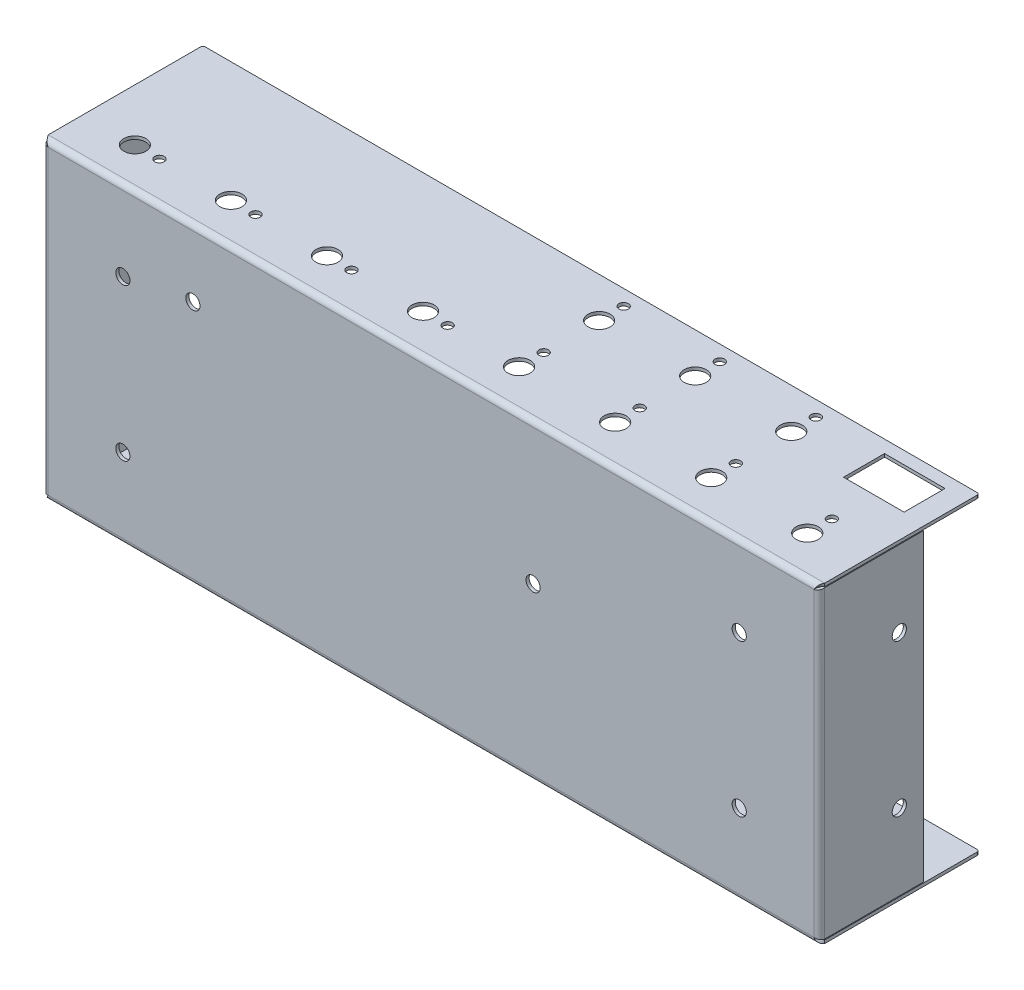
ISO-10303-21;
HEADER;
FILE_DESCRIPTION(('STEP AP214'),'2;1');
FILE_NAME('part.step','',(''),(''),'','','');
FILE_SCHEMA(('AUTOMOTIVE_DESIGN { 1 0 10303 214 1 1 1 1 }'));
ENDSEC;
DATA;
#1=APPLICATION_CONTEXT('core data for automotive mechanical design processes');
#2=APPLICATION_PROTOCOL_DEFINITION('international standard','automotive_design',2000,#1);
#3=PRODUCT_CONTEXT('',#1,'mechanical');
#4=PRODUCT('Part','Part','',(#3));
#5=PRODUCT_RELATED_PRODUCT_CATEGORY('part','',(#4));
#6=PRODUCT_DEFINITION_FORMATION('','',#4);
#7=PRODUCT_DEFINITION_CONTEXT('part definition',#1,'design');
#8=PRODUCT_DEFINITION('design','',#6,#7);
#9=PRODUCT_DEFINITION_SHAPE('','',#8);
#10=(LENGTH_UNIT() NAMED_UNIT(*) SI_UNIT(.MILLI.,.METRE.));
#11=(NAMED_UNIT(*) PLANE_ANGLE_UNIT() SI_UNIT($,.RADIAN.));
#12=(NAMED_UNIT(*) SI_UNIT($,.STERADIAN.) SOLID_ANGLE_UNIT());
#13=UNCERTAINTY_MEASURE_WITH_UNIT(LENGTH_MEASURE(1.E-05),#10,'distance_accuracy_value','');
#14=(GEOMETRIC_REPRESENTATION_CONTEXT(3) GLOBAL_UNCERTAINTY_ASSIGNED_CONTEXT((#13)) GLOBAL_UNIT_ASSIGNED_CONTEXT((#10,
#11,#12)) REPRESENTATION_CONTEXT('',''));
#15=CARTESIAN_POINT('',(0.,0.,0.));
#16=DIRECTION('',(0.,0.,1.));
#17=DIRECTION('',(1.,0.,0.));
#18=AXIS2_PLACEMENT_3D('',#15,#16,#17);
#19=CARTESIAN_POINT('',(0.,-99.0599999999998,-0.990599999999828));
#20=DIRECTION('',(0.,0.,1.));
#21=DIRECTION('',(1.,0.,0.));
#22=AXIS2_PLACEMENT_3D('',#19,#20,#21);
#23=PLANE('',#22);
#24=CARTESIAN_POINT('',(220.98,-73.6599999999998,-0.990599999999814));
#25=DIRECTION('',(0.,0.,1.));
#26=DIRECTION('',(1.,0.,0.));
#27=AXIS2_PLACEMENT_3D('',#24,#25,#26);
#28=CIRCLE('',#27,2.25043999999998);
#29=CARTESIAN_POINT('',(223.23044,-73.6599999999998,-0.990599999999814));
#30=VERTEX_POINT('',#29);
#31=EDGE_CURVE('E1407',#30,#30,#28,.F.);
#32=ORIENTED_EDGE('',*,*,#31,.F.);
#33=EDGE_LOOP('',(#32));
#34=FACE_BOUND('',#33,.T.);
#35=CARTESIAN_POINT('',(220.98,-25.3999999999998,-0.990599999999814));
#36=DIRECTION('',(0.,0.,1.));
#37=DIRECTION('',(1.,0.,0.));
#38=AXIS2_PLACEMENT_3D('',#35,#36,#37);
#39=CIRCLE('',#38,2.25043999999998);
#40=CARTESIAN_POINT('',(223.23044,-25.3999999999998,-0.990599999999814));
#41=VERTEX_POINT('',#40);
#42=EDGE_CURVE('E1401',#41,#41,#39,.F.);
#43=ORIENTED_EDGE('',*,*,#42,.F.);
#44=EDGE_LOOP('',(#43));
#45=FACE_BOUND('',#44,.T.);
#46=CARTESIAN_POINT('',(155.575,-44.7293999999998,-0.9905999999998));
#47=DIRECTION('',(0.,0.,1.));
#48=DIRECTION('',(1.,0.,0.));
#49=AXIS2_PLACEMENT_3D('',#46,#47,#48);
#50=CIRCLE('',#49,2.25043999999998);
#51=CARTESIAN_POINT('',(157.82544,-44.7293999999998,-0.9905999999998));
#52=VERTEX_POINT('',#51);
#53=EDGE_CURVE('E1395',#52,#52,#50,.F.);
#54=ORIENTED_EDGE('',*,*,#53,.F.);
#55=EDGE_LOOP('',(#54));
#56=FACE_BOUND('',#55,.T.);
#57=CARTESIAN_POINT('',(47.625,-21.2343999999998,-0.990599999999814));
#58=DIRECTION('',(0.,0.,1.));
#59=DIRECTION('',(1.,0.,0.));
#60=AXIS2_PLACEMENT_3D('',#57,#58,#59);
#61=CIRCLE('',#60,2.25044);
#62=CARTESIAN_POINT('',(49.87544,-21.2343999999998,-0.990599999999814));
#63=VERTEX_POINT('',#62);
#64=EDGE_CURVE('E1389',#63,#63,#61,.F.);
#65=ORIENTED_EDGE('',*,*,#64,.F.);
#66=EDGE_LOOP('',(#65));
#67=FACE_BOUND('',#66,.T.);
#68=CARTESIAN_POINT('',(25.4,-73.6599999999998,-0.990599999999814));
#69=DIRECTION('',(0.,0.,1.));
#70=DIRECTION('',(1.,0.,0.));
#71=AXIS2_PLACEMENT_3D('',#68,#69,#70);
#72=CIRCLE('',#71,2.25044);
#73=CARTESIAN_POINT('',(27.65044,-73.6599999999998,-0.990599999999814));
#74=VERTEX_POINT('',#73);
#75=EDGE_CURVE('E1383',#74,#74,#72,.F.);
#76=ORIENTED_EDGE('',*,*,#75,.F.);
#77=EDGE_LOOP('',(#76));
#78=FACE_BOUND('',#77,.T.);
#79=CARTESIAN_POINT('',(25.4,-25.3999999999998,-0.990599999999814));
#80=DIRECTION('',(0.,0.,1.));
#81=DIRECTION('',(1.,0.,0.));
#82=AXIS2_PLACEMENT_3D('',#79,#80,#81);
#83=CIRCLE('',#82,2.25044);
#84=CARTESIAN_POINT('',(27.65044,-25.3999999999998,-0.990599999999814));
#85=VERTEX_POINT('',#84);
#86=EDGE_CURVE('E1259',#85,#85,#83,.F.);
#87=ORIENTED_EDGE('',*,*,#86,.F.);
#88=EDGE_LOOP('',(#87));
#89=FACE_BOUND('',#88,.T.);
#90=DIRECTION('',(0.,1.,0.));
#91=VECTOR('',#90,1.);
#92=CARTESIAN_POINT('',(244.6528,-97.3327999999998,-0.990599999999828));
#93=LINE('',#92,#91);
#94=CARTESIAN_POINT('',(244.6528,-97.3327999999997,-0.990599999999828));
#95=VERTEX_POINT('',#94);
#96=CARTESIAN_POINT('',(244.6528,-1.72719999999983,-0.990599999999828));
#97=VERTEX_POINT('',#96);
#98=EDGE_CURVE('E811',#95,#97,#93,.T.);
#99=ORIENTED_EDGE('',*,*,#98,.F.);
#100=DIRECTION('',(1.,0.,0.));
#101=VECTOR('',#100,1.);
#102=CARTESIAN_POINT('',(0.,-97.3327999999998,-0.990599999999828));
#103=LINE('',#102,#101);
#104=CARTESIAN_POINT('',(1.72719999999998,-97.3327999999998,-0.990599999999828));
#105=VERTEX_POINT('',#104);
#106=EDGE_CURVE('E812',#105,#95,#103,.T.);
#107=ORIENTED_EDGE('',*,*,#106,.F.);
#108=DIRECTION('',(0.,-1.,0.));
#109=VECTOR('',#108,1.);
#110=CARTESIAN_POINT('',(1.72719999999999,-1.72719999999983,-0.990599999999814));
#111=LINE('',#110,#109);
#112=CARTESIAN_POINT('',(1.72719999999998,-1.72720000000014,-0.990600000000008));
#113=VERTEX_POINT('',#112);
#114=EDGE_CURVE('E1255',#113,#105,#111,.T.);
#115=ORIENTED_EDGE('',*,*,#114,.F.);
#116=DIRECTION('',(-1.,0.,0.));
#117=VECTOR('',#116,1.);
#118=CARTESIAN_POINT('',(246.38,-1.72719999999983,-0.990599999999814));
#119=LINE('',#118,#117);
#120=EDGE_CURVE('E1234',#97,#113,#119,.T.);
#121=ORIENTED_EDGE('',*,*,#120,.F.);
#122=EDGE_LOOP('',(#99,#107,#115,#121));
#123=FACE_BOUND('',#122,.T.);
#124=ADVANCED_FACE('F251',(#34,#45,#56,#67,#78,#89,#123),#23,.F.);
#125=CARTESIAN_POINT('',(0.,-99.0599999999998,1.80411241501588E-13));
#126=DIRECTION('',(0.,0.,1.));
#127=DIRECTION('',(1.,0.,0.));
#128=AXIS2_PLACEMENT_3D('',#125,#126,#127);
#129=PLANE('',#128);
#130=CARTESIAN_POINT('',(220.98,-73.6599999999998,1.80411241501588E-13));
#131=DIRECTION('',(0.,0.,1.));
#132=DIRECTION('',(1.,0.,0.));
#133=AXIS2_PLACEMENT_3D('',#130,#131,#132);
#134=CIRCLE('',#133,2.25043999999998);
#135=CARTESIAN_POINT('',(223.23044,-73.6599999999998,1.80411241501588E-13));
#136=VERTEX_POINT('',#135);
#137=EDGE_CURVE('E1187',#136,#136,#134,.T.);
#138=ORIENTED_EDGE('',*,*,#137,.F.);
#139=EDGE_LOOP('',(#138));
#140=FACE_BOUND('',#139,.T.);
#141=CARTESIAN_POINT('',(220.98,-25.3999999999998,1.80411241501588E-13));
#142=DIRECTION('',(0.,0.,1.));
#143=DIRECTION('',(1.,0.,0.));
#144=AXIS2_PLACEMENT_3D('',#141,#142,#143);
#145=CIRCLE('',#144,2.25043999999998);
#146=CARTESIAN_POINT('',(223.23044,-25.3999999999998,1.80411241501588E-13));
#147=VERTEX_POINT('',#146);
#148=EDGE_CURVE('E1404',#147,#147,#145,.T.);
#149=ORIENTED_EDGE('',*,*,#148,.F.);
#150=EDGE_LOOP('',(#149));
#151=FACE_BOUND('',#150,.T.);
#152=CARTESIAN_POINT('',(155.575,-44.7293999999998,2.08166817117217E-13));
#153=DIRECTION('',(0.,0.,1.));
#154=DIRECTION('',(1.,0.,0.));
#155=AXIS2_PLACEMENT_3D('',#152,#153,#154);
#156=CIRCLE('',#155,2.25043999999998);
#157=CARTESIAN_POINT('',(157.82544,-44.7293999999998,2.08166817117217E-13));
#158=VERTEX_POINT('',#157);
#159=EDGE_CURVE('E1398',#158,#158,#156,.T.);
#160=ORIENTED_EDGE('',*,*,#159,.F.);
#161=EDGE_LOOP('',(#160));
#162=FACE_BOUND('',#161,.T.);
#163=CARTESIAN_POINT('',(47.625,-21.2343999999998,1.80411241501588E-13));
#164=DIRECTION('',(0.,0.,1.));
#165=DIRECTION('',(1.,0.,0.));
#166=AXIS2_PLACEMENT_3D('',#163,#164,#165);
#167=CIRCLE('',#166,2.25044);
#168=CARTESIAN_POINT('',(49.87544,-21.2343999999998,1.80411241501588E-13));
#169=VERTEX_POINT('',#168);
#170=EDGE_CURVE('E1392',#169,#169,#167,.T.);
#171=ORIENTED_EDGE('',*,*,#170,.F.);
#172=EDGE_LOOP('',(#171));
#173=FACE_BOUND('',#172,.T.);
#174=CARTESIAN_POINT('',(25.4,-73.6599999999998,1.80411241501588E-13));
#175=DIRECTION('',(0.,0.,1.));
#176=DIRECTION('',(1.,0.,0.));
#177=AXIS2_PLACEMENT_3D('',#174,#175,#176);
#178=CIRCLE('',#177,2.25044);
#179=CARTESIAN_POINT('',(27.65044,-73.6599999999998,1.80411241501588E-13));
#180=VERTEX_POINT('',#179);
#181=EDGE_CURVE('E1386',#180,#180,#178,.T.);
#182=ORIENTED_EDGE('',*,*,#181,.F.);
#183=EDGE_LOOP('',(#182));
#184=FACE_BOUND('',#183,.T.);
#185=CARTESIAN_POINT('',(25.4,-25.3999999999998,1.80411241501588E-13));
#186=DIRECTION('',(0.,0.,1.));
#187=DIRECTION('',(1.,0.,0.));
#188=AXIS2_PLACEMENT_3D('',#185,#186,#187);
#189=CIRCLE('',#188,2.25044);
#190=CARTESIAN_POINT('',(27.65044,-25.3999999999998,1.80411241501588E-13));
#191=VERTEX_POINT('',#190);
#192=EDGE_CURVE('E1380',#191,#191,#189,.T.);
#193=ORIENTED_EDGE('',*,*,#192,.F.);
#194=EDGE_LOOP('',(#193));
#195=FACE_BOUND('',#194,.T.);
#196=DIRECTION('',(1.,0.,0.));
#197=VECTOR('',#196,1.);
#198=CARTESIAN_POINT('',(0.,-97.3327999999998,1.80411241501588E-13));
#199=LINE('',#198,#197);
#200=CARTESIAN_POINT('',(1.72719999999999,-97.3327999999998,1.66533453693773E-13));
#201=VERTEX_POINT('',#200);
#202=CARTESIAN_POINT('',(244.6528,-97.3327999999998,1.94289029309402E-13));
#203=VERTEX_POINT('',#202);
#204=EDGE_CURVE('E269',#201,#203,#199,.T.);
#205=ORIENTED_EDGE('',*,*,#204,.T.);
#206=DIRECTION('',(0.,1.,0.));
#207=VECTOR('',#206,1.);
#208=CARTESIAN_POINT('',(244.6528,-97.3327999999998,1.66533453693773E-13));
#209=LINE('',#208,#207);
#210=CARTESIAN_POINT('',(244.6528,-1.72719999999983,1.80411241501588E-13));
#211=VERTEX_POINT('',#210);
#212=EDGE_CURVE('E262',#203,#211,#209,.T.);
#213=ORIENTED_EDGE('',*,*,#212,.T.);
#214=DIRECTION('',(-1.,0.,0.));
#215=VECTOR('',#214,1.);
#216=CARTESIAN_POINT('',(246.38,-1.72719999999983,1.80411241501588E-13));
#217=LINE('',#216,#215);
#218=CARTESIAN_POINT('',(1.72719999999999,-1.72719999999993,1.66533453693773E-13));
#219=VERTEX_POINT('',#218);
#220=EDGE_CURVE('E959',#211,#219,#217,.T.);
#221=ORIENTED_EDGE('',*,*,#220,.T.);
#222=DIRECTION('',(0.,-1.,0.));
#223=VECTOR('',#222,1.);
#224=CARTESIAN_POINT('',(1.72719999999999,-1.72719999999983,1.94289029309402E-13));
#225=LINE('',#224,#223);
#226=EDGE_CURVE('E1238',#219,#201,#225,.T.);
#227=ORIENTED_EDGE('',*,*,#226,.T.);
#228=EDGE_LOOP('',(#205,#213,#221,#227));
#229=FACE_BOUND('',#228,.T.);
#230=ADVANCED_FACE('F253',(#140,#151,#162,#173,#184,#195,#229),#129,.T.);
#231=CARTESIAN_POINT('',(25.4,-25.3999999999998,-7.35580553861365));
#232=DIRECTION('',(0.,0.,1.));
#233=DIRECTION('',(1.,0.,0.));
#234=AXIS2_PLACEMENT_3D('',#231,#232,#233);
#235=CYLINDRICAL_SURFACE('',#234,2.25044);
#236=ORIENTED_EDGE('',*,*,#86,.T.);
#237=EDGE_LOOP('',(#236));
#238=FACE_BOUND('',#237,.T.);
#239=ORIENTED_EDGE('',*,*,#192,.T.);
#240=EDGE_LOOP('',(#239));
#241=FACE_BOUND('',#240,.T.);
#242=ADVANCED_FACE('F736',(#238,#241),#235,.F.);
#243=CARTESIAN_POINT('',(25.4,-73.6599999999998,-7.35580553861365));
#244=DIRECTION('',(0.,0.,1.));
#245=DIRECTION('',(1.,0.,0.));
#246=AXIS2_PLACEMENT_3D('',#243,#244,#245);
#247=CYLINDRICAL_SURFACE('',#246,2.25044);
#248=ORIENTED_EDGE('',*,*,#75,.T.);
#249=EDGE_LOOP('',(#248));
#250=FACE_BOUND('',#249,.T.);
#251=ORIENTED_EDGE('',*,*,#181,.T.);
#252=EDGE_LOOP('',(#251));
#253=FACE_BOUND('',#252,.T.);
#254=ADVANCED_FACE('F743',(#250,#253),#247,.F.);
#255=CARTESIAN_POINT('',(47.625,-21.2343999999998,-7.35580553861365));
#256=DIRECTION('',(0.,0.,1.));
#257=DIRECTION('',(1.,0.,0.));
#258=AXIS2_PLACEMENT_3D('',#255,#256,#257);
#259=CYLINDRICAL_SURFACE('',#258,2.25044);
#260=ORIENTED_EDGE('',*,*,#64,.T.);
#261=EDGE_LOOP('',(#260));
#262=FACE_BOUND('',#261,.T.);
#263=ORIENTED_EDGE('',*,*,#170,.T.);
#264=EDGE_LOOP('',(#263));
#265=FACE_BOUND('',#264,.T.);
#266=ADVANCED_FACE('F747',(#262,#265),#259,.F.);
#267=CARTESIAN_POINT('',(155.575,-44.7293999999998,-7.35580553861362));
#268=DIRECTION('',(0.,0.,1.));
#269=DIRECTION('',(1.,0.,0.));
#270=AXIS2_PLACEMENT_3D('',#267,#268,#269);
#271=CYLINDRICAL_SURFACE('',#270,2.25043999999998);
#272=ORIENTED_EDGE('',*,*,#53,.T.);
#273=EDGE_LOOP('',(#272));
#274=FACE_BOUND('',#273,.T.);
#275=ORIENTED_EDGE('',*,*,#159,.T.);
#276=EDGE_LOOP('',(#275));
#277=FACE_BOUND('',#276,.T.);
#278=ADVANCED_FACE('F751',(#274,#277),#271,.F.);
#279=CARTESIAN_POINT('',(220.98,-25.3999999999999,-7.35580553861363));
#280=DIRECTION('',(0.,0.,1.));
#281=DIRECTION('',(1.,0.,0.));
#282=AXIS2_PLACEMENT_3D('',#279,#280,#281);
#283=CYLINDRICAL_SURFACE('',#282,2.25043999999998);
#284=ORIENTED_EDGE('',*,*,#42,.T.);
#285=EDGE_LOOP('',(#284));
#286=FACE_BOUND('',#285,.T.);
#287=ORIENTED_EDGE('',*,*,#148,.T.);
#288=EDGE_LOOP('',(#287));
#289=FACE_BOUND('',#288,.T.);
#290=ADVANCED_FACE('F755',(#286,#289),#283,.F.);
#291=CARTESIAN_POINT('',(220.98,-73.6599999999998,-7.35580553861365));
#292=DIRECTION('',(0.,0.,1.));
#293=DIRECTION('',(1.,0.,0.));
#294=AXIS2_PLACEMENT_3D('',#291,#292,#293);
#295=CYLINDRICAL_SURFACE('',#294,2.25043999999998);
#296=ORIENTED_EDGE('',*,*,#31,.T.);
#297=EDGE_LOOP('',(#296));
#298=FACE_BOUND('',#297,.T.);
#299=ORIENTED_EDGE('',*,*,#137,.T.);
#300=EDGE_LOOP('',(#299));
#301=FACE_BOUND('',#300,.T.);
#302=ADVANCED_FACE('F759',(#298,#301),#295,.F.);
#303=CARTESIAN_POINT('',(-0.010005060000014,-1.24459999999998,-1.72719999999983));
#304=CARTESIAN_POINT('',(-0.010005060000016,-1.28482370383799,-1.49976062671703));
#305=CARTESIAN_POINT('',(0.0352097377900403,-1.32503333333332,-1.27249025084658));
#306=CARTESIAN_POINT('',(0.209253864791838,-1.40546666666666,-0.852310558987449));
#307=CARTESIAN_POINT('',(0.338014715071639,-1.44568333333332,-0.659606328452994));
#308=CARTESIAN_POINT('',(0.659606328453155,-1.52611666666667,-0.338014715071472));
#309=CARTESIAN_POINT('',(0.852310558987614,-1.56633333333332,-0.209253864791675));
#310=CARTESIAN_POINT('',(1.27249025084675,-1.64676666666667,-0.0352097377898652));
#311=CARTESIAN_POINT('',(1.49976062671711,-1.68697629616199,0.0100050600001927));
#312=CARTESIAN_POINT('',(1.72719999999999,-1.72720000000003,0.0100050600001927));
#313=CARTESIAN_POINT('',(0.,-1.24459999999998,-1.72719999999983));
#314=CARTESIAN_POINT('',(0.,-1.2848236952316,-1.50107053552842));
#315=CARTESIAN_POINT('',(0.0449543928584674,-1.32503333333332,-1.27510905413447));
#316=CARTESIAN_POINT('',(0.217996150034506,-1.40546666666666,-0.857349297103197));
#317=CARTESIAN_POINT('',(0.346015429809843,-1.44568333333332,-0.66575490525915));
#318=CARTESIAN_POINT('',(0.665754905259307,-1.52611666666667,-0.346015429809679));
#319=CARTESIAN_POINT('',(0.857349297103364,-1.56633333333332,-0.217996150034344));
#320=CARTESIAN_POINT('',(1.27510905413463,-1.64676666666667,-0.0449543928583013));
#321=CARTESIAN_POINT('',(1.50107053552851,-1.68697630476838,1.94289029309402E-13));
#322=CARTESIAN_POINT('',(1.72719999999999,-1.72720000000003,1.94289029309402E-13));
#323=CARTESIAN_POINT('',(0.990599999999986,-1.24459999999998,-1.72719999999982));
#324=CARTESIAN_POINT('',(0.990599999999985,-1.28482284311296,-1.6307644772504));
#325=CARTESIAN_POINT('',(1.0097717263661,-1.32503333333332,-1.53439650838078));
#326=CARTESIAN_POINT('',(1.08356894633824,-1.40546666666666,-1.35623425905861));
#327=CARTESIAN_POINT('',(1.13816540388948,-1.44568333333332,-1.27452488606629));
#328=CARTESIAN_POINT('',(1.27452488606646,-1.52611666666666,-1.13816540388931));
#329=CARTESIAN_POINT('',(1.35623425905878,-1.56633333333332,-1.08356894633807));
#330=CARTESIAN_POINT('',(1.53439650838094,-1.64676666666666,-1.00977172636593));
#331=CARTESIAN_POINT('',(1.63076447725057,-1.68697715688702,-0.990599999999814));
#332=CARTESIAN_POINT('',(1.72719999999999,-1.72720000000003,-0.990599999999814));
#333=CARTESIAN_POINT('',(1.00050599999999,-1.24459999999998,-1.72719999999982));
#334=CARTESIAN_POINT('',(1.00050599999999,-1.28482283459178,-1.63206141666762));
#335=CARTESIAN_POINT('',(1.01941989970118,-1.32503333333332,-1.53698938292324));
#336=CARTESIAN_POINT('',(1.09222467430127,-1.40546666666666,-1.36122310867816));
#337=CARTESIAN_POINT('',(1.14608690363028,-1.44568333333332,-1.28061258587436));
#338=CARTESIAN_POINT('',(1.28061258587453,-1.52611666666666,-1.14608690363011));
#339=CARTESIAN_POINT('',(1.36122310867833,-1.56633333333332,-1.0922246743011));
#340=CARTESIAN_POINT('',(1.5369893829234,-1.64676666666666,-1.019419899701));
#341=CARTESIAN_POINT('',(1.63206141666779,-1.68697716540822,-1.00050599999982));
#342=CARTESIAN_POINT('',(1.72719999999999,-1.72720000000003,-1.00050599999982));
#343=B_SPLINE_SURFACE_WITH_KNOTS('',1,3,((#303,#304,#305,#306,#307,#308,#309,#310,#311,#312),
(#313,#314,#315,#316,#317,#318,#319,#320,#321,#322),(#323,#324,#325,#326,#327,#328,#329,#330,
#331,#332),(#333,#334,#335,#336,#337,#338,#339,#340,#341,#342)),.UNSPECIFIED.,.F.,.F.,.F.,(2,1,
1,2),(4,2,2,2,4),(-0.0101,0.,1.,1.01),(0.,0.25,0.5,0.75,1.),.UNSPECIFIED.);
#344=CARTESIAN_POINT('',(1.00050599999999,-1.24459999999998,-1.72719999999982));
#345=CARTESIAN_POINT('',(0.990599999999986,-1.24459999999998,-1.72719999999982));
#346=CARTESIAN_POINT('',(0.,-1.24459999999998,-1.72719999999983));
#347=CARTESIAN_POINT('',(-0.010005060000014,-1.24459999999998,-1.72719999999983));
#348=B_SPLINE_CURVE_WITH_KNOTS('',1,(#344,#345,#346,#347),.UNSPECIFIED.,.F.,.F.,(2,1,1,2),
(-0.0101,-9.9999999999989E-05,0.9999,1.01),.UNSPECIFIED.);
#349=CARTESIAN_POINT('',(0.,-1.24459999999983,-1.72719999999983));
#350=VERTEX_POINT('',#349);
#351=CARTESIAN_POINT('',(0.990599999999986,-1.24459999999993,-1.72719999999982));
#352=VERTEX_POINT('',#351);
#353=EDGE_CURVE('E1463',#350,#352,#348,.F.);
#354=CARTESIAN_POINT('',(0.,-1.24459999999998,-1.72719999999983));
#355=CARTESIAN_POINT('',(-5.99491746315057E-07,-1.2496270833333,-1.69893872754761));
#356=CARTESIAN_POINT('',(0.000693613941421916,-1.25465416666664,-1.67067750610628));
#357=CARTESIAN_POINT('',(0.00346736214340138,-1.26470833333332,-1.61422311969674));
#358=CARTESIAN_POINT('',(0.00554689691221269,-1.26973541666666,-1.58602995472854));
#359=CARTESIAN_POINT('',(0.0110869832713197,-1.27978958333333,-1.52977963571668));
#360=CARTESIAN_POINT('',(0.0145475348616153,-1.28481666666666,-1.50172248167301));
#361=CARTESIAN_POINT('',(0.0228411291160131,-1.29487083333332,-1.44581176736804));
#362=CARTESIAN_POINT('',(0.0276741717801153,-1.29989791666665,-1.41795820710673));
#363=CARTESIAN_POINT('',(0.0387011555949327,-1.30995208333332,-1.3625217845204));
#364=CARTESIAN_POINT('',(0.044895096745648,-1.31497916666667,-1.33493892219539));
#365=CARTESIAN_POINT('',(0.0586289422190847,-1.32503333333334,-1.28011034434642));
#366=CARTESIAN_POINT('',(0.066168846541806,-1.33006041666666,-1.25286462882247));
#367=CARTESIAN_POINT('',(0.0825764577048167,-1.34011458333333,-1.19877598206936));
#368=CARTESIAN_POINT('',(0.0914441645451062,-1.34514166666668,-1.17193305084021));
#369=CARTESIAN_POINT('',(0.11048601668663,-1.35519583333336,-1.11871463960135));
#370=CARTESIAN_POINT('',(0.120660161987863,-1.36022291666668,-1.09233915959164));
#371=CARTESIAN_POINT('',(0.142290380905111,-1.37027708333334,-1.04011919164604));
#372=CARTESIAN_POINT('',(0.153746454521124,-1.37530416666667,-1.01427470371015));
#373=CARTESIAN_POINT('',(0.177912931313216,-1.38535833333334,-0.96317898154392));
#374=CARTESIAN_POINT('',(0.190623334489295,-1.39038541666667,-0.937927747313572));
#375=CARTESIAN_POINT('',(0.217267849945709,-1.40043958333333,-0.888079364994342));
#376=CARTESIAN_POINT('',(0.231201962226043,-1.40546666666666,-0.863482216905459));
#377=CARTESIAN_POINT('',(0.260260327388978,-1.41552083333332,-0.815001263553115));
#378=CARTESIAN_POINT('',(0.275384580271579,-1.42054791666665,-0.791117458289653));
#379=CARTESIAN_POINT('',(0.30678679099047,-1.43060208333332,-0.74412072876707));
#380=CARTESIAN_POINT('',(0.323064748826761,-1.43562916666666,-0.721007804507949));
#381=CARTESIAN_POINT('',(0.356735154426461,-1.44568333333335,-0.675608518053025));
#382=CARTESIAN_POINT('',(0.374127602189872,-1.45071041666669,-0.653322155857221));
#383=CARTESIAN_POINT('',(0.40998508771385,-1.46076458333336,-0.609629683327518));
#384=CARTESIAN_POINT('',(0.428450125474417,-1.46579166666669,-0.588223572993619));
#385=CARTESIAN_POINT('',(0.466408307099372,-1.47584583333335,-0.546343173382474));
#386=CARTESIAN_POINT('',(0.485901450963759,-1.48087291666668,-0.525868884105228));
#387=CARTESIAN_POINT('',(0.525868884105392,-1.49092708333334,-0.485901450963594));
#388=CARTESIAN_POINT('',(0.546343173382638,-1.49595416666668,-0.466408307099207));
#389=CARTESIAN_POINT('',(0.588223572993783,-1.50600833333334,-0.428450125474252));
#390=CARTESIAN_POINT('',(0.609629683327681,-1.51103541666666,-0.409985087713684));
#391=CARTESIAN_POINT('',(0.653322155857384,-1.52108958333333,-0.374127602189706));
#392=CARTESIAN_POINT('',(0.675608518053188,-1.52611666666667,-0.356735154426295));
#393=CARTESIAN_POINT('',(0.721007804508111,-1.53617083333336,-0.323064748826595));
#394=CARTESIAN_POINT('',(0.744120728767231,-1.54119791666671,-0.306786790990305));
#395=CARTESIAN_POINT('',(0.791117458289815,-1.55125208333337,-0.275384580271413));
#396=CARTESIAN_POINT('',(0.815001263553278,-1.55627916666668,-0.26026032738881));
#397=CARTESIAN_POINT('',(0.863482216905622,-1.56633333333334,-0.231201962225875));
#398=CARTESIAN_POINT('',(0.888079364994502,-1.57136041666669,-0.217267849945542));
#399=CARTESIAN_POINT('',(0.937927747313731,-1.58141458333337,-0.190623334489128));
#400=CARTESIAN_POINT('',(0.96317898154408,-1.58644166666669,-0.177912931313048));
#401=CARTESIAN_POINT('',(1.01427470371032,-1.59649583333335,-0.153746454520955));
#402=CARTESIAN_POINT('',(1.0401191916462,-1.60152291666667,-0.142290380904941));
#403=CARTESIAN_POINT('',(1.0923391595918,-1.61157708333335,-0.120660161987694));
#404=CARTESIAN_POINT('',(1.11871463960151,-1.6166041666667,-0.11048601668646));
#405=CARTESIAN_POINT('',(1.17193305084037,-1.62665833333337,-0.0914441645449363));
#406=CARTESIAN_POINT('',(1.19877598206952,-1.63168541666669,-0.0825764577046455));
#407=CARTESIAN_POINT('',(1.25286462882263,-1.64173958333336,-0.066168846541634));
#408=CARTESIAN_POINT('',(1.28011034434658,-1.64676666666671,-0.0586289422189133));
#409=CARTESIAN_POINT('',(1.33493892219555,-1.65682083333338,-0.0448950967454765));
#410=CARTESIAN_POINT('',(1.36252178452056,-1.66184791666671,-0.0387011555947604));
#411=CARTESIAN_POINT('',(1.41795820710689,-1.67190208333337,-0.0276741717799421));
#412=CARTESIAN_POINT('',(1.4458117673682,-1.6769291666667,-0.0228411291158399));
#413=CARTESIAN_POINT('',(1.50172248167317,-1.68698333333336,-0.014547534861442));
#414=CARTESIAN_POINT('',(1.52977963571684,-1.69201041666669,-0.0110869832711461));
#415=CARTESIAN_POINT('',(1.5860299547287,-1.70206458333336,-0.00554689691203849));
#416=CARTESIAN_POINT('',(1.6142231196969,-1.70709166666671,-0.0034673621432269));
#417=CARTESIAN_POINT('',(1.67067750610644,-1.71714583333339,-0.000693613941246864));
#418=CARTESIAN_POINT('',(1.69893872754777,-1.72217291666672,5.99491921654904E-07));
#419=CARTESIAN_POINT('',(1.72719999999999,-1.72720000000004,1.89518539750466E-13));
#420=B_SPLINE_CURVE_WITH_KNOTS('',3,(#354,#355,#356,#357,#358,#359,#360,#361,#362,#363,#364,
#365,#366,#367,#368,#369,#370,#371,#372,#373,#374,#375,#376,#377,#378,#379,#380,#381,#382,#383,
#384,#385,#386,#387,#388,#389,#390,#391,#392,#393,#394,#395,#396,#397,#398,#399,#400,#401,#402,
#403,#404,#405,#406,#407,#408,#409,#410,#411,#412,#413,#414,#415,#416,#417,#418,#419),
.UNSPECIFIED.,.F.,.F.,(4,2,2,2,2,2,2,2,2,2,2,2,2,2,2,2,2,2,2,2,2,2,2,2,2,2,2,2,2,2,2,2,4),(0.,
0.0861062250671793,0.172212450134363,0.258318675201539,0.344424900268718,0.430531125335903,
0.51663735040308,0.602743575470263,0.688849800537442,0.774956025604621,0.861062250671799,
0.947168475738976,1.03327470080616,1.11938092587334,1.20548715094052,1.2915933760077,
1.37769960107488,1.46380582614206,1.54991205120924,1.63601827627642,1.7221245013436,
1.80823072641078,1.89433695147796,1.98044317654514,2.06654940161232,2.1526556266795,
2.23876185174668,2.32486807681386,2.41097430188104,2.49708052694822,2.58318675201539,
2.66929297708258,2.75539920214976),.UNSPECIFIED.);
#421=EDGE_CURVE('E1231',#350,#219,#420,.T.);
#422=CARTESIAN_POINT('',(1.72719999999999,-1.72720000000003,0.0100050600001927));
#423=CARTESIAN_POINT('',(1.72719999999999,-1.72720000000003,1.94289029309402E-13));
#424=CARTESIAN_POINT('',(1.72719999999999,-1.72720000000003,-0.990599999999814));
#425=CARTESIAN_POINT('',(1.72719999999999,-1.72720000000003,-1.00050599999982));
#426=B_SPLINE_CURVE_WITH_KNOTS('',1,(#422,#423,#424,#425),.UNSPECIFIED.,.F.,.F.,(2,1,1,2),
(-0.0101,0.,1.,1.01),.UNSPECIFIED.);
#427=EDGE_CURVE('E1237',#219,#113,#426,.T.);
#428=CARTESIAN_POINT('',(0.990599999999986,-1.24459999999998,-1.72719999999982));
#429=CARTESIAN_POINT('',(0.990599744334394,-1.2496270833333,-1.71514739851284));
#430=CARTESIAN_POINT('',(0.990895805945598,-1.25465416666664,-1.70309481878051));
#431=CARTESIAN_POINT('',(0.992078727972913,-1.26470833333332,-1.67901868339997));
#432=CARTESIAN_POINT('',(0.992965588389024,-1.26973541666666,-1.66699512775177));
#433=CARTESIAN_POINT('',(0.995328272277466,-1.27978958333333,-1.64300602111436));
#434=CARTESIAN_POINT('',(0.996804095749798,-1.28481666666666,-1.63104047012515));
#435=CARTESIAN_POINT('',(1.00034106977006,-1.29487083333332,-1.60719619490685));
#436=CARTESIAN_POINT('',(1.00240222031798,-1.29989791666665,-1.59531747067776));
#437=CARTESIAN_POINT('',(1.00710490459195,-1.30995208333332,-1.57167546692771));
#438=CARTESIAN_POINT('',(1.00974643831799,-1.31497916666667,-1.55991218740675));
#439=CARTESIAN_POINT('',(1.01560351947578,-1.32503333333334,-1.5365294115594));
#440=CARTESIAN_POINT('',(1.01881906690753,-1.33006041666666,-1.524909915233));
#441=CARTESIAN_POINT('',(1.02581643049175,-1.34011458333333,-1.50184269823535));
#442=CARTESIAN_POINT('',(1.02959824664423,-1.34514166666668,-1.4903949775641));
#443=CARTESIAN_POINT('',(1.03771903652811,-1.35519583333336,-1.46769889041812));
#444=CARTESIAN_POINT('',(1.04205801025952,-1.36022291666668,-1.45645052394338));
#445=CARTESIAN_POINT('',(1.05128266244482,-1.37027708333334,-1.434180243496));
#446=CARTESIAN_POINT('',(1.05616834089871,-1.37530416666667,-1.42315832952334));
#447=CARTESIAN_POINT('',(1.0664746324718,-1.38535833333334,-1.4013675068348));
#448=CARTESIAN_POINT('',(1.07189524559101,-1.39038541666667,-1.39059859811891));
#449=CARTESIAN_POINT('',(1.08325834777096,-1.40043958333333,-1.36933972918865));
#450=CARTESIAN_POINT('',(1.08920083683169,-1.40546666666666,-1.35884976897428));
#451=CARTESIAN_POINT('',(1.10159337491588,-1.41552083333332,-1.3381740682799));
#452=CARTESIAN_POINT('',(1.10804342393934,-1.42054791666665,-1.32798832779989));
#453=CARTESIAN_POINT('',(1.12143554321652,-1.43060208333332,-1.30794560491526));
#454=CARTESIAN_POINT('',(1.12837761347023,-1.43562916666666,-1.29808862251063));
#455=CARTESIAN_POINT('',(1.14273705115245,-1.44568333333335,-1.27872716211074));
#456=CARTESIAN_POINT('',(1.15015441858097,-1.45071041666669,-1.26922268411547));
#457=CARTESIAN_POINT('',(1.16544658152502,-1.46076458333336,-1.25058912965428));
#458=CARTESIAN_POINT('',(1.17332137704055,-1.46579166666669,-1.24146005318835));
#459=CARTESIAN_POINT('',(1.18950942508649,-1.47584583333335,-1.22359929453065));
#460=CARTESIAN_POINT('',(1.19782267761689,-1.48087291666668,-1.21486761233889));
#461=CARTESIAN_POINT('',(1.21486761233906,-1.49092708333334,-1.19782267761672));
#462=CARTESIAN_POINT('',(1.22359929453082,-1.49595416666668,-1.18950942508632));
#463=CARTESIAN_POINT('',(1.24146005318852,-1.50600833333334,-1.17332137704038));
#464=CARTESIAN_POINT('',(1.25058912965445,-1.51103541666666,-1.16544658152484));
#465=CARTESIAN_POINT('',(1.26922268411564,-1.52108958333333,-1.15015441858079));
#466=CARTESIAN_POINT('',(1.27872716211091,-1.52611666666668,-1.14273705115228));
#467=CARTESIAN_POINT('',(1.2980886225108,-1.53617083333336,-1.12837761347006));
#468=CARTESIAN_POINT('',(1.30794560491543,-1.54119791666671,-1.12143554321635));
#469=CARTESIAN_POINT('',(1.32798832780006,-1.55125208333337,-1.10804342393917));
#470=CARTESIAN_POINT('',(1.33817406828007,-1.55627916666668,-1.10159337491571));
#471=CARTESIAN_POINT('',(1.35884976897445,-1.56633333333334,-1.08920083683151));
#472=CARTESIAN_POINT('',(1.36933972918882,-1.57136041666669,-1.08325834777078));
#473=CARTESIAN_POINT('',(1.39059859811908,-1.58141458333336,-1.07189524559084));
#474=CARTESIAN_POINT('',(1.40136750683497,-1.58644166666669,-1.06647463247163));
#475=CARTESIAN_POINT('',(1.42315832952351,-1.59649583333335,-1.05616834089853));
#476=CARTESIAN_POINT('',(1.43418024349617,-1.60152291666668,-1.05128266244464));
#477=CARTESIAN_POINT('',(1.45645052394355,-1.61157708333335,-1.04205801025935));
#478=CARTESIAN_POINT('',(1.46769889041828,-1.6166041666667,-1.03771903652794));
#479=CARTESIAN_POINT('',(1.49039497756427,-1.62665833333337,-1.02959824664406));
#480=CARTESIAN_POINT('',(1.50184269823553,-1.63168541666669,-1.02581643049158));
#481=CARTESIAN_POINT('',(1.52490991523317,-1.64173958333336,-1.01881906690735));
#482=CARTESIAN_POINT('',(1.53652941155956,-1.64676666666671,-1.0156035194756));
#483=CARTESIAN_POINT('',(1.55991218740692,-1.65682083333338,-1.00974643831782));
#484=CARTESIAN_POINT('',(1.57167546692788,-1.66184791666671,-1.00710490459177));
#485=CARTESIAN_POINT('',(1.59531747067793,-1.67190208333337,-1.00240222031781));
#486=CARTESIAN_POINT('',(1.60719619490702,-1.6769291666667,-1.00034106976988));
#487=CARTESIAN_POINT('',(1.63104047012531,-1.68698333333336,-0.996804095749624));
#488=CARTESIAN_POINT('',(1.64300602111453,-1.69201041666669,-0.995328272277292));
#489=CARTESIAN_POINT('',(1.66699512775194,-1.70206458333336,-0.992965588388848));
#490=CARTESIAN_POINT('',(1.67901868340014,-1.70709166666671,-0.992078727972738));
#491=CARTESIAN_POINT('',(1.70309481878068,-1.71714583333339,-0.990895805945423));
#492=CARTESIAN_POINT('',(1.71514739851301,-1.72217291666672,-0.990599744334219));
#493=CARTESIAN_POINT('',(1.72719999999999,-1.72720000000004,-0.99059999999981));
#494=B_SPLINE_CURVE_WITH_KNOTS('',3,(#428,#429,#430,#431,#432,#433,#434,#435,#436,#437,#438,
#439,#440,#441,#442,#443,#444,#445,#446,#447,#448,#449,#450,#451,#452,#453,#454,#455,#456,#457,
#458,#459,#460,#461,#462,#463,#464,#465,#466,#467,#468,#469,#470,#471,#472,#473,#474,#475,#476,
#477,#478,#479,#480,#481,#482,#483,#484,#485,#486,#487,#488,#489,#490,#491,#492,#493),
.UNSPECIFIED.,.F.,.F.,(4,2,2,2,2,2,2,2,2,2,2,2,2,2,2,2,2,2,2,2,2,2,2,2,2,2,2,2,2,2,2,2,4),(0.,
0.0391735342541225,0.0783470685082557,0.117520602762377,0.1566941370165,0.195867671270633,
0.235041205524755,0.274214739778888,0.31338827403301,0.352561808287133,0.391735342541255,
0.430908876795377,0.470082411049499,0.509255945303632,0.548429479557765,0.587603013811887,
0.62677654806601,0.665950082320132,0.705123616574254,0.744297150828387,0.78347068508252,
0.822644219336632,0.861817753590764,0.900991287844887,0.940164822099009,0.979338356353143,
1.01851189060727,1.0576854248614,1.09685895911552,1.13603249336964,1.17520602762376,
1.2143795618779,1.25355309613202),.UNSPECIFIED.);
#495=EDGE_CURVE('E1188',#352,#113,#494,.T.);
#496=ORIENTED_EDGE('',*,*,#353,.F.);
#497=ORIENTED_EDGE('',*,*,#421,.T.);
#498=ORIENTED_EDGE('',*,*,#427,.T.);
#499=ORIENTED_EDGE('',*,*,#495,.F.);
#500=EDGE_LOOP('',(#496,#497,#498,#499));
#501=FACE_BOUND('',#500,.T.);
#502=ADVANCED_FACE('F763',(#501),#343,.F.);
#503=CARTESIAN_POINT('',(1.72719999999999,-97.3327999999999,0.0099060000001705));
#504=CARTESIAN_POINT('',(1.49977359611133,-97.3730237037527,0.0099060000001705));
#505=CARTESIAN_POINT('',(1.27251617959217,-97.4132333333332,-0.0353062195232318));
#506=CARTESIAN_POINT('',(0.852360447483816,-97.4936666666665,-0.209340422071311));
#507=CARTESIAN_POINT('',(0.659667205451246,-97.5338833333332,-0.338093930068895));
#508=CARTESIAN_POINT('',(0.338093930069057,-97.6143166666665,-0.659667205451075));
#509=CARTESIAN_POINT('',(0.20934042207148,-97.6545333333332,-0.852360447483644));
#510=CARTESIAN_POINT('',(0.0353062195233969,-97.7349666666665,-1.27251617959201));
#511=CARTESIAN_POINT('',(-0.00990600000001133,-97.7751762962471,-1.49977359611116));
#512=CARTESIAN_POINT('',(-0.00990600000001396,-97.8153999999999,-1.72719999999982));
#513=CARTESIAN_POINT('',(1.72719999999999,-97.3327999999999,1.66533453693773E-13));
#514=CARTESIAN_POINT('',(1.50107053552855,-97.3730236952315,1.66533453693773E-13));
#515=CARTESIAN_POINT('',(1.27510905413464,-97.4132333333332,-0.0449543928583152));
#516=CARTESIAN_POINT('',(0.85734929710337,-97.4936666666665,-0.217996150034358));
#517=CARTESIAN_POINT('',(0.665754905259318,-97.5338833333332,-0.346015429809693));
#518=CARTESIAN_POINT('',(0.346015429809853,-97.6143166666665,-0.66575490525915));
#519=CARTESIAN_POINT('',(0.217996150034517,-97.6545333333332,-0.85734929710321));
#520=CARTESIAN_POINT('',(0.0449543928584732,-97.7349666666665,-1.27510905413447));
#521=CARTESIAN_POINT('',(0.,-97.7751763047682,-1.50107053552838));
#522=CARTESIAN_POINT('',(0.,-97.8153999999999,-1.72719999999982));
#523=CARTESIAN_POINT('',(1.72719999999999,-97.3327999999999,-0.990599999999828));
#524=CARTESIAN_POINT('',(1.63076447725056,-97.3730228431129,-0.990599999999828));
#525=CARTESIAN_POINT('',(1.53439650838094,-97.4132333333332,-1.00977172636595));
#526=CARTESIAN_POINT('',(1.35623425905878,-97.4936666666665,-1.08356894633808));
#527=CARTESIAN_POINT('',(1.27452488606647,-97.5338833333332,-1.13816540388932));
#528=CARTESIAN_POINT('',(1.13816540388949,-97.6143166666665,-1.2745248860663));
#529=CARTESIAN_POINT('',(1.08356894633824,-97.6545333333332,-1.35623425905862));
#530=CARTESIAN_POINT('',(1.00977172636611,-97.7349666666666,-1.53439650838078));
#531=CARTESIAN_POINT('',(0.990599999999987,-97.7751771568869,-1.63076447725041));
#532=CARTESIAN_POINT('',(0.990599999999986,-97.8153999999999,-1.72719999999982));
#533=CARTESIAN_POINT('',(1.72719999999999,-97.3327999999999,-1.00060505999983));
#534=CARTESIAN_POINT('',(1.63207438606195,-97.3730228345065,-1.00060505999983));
#535=CARTESIAN_POINT('',(1.53701531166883,-97.4132333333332,-1.01951638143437));
#536=CARTESIAN_POINT('',(1.36127299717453,-97.4936666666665,-1.09231123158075));
#537=CARTESIAN_POINT('',(1.28067346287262,-97.5338833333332,-1.14616611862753));
#538=CARTESIAN_POINT('',(1.14616611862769,-97.6143166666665,-1.28067346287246));
#539=CARTESIAN_POINT('',(1.09231123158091,-97.6545333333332,-1.36127299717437));
#540=CARTESIAN_POINT('',(1.01951638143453,-97.7349666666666,-1.53701531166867));
#541=CARTESIAN_POINT('',(1.00060505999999,-97.7751771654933,-1.6320743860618));
#542=CARTESIAN_POINT('',(1.00060505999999,-97.8153999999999,-1.72719999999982));
#543=B_SPLINE_SURFACE_WITH_KNOTS('',1,3,((#503,#504,#505,#506,#507,#508,#509,#510,#511,#512),
(#513,#514,#515,#516,#517,#518,#519,#520,#521,#522),(#523,#524,#525,#526,#527,#528,#529,#530,
#531,#532),(#533,#534,#535,#536,#537,#538,#539,#540,#541,#542)),.UNSPECIFIED.,.F.,.F.,.F.,(2,1,
1,2),(4,2,2,2,4),(-0.01,0.,1.,1.0101),(0.,0.25,0.5,0.75,1.),.UNSPECIFIED.);
#544=CARTESIAN_POINT('',(1.72719999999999,-97.3327999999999,1.75423911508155E-13));
#545=CARTESIAN_POINT('',(1.69893872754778,-97.3378270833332,5.99491907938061E-07));
#546=CARTESIAN_POINT('',(1.67067750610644,-97.3428541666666,-0.000693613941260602));
#547=CARTESIAN_POINT('',(1.6142231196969,-97.3529083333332,-0.0034673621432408));
#548=CARTESIAN_POINT('',(1.5860299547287,-97.3579354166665,-0.00554689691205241));
#549=CARTESIAN_POINT('',(1.52977963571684,-97.3679895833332,-0.0110869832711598));
#550=CARTESIAN_POINT('',(1.50172248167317,-97.3730166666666,-0.0145475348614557));
#551=CARTESIAN_POINT('',(1.4458117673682,-97.3830708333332,-0.0228411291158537));
#552=CARTESIAN_POINT('',(1.41795820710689,-97.3880979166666,-0.0276741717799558));
#553=CARTESIAN_POINT('',(1.36252178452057,-97.3981520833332,-0.0387011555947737));
#554=CARTESIAN_POINT('',(1.33493892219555,-97.4031791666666,-0.0448950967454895));
#555=CARTESIAN_POINT('',(1.28011034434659,-97.4132333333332,-0.0586289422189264));
#556=CARTESIAN_POINT('',(1.25286462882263,-97.4182604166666,-0.0661688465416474));
#557=CARTESIAN_POINT('',(1.19877598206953,-97.4283145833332,-0.0825764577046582));
#558=CARTESIAN_POINT('',(1.17193305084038,-97.4333416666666,-0.091444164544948));
#559=CARTESIAN_POINT('',(1.11871463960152,-97.4433958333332,-0.110486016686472));
#560=CARTESIAN_POINT('',(1.0923391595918,-97.4484229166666,-0.120660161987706));
#561=CARTESIAN_POINT('',(1.04011919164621,-97.4584770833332,-0.142290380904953));
#562=CARTESIAN_POINT('',(1.01427470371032,-97.4635041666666,-0.153746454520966));
#563=CARTESIAN_POINT('',(0.963178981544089,-97.4735583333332,-0.177912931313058));
#564=CARTESIAN_POINT('',(0.93792774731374,-97.4785854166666,-0.190623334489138));
#565=CARTESIAN_POINT('',(0.88807936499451,-97.4886395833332,-0.217267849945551));
#566=CARTESIAN_POINT('',(0.863482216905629,-97.4936666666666,-0.231201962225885));
#567=CARTESIAN_POINT('',(0.815001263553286,-97.5037208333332,-0.26026032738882));
#568=CARTESIAN_POINT('',(0.791117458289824,-97.5087479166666,-0.275384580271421));
#569=CARTESIAN_POINT('',(0.744120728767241,-97.5188020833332,-0.306786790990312));
#570=CARTESIAN_POINT('',(0.72100780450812,-97.5238291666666,-0.323064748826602));
#571=CARTESIAN_POINT('',(0.675608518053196,-97.5338833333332,-0.356735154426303));
#572=CARTESIAN_POINT('',(0.653322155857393,-97.5389104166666,-0.374127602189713));
#573=CARTESIAN_POINT('',(0.609629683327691,-97.5489645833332,-0.409985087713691));
#574=CARTESIAN_POINT('',(0.588223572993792,-97.5539916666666,-0.428450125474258));
#575=CARTESIAN_POINT('',(0.546343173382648,-97.5640458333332,-0.466408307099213));
#576=CARTESIAN_POINT('',(0.525868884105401,-97.5690729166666,-0.4859014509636));
#577=CARTESIAN_POINT('',(0.485901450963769,-97.5791270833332,-0.525868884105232));
#578=CARTESIAN_POINT('',(0.466408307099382,-97.5841541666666,-0.546343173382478));
#579=CARTESIAN_POINT('',(0.428450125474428,-97.5942083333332,-0.588223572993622));
#580=CARTESIAN_POINT('',(0.40998508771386,-97.5992354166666,-0.60962968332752));
#581=CARTESIAN_POINT('',(0.374127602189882,-97.6092895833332,-0.653322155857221));
#582=CARTESIAN_POINT('',(0.356735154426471,-97.6143166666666,-0.675608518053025));
#583=CARTESIAN_POINT('',(0.32306474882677,-97.6243708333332,-0.72100780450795));
#584=CARTESIAN_POINT('',(0.30678679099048,-97.6293979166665,-0.744120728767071));
#585=CARTESIAN_POINT('',(0.275384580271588,-97.6394520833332,-0.791117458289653));
#586=CARTESIAN_POINT('',(0.260260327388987,-97.6444791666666,-0.815001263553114));
#587=CARTESIAN_POINT('',(0.231201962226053,-97.6545333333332,-0.863482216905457));
#588=CARTESIAN_POINT('',(0.217267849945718,-97.6595604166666,-0.888079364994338));
#589=CARTESIAN_POINT('',(0.190623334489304,-97.6696145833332,-0.937927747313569));
#590=CARTESIAN_POINT('',(0.177912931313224,-97.6746416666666,-0.963178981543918));
#591=CARTESIAN_POINT('',(0.153746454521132,-97.6846958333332,-1.01427470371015));
#592=CARTESIAN_POINT('',(0.142290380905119,-97.6897229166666,-1.04011919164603));
#593=CARTESIAN_POINT('',(0.120660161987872,-97.6997770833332,-1.09233915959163));
#594=CARTESIAN_POINT('',(0.110486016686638,-97.7048041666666,-1.11871463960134));
#595=CARTESIAN_POINT('',(0.0914441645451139,-97.7148583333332,-1.1719330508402));
#596=CARTESIAN_POINT('',(0.0825764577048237,-97.7198854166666,-1.19877598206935));
#597=CARTESIAN_POINT('',(0.0661688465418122,-97.7299395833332,-1.25286462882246));
#598=CARTESIAN_POINT('',(0.0586289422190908,-97.7349666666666,-1.28011034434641));
#599=CARTESIAN_POINT('',(0.0448950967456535,-97.7450208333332,-1.33493892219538));
#600=CARTESIAN_POINT('',(0.0387011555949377,-97.7500479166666,-1.3625217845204));
#601=CARTESIAN_POINT('',(0.0276741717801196,-97.7601020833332,-1.41795820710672));
#602=CARTESIAN_POINT('',(0.0228411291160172,-97.7651291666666,-1.44581176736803));
#603=CARTESIAN_POINT('',(0.0145475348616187,-97.7751833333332,-1.501722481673));
#604=CARTESIAN_POINT('',(0.0110869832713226,-97.7802104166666,-1.52977963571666));
#605=CARTESIAN_POINT('',(0.00554689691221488,-97.7902645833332,-1.58602995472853));
#606=CARTESIAN_POINT('',(0.00346736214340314,-97.7952916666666,-1.61422311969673));
#607=CARTESIAN_POINT('',(0.000693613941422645,-97.8053458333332,-1.67067750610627));
#608=CARTESIAN_POINT('',(-5.99491746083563E-07,-97.8103729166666,-1.6989387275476));
#609=CARTESIAN_POINT('',(0.,-97.8153999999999,-1.72719999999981));
#610=B_SPLINE_CURVE_WITH_KNOTS('',3,(#544,#545,#546,#547,#548,#549,#550,#551,#552,#553,#554,
#555,#556,#557,#558,#559,#560,#561,#562,#563,#564,#565,#566,#567,#568,#569,#570,#571,#572,#573,
#574,#575,#576,#577,#578,#579,#580,#581,#582,#583,#584,#585,#586,#587,#588,#589,#590,#591,#592,
#593,#594,#595,#596,#597,#598,#599,#600,#601,#602,#603,#604,#605,#606,#607,#608,#609),
.UNSPECIFIED.,.F.,.F.,(4,2,2,2,2,2,2,2,2,2,2,2,2,2,2,2,2,2,2,2,2,2,2,2,2,2,2,2,2,2,2,2,4),(0.,
0.08610622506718,0.172212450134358,0.258318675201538,0.344424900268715,0.430531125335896,
0.516637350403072,0.602743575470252,0.688849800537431,0.774956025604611,0.861062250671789,
0.947168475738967,1.03327470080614,1.11938092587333,1.2054871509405,1.29159337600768,
1.37769960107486,1.46380582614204,1.54991205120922,1.6360182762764,1.72212450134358,
1.80823072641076,1.89433695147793,1.98044317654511,2.06654940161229,2.15265562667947,
2.23876185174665,2.32486807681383,2.41097430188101,2.49708052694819,2.58318675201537,
2.66929297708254,2.75539920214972),.UNSPECIFIED.);
#611=CARTESIAN_POINT('',(0.,-97.8153999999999,-1.72719999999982));
#612=VERTEX_POINT('',#611);
#613=EDGE_CURVE('E806',#201,#612,#610,.T.);
#614=CARTESIAN_POINT('',(-0.00990600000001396,-97.8153999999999,-1.72719999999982));
#615=CARTESIAN_POINT('',(0.,-97.8153999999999,-1.72719999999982));
#616=CARTESIAN_POINT('',(0.990599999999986,-97.8153999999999,-1.72719999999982));
#617=CARTESIAN_POINT('',(1.00060505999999,-97.8153999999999,-1.72719999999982));
#618=B_SPLINE_CURVE_WITH_KNOTS('',1,(#614,#615,#616,#617),.UNSPECIFIED.,.F.,.F.,(2,1,1,2),
(-0.01,0.,1.,1.0101),.UNSPECIFIED.);
#619=CARTESIAN_POINT('',(0.990599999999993,-97.8153999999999,-1.72719999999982));
#620=VERTEX_POINT('',#619);
#621=EDGE_CURVE('E1358',#620,#612,#618,.F.);
#622=CARTESIAN_POINT('',(1.72719999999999,-97.3327999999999,-0.990599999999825));
#623=CARTESIAN_POINT('',(1.71514739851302,-97.3378270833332,-0.990599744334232));
#624=CARTESIAN_POINT('',(1.70309481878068,-97.3428541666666,-0.990895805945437));
#625=CARTESIAN_POINT('',(1.67901868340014,-97.3529083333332,-0.992078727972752));
#626=CARTESIAN_POINT('',(1.66699512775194,-97.3579354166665,-0.992965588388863));
#627=CARTESIAN_POINT('',(1.64300602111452,-97.3679895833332,-0.995328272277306));
#628=CARTESIAN_POINT('',(1.63104047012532,-97.3730166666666,-0.996804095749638));
#629=CARTESIAN_POINT('',(1.60719619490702,-97.3830708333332,-1.0003410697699));
#630=CARTESIAN_POINT('',(1.59531747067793,-97.3880979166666,-1.00240222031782));
#631=CARTESIAN_POINT('',(1.57167546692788,-97.3981520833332,-1.00710490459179));
#632=CARTESIAN_POINT('',(1.55991218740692,-97.4031791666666,-1.00974643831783));
#633=CARTESIAN_POINT('',(1.53652941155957,-97.4132333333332,-1.01560351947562));
#634=CARTESIAN_POINT('',(1.52490991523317,-97.4182604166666,-1.01881906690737));
#635=CARTESIAN_POINT('',(1.50184269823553,-97.4283145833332,-1.02581643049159));
#636=CARTESIAN_POINT('',(1.49039497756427,-97.4333416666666,-1.02959824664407));
#637=CARTESIAN_POINT('',(1.46769889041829,-97.4433958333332,-1.03771903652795));
#638=CARTESIAN_POINT('',(1.45645052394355,-97.4484229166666,-1.04205801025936));
#639=CARTESIAN_POINT('',(1.43418024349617,-97.4584770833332,-1.05128266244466));
#640=CARTESIAN_POINT('',(1.42315832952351,-97.4635041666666,-1.05616834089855));
#641=CARTESIAN_POINT('',(1.40136750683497,-97.4735583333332,-1.06647463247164));
#642=CARTESIAN_POINT('',(1.39059859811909,-97.4785854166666,-1.07189524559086));
#643=CARTESIAN_POINT('',(1.36933972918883,-97.4886395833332,-1.0832583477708));
#644=CARTESIAN_POINT('',(1.35884976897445,-97.4936666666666,-1.08920083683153));
#645=CARTESIAN_POINT('',(1.33817406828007,-97.5037208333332,-1.10159337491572));
#646=CARTESIAN_POINT('',(1.32798832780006,-97.5087479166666,-1.10804342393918));
#647=CARTESIAN_POINT('',(1.30794560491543,-97.5188020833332,-1.12143554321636));
#648=CARTESIAN_POINT('',(1.29808862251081,-97.5238291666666,-1.12837761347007));
#649=CARTESIAN_POINT('',(1.27872716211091,-97.5338833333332,-1.14273705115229));
#650=CARTESIAN_POINT('',(1.26922268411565,-97.5389104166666,-1.15015441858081));
#651=CARTESIAN_POINT('',(1.25058912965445,-97.5489645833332,-1.16544658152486));
#652=CARTESIAN_POINT('',(1.24146005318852,-97.5539916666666,-1.17332137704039));
#653=CARTESIAN_POINT('',(1.22359929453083,-97.5640458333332,-1.18950942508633));
#654=CARTESIAN_POINT('',(1.21486761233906,-97.5690729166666,-1.19782267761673));
#655=CARTESIAN_POINT('',(1.19782267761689,-97.5791270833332,-1.2148676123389));
#656=CARTESIAN_POINT('',(1.18950942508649,-97.5841541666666,-1.22359929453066));
#657=CARTESIAN_POINT('',(1.17332137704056,-97.5942083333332,-1.24146005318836));
#658=CARTESIAN_POINT('',(1.16544658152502,-97.5992354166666,-1.25058912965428));
#659=CARTESIAN_POINT('',(1.15015441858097,-97.6092895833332,-1.26922268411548));
#660=CARTESIAN_POINT('',(1.14273705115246,-97.6143166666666,-1.27872716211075));
#661=CARTESIAN_POINT('',(1.12837761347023,-97.6243708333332,-1.29808862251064));
#662=CARTESIAN_POINT('',(1.12143554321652,-97.6293979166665,-1.30794560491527));
#663=CARTESIAN_POINT('',(1.10804342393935,-97.6394520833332,-1.3279883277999));
#664=CARTESIAN_POINT('',(1.10159337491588,-97.6444791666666,-1.3381740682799));
#665=CARTESIAN_POINT('',(1.08920083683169,-97.6545333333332,-1.35884976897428));
#666=CARTESIAN_POINT('',(1.08325834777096,-97.6595604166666,-1.36933972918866));
#667=CARTESIAN_POINT('',(1.07189524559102,-97.6696145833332,-1.39059859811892));
#668=CARTESIAN_POINT('',(1.06647463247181,-97.6746416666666,-1.40136750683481));
#669=CARTESIAN_POINT('',(1.05616834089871,-97.6846958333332,-1.42315832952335));
#670=CARTESIAN_POINT('',(1.05128266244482,-97.6897229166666,-1.434180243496));
#671=CARTESIAN_POINT('',(1.04205801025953,-97.6997770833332,-1.45645052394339));
#672=CARTESIAN_POINT('',(1.03771903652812,-97.7048041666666,-1.46769889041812));
#673=CARTESIAN_POINT('',(1.02959824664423,-97.7148583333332,-1.4903949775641));
#674=CARTESIAN_POINT('',(1.02581643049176,-97.7198854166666,-1.50184269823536));
#675=CARTESIAN_POINT('',(1.01881906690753,-97.7299395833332,-1.52490991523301));
#676=CARTESIAN_POINT('',(1.01560351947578,-97.7349666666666,-1.5365294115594));
#677=CARTESIAN_POINT('',(1.00974643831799,-97.7450208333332,-1.55991218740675));
#678=CARTESIAN_POINT('',(1.00710490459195,-97.7500479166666,-1.57167546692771));
#679=CARTESIAN_POINT('',(1.00240222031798,-97.7601020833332,-1.59531747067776));
#680=CARTESIAN_POINT('',(1.00034106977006,-97.7651291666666,-1.60719619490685));
#681=CARTESIAN_POINT('',(0.9968040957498,-97.7751833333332,-1.63104047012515));
#682=CARTESIAN_POINT('',(0.995328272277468,-97.7802104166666,-1.64300602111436));
#683=CARTESIAN_POINT('',(0.992965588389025,-97.7902645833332,-1.66699512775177));
#684=CARTESIAN_POINT('',(0.992078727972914,-97.7952916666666,-1.67901868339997));
#685=CARTESIAN_POINT('',(0.990895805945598,-97.8053458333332,-1.70309481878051));
#686=CARTESIAN_POINT('',(0.990599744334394,-97.8103729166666,-1.71514739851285));
#687=CARTESIAN_POINT('',(0.990599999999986,-97.8153999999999,-1.72719999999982));
#688=B_SPLINE_CURVE_WITH_KNOTS('',3,(#622,#623,#624,#625,#626,#627,#628,#629,#630,#631,#632,
#633,#634,#635,#636,#637,#638,#639,#640,#641,#642,#643,#644,#645,#646,#647,#648,#649,#650,#651,
#652,#653,#654,#655,#656,#657,#658,#659,#660,#661,#662,#663,#664,#665,#666,#667,#668,#669,#670,
#671,#672,#673,#674,#675,#676,#677,#678,#679,#680,#681,#682,#683,#684,#685,#686,#687),
.UNSPECIFIED.,.F.,.F.,(4,2,2,2,2,2,2,2,2,2,2,2,2,2,2,2,2,2,2,2,2,2,2,2,2,2,2,2,2,2,2,2,4),(0.,
0.0391735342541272,0.0783470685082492,0.117520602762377,0.156694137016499,0.195867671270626,
0.235041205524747,0.274214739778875,0.313388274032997,0.352561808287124,0.391735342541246,
0.430908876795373,0.470082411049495,0.509255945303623,0.54842947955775,0.587603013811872,
0.626776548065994,0.665950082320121,0.705123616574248,0.74429715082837,0.783470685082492,
0.82264421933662,0.861817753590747,0.900991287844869,0.940164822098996,0.979338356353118,
1.01851189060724,1.05768542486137,1.09685895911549,1.13603249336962,1.17520602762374,
1.21437956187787,1.25355309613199),.UNSPECIFIED.);
#689=EDGE_CURVE('E808',#105,#620,#688,.T.);
#690=CARTESIAN_POINT('',(1.72719999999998,-97.3327999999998,1.82145964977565E-13));
#691=CARTESIAN_POINT('',(1.72719999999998,-97.3327999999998,-0.990599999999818));
#692=B_SPLINE_CURVE_WITH_KNOTS('',1,(#690,#691),.UNSPECIFIED.,.F.,.F.,(2,2),(0.,1.),.UNSPECIFIED.);
#693=EDGE_CURVE('E804',#201,#105,#692,.T.);
#694=ORIENTED_EDGE('',*,*,#613,.T.);
#695=ORIENTED_EDGE('',*,*,#621,.F.);
#696=ORIENTED_EDGE('',*,*,#689,.F.);
#697=ORIENTED_EDGE('',*,*,#693,.F.);
#698=EDGE_LOOP('',(#694,#695,#696,#697));
#699=FACE_BOUND('',#698,.T.);
#700=ADVANCED_FACE('F765',(#699),#543,.F.);
#701=CARTESIAN_POINT('',(1.72719999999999,-146.125264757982,-1.72719999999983));
#702=DIRECTION('',(0.,1.,0.));
#703=DIRECTION('',(0.,0.,1.));
#704=AXIS2_PLACEMENT_3D('',#701,#702,#703);
#705=CYLINDRICAL_SURFACE('',#704,0.7366);
#706=ORIENTED_EDGE('',*,*,#114,.T.);
#707=ORIENTED_EDGE('',*,*,#689,.T.);
#708=DIRECTION('',(0.,1.,0.));
#709=VECTOR('',#708,1.);
#710=CARTESIAN_POINT('',(0.990599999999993,-97.3327999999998,-1.72719999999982));
#711=LINE('',#710,#709);
#712=EDGE_CURVE('E1256',#620,#352,#711,.T.);
#713=ORIENTED_EDGE('',*,*,#712,.T.);
#714=ORIENTED_EDGE('',*,*,#495,.T.);
#715=EDGE_LOOP('',(#706,#707,#713,#714));
#716=FACE_BOUND('',#715,.T.);
#717=ADVANCED_FACE('F771',(#716),#705,.F.);
#718=CARTESIAN_POINT('',(1.72719999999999,-146.125264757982,-1.72719999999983));
#719=DIRECTION('',(0.,1.,0.));
#720=DIRECTION('',(0.,0.,1.));
#721=AXIS2_PLACEMENT_3D('',#718,#719,#720);
#722=CYLINDRICAL_SURFACE('',#721,1.7272);
#723=ORIENTED_EDGE('',*,*,#226,.F.);
#724=ORIENTED_EDGE('',*,*,#421,.F.);
#725=DIRECTION('',(0.,-1.,0.));
#726=VECTOR('',#725,1.);
#727=CARTESIAN_POINT('',(0.,-97.3327999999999,-1.72719999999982));
#728=LINE('',#727,#726);
#729=EDGE_CURVE('E1439',#350,#612,#728,.T.);
#730=ORIENTED_EDGE('',*,*,#729,.T.);
#731=ORIENTED_EDGE('',*,*,#613,.F.);
#732=EDGE_LOOP('',(#723,#724,#730,#731));
#733=FACE_BOUND('',#732,.T.);
#734=ADVANCED_FACE('F773',(#733),#722,.T.);
#735=CARTESIAN_POINT('',(-1.13664023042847E-13,-97.3327999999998,-33.0199999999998));
#736=DIRECTION('',(0.,0.,1.));
#737=DIRECTION('',(1.,0.,0.));
#738=AXIS2_PLACEMENT_3D('',#735,#736,#737);
#739=PLANE('',#738);
#740=DIRECTION('',(0.,1.,0.));
#741=VECTOR('',#740,1.);
#742=CARTESIAN_POINT('',(0.990599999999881,-97.3327999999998,-33.0199999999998));
#743=LINE('',#742,#741);
#744=CARTESIAN_POINT('',(0.990599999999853,-1.24459999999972,-33.0199999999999));
#745=VERTEX_POINT('',#744);
#746=CARTESIAN_POINT('',(0.990599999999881,-97.8154,-33.0199999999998));
#747=VERTEX_POINT('',#746);
#748=EDGE_CURVE('E1442',#745,#747,#743,.F.);
#749=ORIENTED_EDGE('',*,*,#748,.T.);
#750=DIRECTION('',(-1.,0.,0.));
#751=VECTOR('',#750,1.);
#752=CARTESIAN_POINT('',(0.990599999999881,-97.8154,-33.0199999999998));
#753=LINE('',#752,#751);
#754=CARTESIAN_POINT('',(-1.13664023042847E-13,-97.8154,-33.0199999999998));
#755=VERTEX_POINT('',#754);
#756=EDGE_CURVE('E1444',#747,#755,#753,.T.);
#757=ORIENTED_EDGE('',*,*,#756,.T.);
#758=DIRECTION('',(0.,-1.,0.));
#759=VECTOR('',#758,1.);
#760=CARTESIAN_POINT('',(-1.41419598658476E-13,-1.72719999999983,-33.0199999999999));
#761=LINE('',#760,#759);
#762=CARTESIAN_POINT('',(-1.41419598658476E-13,-1.24459999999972,-33.0199999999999));
#763=VERTEX_POINT('',#762);
#764=EDGE_CURVE('E1461',#763,#755,#761,.T.);
#765=ORIENTED_EDGE('',*,*,#764,.F.);
#766=DIRECTION('',(-1.,0.,0.));
#767=VECTOR('',#766,1.);
#768=CARTESIAN_POINT('',(0.990599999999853,-1.24459999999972,-33.0199999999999));
#769=LINE('',#768,#767);
#770=EDGE_CURVE('E1233',#745,#763,#769,.T.);
#771=ORIENTED_EDGE('',*,*,#770,.F.);
#772=EDGE_LOOP('',(#749,#757,#765,#771));
#773=FACE_BOUND('',#772,.T.);
#774=ADVANCED_FACE('F1324',(#773),#739,.F.);
#775=CARTESIAN_POINT('',(7.35580553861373,-73.6599999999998,-25.3999999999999));
#776=DIRECTION('',(-1.,0.,0.));
#777=DIRECTION('',(0.,0.,1.));
#778=AXIS2_PLACEMENT_3D('',#775,#776,#777);
#779=CYLINDRICAL_SURFACE('',#778,2.25044);
#780=CARTESIAN_POINT('',(0.,-73.6599999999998,-25.3999999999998));
#781=DIRECTION('',(-1.,0.,0.));
#782=DIRECTION('',(0.,0.,1.));
#783=AXIS2_PLACEMENT_3D('',#780,#781,#782);
#784=CIRCLE('',#783,2.25044);
#785=CARTESIAN_POINT('',(0.,-73.6599999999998,-23.1495599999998));
#786=VERTEX_POINT('',#785);
#787=EDGE_CURVE('E1450',#786,#786,#784,.T.);
#788=ORIENTED_EDGE('',*,*,#787,.T.);
#789=EDGE_LOOP('',(#788));
#790=FACE_BOUND('',#789,.T.);
#791=CARTESIAN_POINT('',(0.99059999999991,-73.6599999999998,-25.3999999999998));
#792=DIRECTION('',(1.,0.,0.));
#793=DIRECTION('',(0.,0.,-1.));
#794=AXIS2_PLACEMENT_3D('',#791,#792,#793);
#795=CIRCLE('',#794,2.25044);
#796=CARTESIAN_POINT('',(0.990599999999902,-73.6599999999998,-27.6504399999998));
#797=VERTEX_POINT('',#796);
#798=EDGE_CURVE('E1364',#797,#797,#795,.F.);
#799=ORIENTED_EDGE('',*,*,#798,.F.);
#800=EDGE_LOOP('',(#799));
#801=FACE_BOUND('',#800,.T.);
#802=ADVANCED_FACE('F1327',(#790,#801),#779,.F.);
#803=CARTESIAN_POINT('',(7.35580553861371,-25.3999999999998,-25.3999999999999));
#804=DIRECTION('',(-1.,0.,0.));
#805=DIRECTION('',(0.,0.,1.));
#806=AXIS2_PLACEMENT_3D('',#803,#804,#805);
#807=CYLINDRICAL_SURFACE('',#806,2.25044);
#808=CARTESIAN_POINT('',(-1.12513550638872E-13,-25.3999999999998,-25.3999999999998));
#809=DIRECTION('',(-1.,0.,0.));
#810=DIRECTION('',(0.,0.,1.));
#811=AXIS2_PLACEMENT_3D('',#808,#809,#810);
#812=CIRCLE('',#811,2.25044);
#813=CARTESIAN_POINT('',(-1.04656176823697E-13,-25.3999999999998,-23.1495599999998));
#814=VERTEX_POINT('',#813);
#815=EDGE_CURVE('E1453',#814,#814,#812,.T.);
#816=ORIENTED_EDGE('',*,*,#815,.T.);
#817=EDGE_LOOP('',(#816));
#818=FACE_BOUND('',#817,.T.);
#819=CARTESIAN_POINT('',(0.990599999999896,-25.3999999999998,-25.3999999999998));
#820=DIRECTION('',(1.,0.,0.));
#821=DIRECTION('',(0.,0.,-1.));
#822=AXIS2_PLACEMENT_3D('',#819,#820,#821);
#823=CIRCLE('',#822,2.25044);
#824=CARTESIAN_POINT('',(0.990599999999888,-25.3999999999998,-27.6504399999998));
#825=VERTEX_POINT('',#824);
#826=EDGE_CURVE('E1369',#825,#825,#823,.F.);
#827=ORIENTED_EDGE('',*,*,#826,.F.);
#828=EDGE_LOOP('',(#827));
#829=FACE_BOUND('',#828,.T.);
#830=ADVANCED_FACE('F1331',(#818,#829),#807,.F.);
#831=CARTESIAN_POINT('',(0.990599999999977,-1.72719999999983,-0.990599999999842));
#832=DIRECTION('',(1.,0.,0.));
#833=DIRECTION('',(0.,0.,-1.));
#834=AXIS2_PLACEMENT_3D('',#831,#832,#833);
#835=PLANE('',#834);
#836=ORIENTED_EDGE('',*,*,#826,.T.);
#837=EDGE_LOOP('',(#836));
#838=FACE_BOUND('',#837,.T.);
#839=ORIENTED_EDGE('',*,*,#798,.T.);
#840=EDGE_LOOP('',(#839));
#841=FACE_BOUND('',#840,.T.);
#842=ORIENTED_EDGE('',*,*,#748,.F.);
#843=DIRECTION('',(0.,0.,-1.));
#844=VECTOR('',#843,1.);
#845=CARTESIAN_POINT('',(0.990599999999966,-1.24459999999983,-1.72719999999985));
#846=LINE('',#845,#844);
#847=EDGE_CURVE('E1466',#352,#745,#846,.T.);
#848=ORIENTED_EDGE('',*,*,#847,.F.);
#849=ORIENTED_EDGE('',*,*,#712,.F.);
#850=DIRECTION('',(0.,0.,-1.));
#851=VECTOR('',#850,1.);
#852=CARTESIAN_POINT('',(0.990599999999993,-97.8153999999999,-1.72719999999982));
#853=LINE('',#852,#851);
#854=EDGE_CURVE('E1359',#620,#747,#853,.T.);
#855=ORIENTED_EDGE('',*,*,#854,.T.);
#856=EDGE_LOOP('',(#842,#848,#849,#855));
#857=FACE_BOUND('',#856,.T.);
#858=ADVANCED_FACE('F1335',(#838,#841,#857),#835,.T.);
#859=CARTESIAN_POINT('',(0.990599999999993,-97.8153999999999,-1.72719999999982));
#860=DIRECTION('',(0.,1.,0.));
#861=DIRECTION('',(-1.,0.,0.));
#862=AXIS2_PLACEMENT_3D('',#859,#860,#861);
#863=PLANE('',#862);
#864=DIRECTION('',(0.,0.,-1.));
#865=VECTOR('',#864,1.);
#866=CARTESIAN_POINT('',(0.,-97.8153999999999,-1.72719999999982));
#867=LINE('',#866,#865);
#868=EDGE_CURVE('E1351',#612,#755,#867,.T.);
#869=ORIENTED_EDGE('',*,*,#868,.T.);
#870=ORIENTED_EDGE('',*,*,#756,.F.);
#871=ORIENTED_EDGE('',*,*,#854,.F.);
#872=ORIENTED_EDGE('',*,*,#621,.T.);
#873=EDGE_LOOP('',(#869,#870,#871,#872));
#874=FACE_BOUND('',#873,.T.);
#875=ADVANCED_FACE('F1339',(#874),#863,.F.);
#876=CARTESIAN_POINT('',(0.,-1.72719999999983,-0.990599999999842));
#877=DIRECTION('',(1.,0.,0.));
#878=DIRECTION('',(0.,0.,-1.));
#879=AXIS2_PLACEMENT_3D('',#876,#877,#878);
#880=PLANE('',#879);
#881=ORIENTED_EDGE('',*,*,#815,.F.);
#882=EDGE_LOOP('',(#881));
#883=FACE_BOUND('',#882,.T.);
#884=ORIENTED_EDGE('',*,*,#787,.F.);
#885=EDGE_LOOP('',(#884));
#886=FACE_BOUND('',#885,.T.);
#887=ORIENTED_EDGE('',*,*,#729,.F.);
#888=DIRECTION('',(0.,0.,-1.));
#889=VECTOR('',#888,1.);
#890=CARTESIAN_POINT('',(0.,-1.24459999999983,-1.72719999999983));
#891=LINE('',#890,#889);
#892=EDGE_CURVE('E1362',#350,#763,#891,.T.);
#893=ORIENTED_EDGE('',*,*,#892,.T.);
#894=ORIENTED_EDGE('',*,*,#764,.T.);
#895=ORIENTED_EDGE('',*,*,#868,.F.);
#896=EDGE_LOOP('',(#887,#893,#894,#895));
#897=FACE_BOUND('',#896,.T.);
#898=ADVANCED_FACE('F1343',(#883,#886,#897),#880,.F.);
#899=CARTESIAN_POINT('',(0.990599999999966,-1.24459999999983,-1.72719999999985));
#900=DIRECTION('',(0.,1.,0.));
#901=DIRECTION('',(0.,0.,-1.));
#902=AXIS2_PLACEMENT_3D('',#899,#900,#901);
#903=PLANE('',#902);
#904=ORIENTED_EDGE('',*,*,#892,.F.);
#905=ORIENTED_EDGE('',*,*,#353,.T.);
#906=ORIENTED_EDGE('',*,*,#847,.T.);
#907=ORIENTED_EDGE('',*,*,#770,.T.);
#908=EDGE_LOOP('',(#904,#905,#906,#907));
#909=FACE_BOUND('',#908,.T.);
#910=ADVANCED_FACE('F1209',(#909),#903,.T.);
#911=CARTESIAN_POINT('',(245.6434,-0.990599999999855,-50.0634));
#912=DIRECTION('',(0.,-1.,0.));
#913=DIRECTION('',(0.,0.,-1.));
#914=AXIS2_PLACEMENT_3D('',#911,#912,#913);
#915=CYLINDRICAL_SURFACE('',#914,0.7366);
#916=CARTESIAN_POINT('',(245.6434,-0.990599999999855,-50.0634));
#917=DIRECTION('',(0.,-1.,0.));
#918=DIRECTION('',(0.,0.,-1.));
#919=AXIS2_PLACEMENT_3D('',#916,#917,#918);
#920=CIRCLE('',#919,0.7366);
#921=CARTESIAN_POINT('',(245.6434,-0.990599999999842,-50.8));
#922=VERTEX_POINT('',#921);
#923=CARTESIAN_POINT('',(246.38,-0.990599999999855,-50.0634));
#924=VERTEX_POINT('',#923);
#925=EDGE_CURVE('E1646',#922,#924,#920,.T.);
#926=ORIENTED_EDGE('',*,*,#925,.F.);
#927=DIRECTION('',(0.,-1.,0.));
#928=VECTOR('',#927,1.);
#929=CARTESIAN_POINT('',(245.6434,-0.990599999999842,-50.8));
#930=LINE('',#929,#928);
#931=CARTESIAN_POINT('',(245.6434,1.52655665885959E-13,-50.8));
#932=VERTEX_POINT('',#931);
#933=EDGE_CURVE('E1831',#922,#932,#930,.F.);
#934=ORIENTED_EDGE('',*,*,#933,.T.);
#935=CARTESIAN_POINT('',(245.6434,1.52655665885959E-13,-50.0634));
#936=DIRECTION('',(0.,-1.,0.));
#937=DIRECTION('',(0.,0.,-1.));
#938=AXIS2_PLACEMENT_3D('',#935,#936,#937);
#939=CIRCLE('',#938,0.7366);
#940=CARTESIAN_POINT('',(246.38,1.52655665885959E-13,-50.0634));
#941=VERTEX_POINT('',#940);
#942=EDGE_CURVE('E1829',#932,#941,#939,.T.);
#943=ORIENTED_EDGE('',*,*,#942,.T.);
#944=DIRECTION('',(0.,-1.,0.));
#945=VECTOR('',#944,1.);
#946=CARTESIAN_POINT('',(246.38,-0.990599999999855,-50.0634));
#947=LINE('',#946,#945);
#948=EDGE_CURVE('E1630',#924,#941,#947,.F.);
#949=ORIENTED_EDGE('',*,*,#948,.F.);
#950=EDGE_LOOP('',(#926,#934,#943,#949));
#951=FACE_BOUND('',#950,.T.);
#952=ADVANCED_FACE('F1489',(#951),#915,.T.);
#953=CARTESIAN_POINT('',(0.,1.52655665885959E-13,-50.8));
#954=DIRECTION('',(0.,0.,1.));
#955=DIRECTION('',(0.,-1.,0.));
#956=AXIS2_PLACEMENT_3D('',#953,#954,#955);
#957=PLANE('',#956);
#958=DIRECTION('',(0.,-1.,0.));
#959=VECTOR('',#958,1.);
#960=CARTESIAN_POINT('',(0.736599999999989,-0.990599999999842,-50.8));
#961=LINE('',#960,#959);
#962=CARTESIAN_POINT('',(0.736599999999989,-0.990599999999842,-50.8));
#963=VERTEX_POINT('',#962);
#964=CARTESIAN_POINT('',(0.736599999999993,1.52655665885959E-13,-50.8));
#965=VERTEX_POINT('',#964);
#966=EDGE_CURVE('E1826',#963,#965,#961,.F.);
#967=ORIENTED_EDGE('',*,*,#966,.T.);
#968=DIRECTION('',(-1.,0.,0.));
#969=VECTOR('',#968,1.);
#970=CARTESIAN_POINT('',(246.38,1.52655665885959E-13,-50.8));
#971=LINE('',#970,#969);
#972=EDGE_CURVE('E1303',#932,#965,#971,.T.);
#973=ORIENTED_EDGE('',*,*,#972,.F.);
#974=ORIENTED_EDGE('',*,*,#933,.F.);
#975=DIRECTION('',(1.,0.,0.));
#976=VECTOR('',#975,1.);
#977=CARTESIAN_POINT('',(0.,-0.990599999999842,-50.8));
#978=LINE('',#977,#976);
#979=EDGE_CURVE('E1823',#922,#963,#978,.F.);
#980=ORIENTED_EDGE('',*,*,#979,.T.);
#981=EDGE_LOOP('',(#967,#973,#974,#980));
#982=FACE_BOUND('',#981,.T.);
#983=ADVANCED_FACE('F1501',(#982),#957,.F.);
#984=CARTESIAN_POINT('',(0.736599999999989,-0.990599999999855,-50.0634));
#985=DIRECTION('',(0.,-1.,0.));
#986=DIRECTION('',(0.,0.,-1.));
#987=AXIS2_PLACEMENT_3D('',#984,#985,#986);
#988=CYLINDRICAL_SURFACE('',#987,0.736599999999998);
#989=CARTESIAN_POINT('',(0.736599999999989,-0.990599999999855,-50.0634));
#990=DIRECTION('',(0.,-1.,0.));
#991=DIRECTION('',(0.,0.,-1.));
#992=AXIS2_PLACEMENT_3D('',#989,#990,#991);
#993=CIRCLE('',#992,0.736599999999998);
#994=CARTESIAN_POINT('',(0.,-0.990599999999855,-50.0634));
#995=VERTEX_POINT('',#994);
#996=EDGE_CURVE('E1651',#995,#963,#993,.T.);
#997=ORIENTED_EDGE('',*,*,#996,.F.);
#998=DIRECTION('',(0.,-1.,0.));
#999=VECTOR('',#998,1.);
#1000=CARTESIAN_POINT('',(0.,-0.990599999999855,-50.0634));
#1001=LINE('',#1000,#999);
#1002=CARTESIAN_POINT('',(0.,1.52655665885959E-13,-50.0634));
#1003=VERTEX_POINT('',#1002);
#1004=EDGE_CURVE('E1821',#995,#1003,#1001,.F.);
#1005=ORIENTED_EDGE('',*,*,#1004,.T.);
#1006=CARTESIAN_POINT('',(0.736599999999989,1.52655665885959E-13,-50.0634));
#1007=DIRECTION('',(0.,-1.,0.));
#1008=DIRECTION('',(0.,0.,-1.));
#1009=AXIS2_PLACEMENT_3D('',#1006,#1007,#1008);
#1010=CIRCLE('',#1009,0.736599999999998);
#1011=EDGE_CURVE('E1819',#1003,#965,#1010,.T.);
#1012=ORIENTED_EDGE('',*,*,#1011,.T.);
#1013=ORIENTED_EDGE('',*,*,#966,.F.);
#1014=EDGE_LOOP('',(#997,#1005,#1012,#1013));
#1015=FACE_BOUND('',#1014,.T.);
#1016=ADVANCED_FACE('F1506',(#1015),#988,.T.);
#1017=CARTESIAN_POINT('',(239.4712,-0.990599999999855,-46.8249));
#1018=DIRECTION('',(-1.,0.,0.));
#1019=DIRECTION('',(0.,0.,-1.));
#1020=AXIS2_PLACEMENT_3D('',#1017,#1018,#1019);
#1021=PLANE('',#1020);
#1022=DIRECTION('',(0.,-1.,0.));
#1023=VECTOR('',#1022,1.);
#1024=CARTESIAN_POINT('',(239.4712,-0.990599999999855,-46.8249000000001));
#1025=LINE('',#1024,#1023);
#1026=CARTESIAN_POINT('',(239.4712,-0.990599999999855,-46.8249000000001));
#1027=VERTEX_POINT('',#1026);
#1028=CARTESIAN_POINT('',(239.4712,1.38777878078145E-13,-46.8249000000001));
#1029=VERTEX_POINT('',#1028);
#1030=EDGE_CURVE('E1801',#1027,#1029,#1025,.F.);
#1031=ORIENTED_EDGE('',*,*,#1030,.F.);
#1032=DIRECTION('',(0.,0.,-1.));
#1033=VECTOR('',#1032,1.);
#1034=CARTESIAN_POINT('',(239.4712,-0.990599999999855,-46.8249));
#1035=LINE('',#1034,#1033);
#1036=CARTESIAN_POINT('',(239.4712,-0.990599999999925,-33.8201));
#1037=VERTEX_POINT('',#1036);
#1038=EDGE_CURVE('E1654',#1037,#1027,#1035,.T.);
#1039=ORIENTED_EDGE('',*,*,#1038,.F.);
#1040=DIRECTION('',(0.,-1.,0.));
#1041=VECTOR('',#1040,1.);
#1042=CARTESIAN_POINT('',(239.4712,-0.990599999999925,-33.8201));
#1043=LINE('',#1042,#1041);
#1044=CARTESIAN_POINT('',(239.4712,0.,-33.8201));
#1045=VERTEX_POINT('',#1044);
#1046=EDGE_CURVE('E1816',#1037,#1045,#1043,.F.);
#1047=ORIENTED_EDGE('',*,*,#1046,.T.);
#1048=DIRECTION('',(0.,0.,-1.));
#1049=VECTOR('',#1048,1.);
#1050=CARTESIAN_POINT('',(239.4712,0.,-0.990600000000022));
#1051=LINE('',#1050,#1049);
#1052=EDGE_CURVE('E1814',#1045,#1029,#1051,.T.);
#1053=ORIENTED_EDGE('',*,*,#1052,.T.);
#1054=EDGE_LOOP('',(#1031,#1039,#1047,#1053));
#1055=FACE_BOUND('',#1054,.T.);
#1056=ADVANCED_FACE('F1512',(#1055),#1021,.T.);
#1057=CARTESIAN_POINT('',(220.2688,-0.990599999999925,-33.8201));
#1058=DIRECTION('',(0.,0.,-1.));
#1059=DIRECTION('',(1.,0.,0.));
#1060=AXIS2_PLACEMENT_3D('',#1057,#1058,#1059);
#1061=PLANE('',#1060);
#1062=DIRECTION('',(1.,0.,0.));
#1063=VECTOR('',#1062,1.);
#1064=CARTESIAN_POINT('',(220.2688,-0.990599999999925,-33.8201));
#1065=LINE('',#1064,#1063);
#1066=CARTESIAN_POINT('',(220.2688,-0.990599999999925,-33.8201));
#1067=VERTEX_POINT('',#1066);
#1068=EDGE_CURVE('E1657',#1067,#1037,#1065,.T.);
#1069=ORIENTED_EDGE('',*,*,#1068,.F.);
#1070=DIRECTION('',(0.,-1.,0.));
#1071=VECTOR('',#1070,1.);
#1072=CARTESIAN_POINT('',(220.2688,-0.990599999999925,-33.8201));
#1073=LINE('',#1072,#1071);
#1074=CARTESIAN_POINT('',(220.2688,0.,-33.8201));
#1075=VERTEX_POINT('',#1074);
#1076=EDGE_CURVE('E1812',#1067,#1075,#1073,.F.);
#1077=ORIENTED_EDGE('',*,*,#1076,.T.);
#1078=DIRECTION('',(1.,0.,0.));
#1079=VECTOR('',#1078,1.);
#1080=CARTESIAN_POINT('',(246.38,0.,-33.8201));
#1081=LINE('',#1080,#1079);
#1082=EDGE_CURVE('E1810',#1075,#1045,#1081,.T.);
#1083=ORIENTED_EDGE('',*,*,#1082,.T.);
#1084=ORIENTED_EDGE('',*,*,#1046,.F.);
#1085=EDGE_LOOP('',(#1069,#1077,#1083,#1084));
#1086=FACE_BOUND('',#1085,.T.);
#1087=ADVANCED_FACE('F1516',(#1086),#1061,.T.);
#1088=CARTESIAN_POINT('',(220.2688,-0.990599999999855,-46.8249));
#1089=DIRECTION('',(1.,0.,0.));
#1090=DIRECTION('',(0.,0.,1.));
#1091=AXIS2_PLACEMENT_3D('',#1088,#1089,#1090);
#1092=PLANE('',#1091);
#1093=ORIENTED_EDGE('',*,*,#1076,.F.);
#1094=DIRECTION('',(0.,0.,1.));
#1095=VECTOR('',#1094,1.);
#1096=CARTESIAN_POINT('',(220.2688,-0.990599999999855,-46.8249));
#1097=LINE('',#1096,#1095);
#1098=CARTESIAN_POINT('',(220.2688,-0.990599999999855,-46.8249));
#1099=VERTEX_POINT('',#1098);
#1100=EDGE_CURVE('E1660',#1099,#1067,#1097,.T.);
#1101=ORIENTED_EDGE('',*,*,#1100,.F.);
#1102=DIRECTION('',(0.,-1.,0.));
#1103=VECTOR('',#1102,1.);
#1104=CARTESIAN_POINT('',(220.2688,-0.990599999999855,-46.8249));
#1105=LINE('',#1104,#1103);
#1106=CARTESIAN_POINT('',(220.2688,1.38777878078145E-13,-46.8249));
#1107=VERTEX_POINT('',#1106);
#1108=EDGE_CURVE('E1807',#1099,#1107,#1105,.F.);
#1109=ORIENTED_EDGE('',*,*,#1108,.T.);
#1110=DIRECTION('',(0.,0.,-1.));
#1111=VECTOR('',#1110,1.);
#1112=CARTESIAN_POINT('',(220.2688,0.,-0.990600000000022));
#1113=LINE('',#1112,#1111);
#1114=EDGE_CURVE('E1804',#1107,#1075,#1113,.F.);
#1115=ORIENTED_EDGE('',*,*,#1114,.T.);
#1116=EDGE_LOOP('',(#1093,#1101,#1109,#1115));
#1117=FACE_BOUND('',#1116,.T.);
#1118=ADVANCED_FACE('F1520',(#1117),#1092,.T.);
#1119=CARTESIAN_POINT('',(220.2688,-0.990599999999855,-46.8249));
#1120=DIRECTION('',(0.,0.,1.));
#1121=DIRECTION('',(-1.,0.,0.));
#1122=AXIS2_PLACEMENT_3D('',#1119,#1120,#1121);
#1123=PLANE('',#1122);
#1124=ORIENTED_EDGE('',*,*,#1108,.F.);
#1125=DIRECTION('',(-1.,0.,0.));
#1126=VECTOR('',#1125,1.);
#1127=CARTESIAN_POINT('',(220.2688,-0.990599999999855,-46.8249));
#1128=LINE('',#1127,#1126);
#1129=EDGE_CURVE('E1663',#1027,#1099,#1128,.T.);
#1130=ORIENTED_EDGE('',*,*,#1129,.F.);
#1131=ORIENTED_EDGE('',*,*,#1030,.T.);
#1132=DIRECTION('',(1.,0.,0.));
#1133=VECTOR('',#1132,1.);
#1134=CARTESIAN_POINT('',(246.38,1.38777878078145E-13,-46.8249000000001));
#1135=LINE('',#1134,#1133);
#1136=EDGE_CURVE('E1799',#1029,#1107,#1135,.F.);
#1137=ORIENTED_EDGE('',*,*,#1136,.T.);
#1138=EDGE_LOOP('',(#1124,#1130,#1131,#1137));
#1139=FACE_BOUND('',#1138,.T.);
#1140=ADVANCED_FACE('F1524',(#1139),#1123,.T.);
#1141=CARTESIAN_POINT('',(229.87,0.,-12.7));
#1142=DIRECTION('',(0.,1.,0.));
#1143=DIRECTION('',(0.,0.,1.));
#1144=AXIS2_PLACEMENT_3D('',#1141,#1142,#1143);
#1145=CYLINDRICAL_SURFACE('',#1144,3.50519999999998);
#1146=CARTESIAN_POINT('',(229.87,-0.990599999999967,-12.7));
#1147=DIRECTION('',(0.,1.,0.));
#1148=DIRECTION('',(0.,0.,1.));
#1149=AXIS2_PLACEMENT_3D('',#1146,#1147,#1148);
#1150=CIRCLE('',#1149,3.50519999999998);
#1151=CARTESIAN_POINT('',(229.87,-0.990599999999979,-9.19480000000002));
#1152=VERTEX_POINT('',#1151);
#1153=EDGE_CURVE('E1666',#1152,#1152,#1150,.T.);
#1154=ORIENTED_EDGE('',*,*,#1153,.F.);
#1155=EDGE_LOOP('',(#1154));
#1156=FACE_BOUND('',#1155,.T.);
#1157=CARTESIAN_POINT('',(229.87,0.,-12.7));
#1158=DIRECTION('',(0.,1.,0.));
#1159=DIRECTION('',(0.,0.,1.));
#1160=AXIS2_PLACEMENT_3D('',#1157,#1158,#1159);
#1161=CIRCLE('',#1160,3.50519999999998);
#1162=CARTESIAN_POINT('',(229.87,0.,-9.19480000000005));
#1163=VERTEX_POINT('',#1162);
#1164=EDGE_CURVE('E1796',#1163,#1163,#1161,.T.);
#1165=ORIENTED_EDGE('',*,*,#1164,.T.);
#1166=EDGE_LOOP('',(#1165));
#1167=FACE_BOUND('',#1166,.T.);
#1168=ADVANCED_FACE('F1528',(#1156,#1167),#1145,.F.);
#1169=CARTESIAN_POINT('',(199.39,0.,-38.1));
#1170=DIRECTION('',(0.,1.,0.));
#1171=DIRECTION('',(0.,0.,1.));
#1172=AXIS2_PLACEMENT_3D('',#1169,#1170,#1171);
#1173=CYLINDRICAL_SURFACE('',#1172,3.50520000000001);
#1174=CARTESIAN_POINT('',(199.39,-0.990599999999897,-38.1));
#1175=DIRECTION('',(0.,1.,0.));
#1176=DIRECTION('',(0.,0.,1.));
#1177=AXIS2_PLACEMENT_3D('',#1174,#1175,#1176);
#1178=CIRCLE('',#1177,3.50520000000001);
#1179=CARTESIAN_POINT('',(199.39,-0.990599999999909,-34.5948));
#1180=VERTEX_POINT('',#1179);
#1181=EDGE_CURVE('E1669',#1180,#1180,#1178,.T.);
#1182=ORIENTED_EDGE('',*,*,#1181,.F.);
#1183=EDGE_LOOP('',(#1182));
#1184=FACE_BOUND('',#1183,.T.);
#1185=CARTESIAN_POINT('',(199.39,0.,-38.1));
#1186=DIRECTION('',(0.,1.,0.));
#1187=DIRECTION('',(0.,0.,1.));
#1188=AXIS2_PLACEMENT_3D('',#1185,#1186,#1187);
#1189=CIRCLE('',#1188,3.50520000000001);
#1190=CARTESIAN_POINT('',(199.39,0.,-34.5948));
#1191=VERTEX_POINT('',#1190);
#1192=EDGE_CURVE('E1793',#1191,#1191,#1189,.T.);
#1193=ORIENTED_EDGE('',*,*,#1192,.T.);
#1194=EDGE_LOOP('',(#1193));
#1195=FACE_BOUND('',#1194,.T.);
#1196=ADVANCED_FACE('F1532',(#1184,#1195),#1173,.F.);
#1197=CARTESIAN_POINT('',(199.39,0.,-12.7));
#1198=DIRECTION('',(0.,1.,0.));
#1199=DIRECTION('',(0.,0.,1.));
#1200=AXIS2_PLACEMENT_3D('',#1197,#1198,#1199);
#1201=CYLINDRICAL_SURFACE('',#1200,3.50519999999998);
#1202=CARTESIAN_POINT('',(199.39,-0.990599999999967,-12.7));
#1203=DIRECTION('',(0.,1.,0.));
#1204=DIRECTION('',(0.,0.,1.));
#1205=AXIS2_PLACEMENT_3D('',#1202,#1203,#1204);
#1206=CIRCLE('',#1205,3.50519999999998);
#1207=CARTESIAN_POINT('',(199.39,-0.990599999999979,-9.19480000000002));
#1208=VERTEX_POINT('',#1207);
#1209=EDGE_CURVE('E1672',#1208,#1208,#1206,.T.);
#1210=ORIENTED_EDGE('',*,*,#1209,.F.);
#1211=EDGE_LOOP('',(#1210));
#1212=FACE_BOUND('',#1211,.T.);
#1213=CARTESIAN_POINT('',(199.39,0.,-12.7));
#1214=DIRECTION('',(0.,1.,0.));
#1215=DIRECTION('',(0.,0.,1.));
#1216=AXIS2_PLACEMENT_3D('',#1213,#1214,#1215);
#1217=CIRCLE('',#1216,3.50519999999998);
#1218=CARTESIAN_POINT('',(199.39,0.,-9.19480000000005));
#1219=VERTEX_POINT('',#1218);
#1220=EDGE_CURVE('E1789',#1219,#1219,#1217,.T.);
#1221=ORIENTED_EDGE('',*,*,#1220,.T.);
#1222=EDGE_LOOP('',(#1221));
#1223=FACE_BOUND('',#1222,.T.);
#1224=ADVANCED_FACE('F1536',(#1212,#1223),#1201,.F.);
#1225=CARTESIAN_POINT('',(168.91,0.,-38.1));
#1226=DIRECTION('',(0.,1.,0.));
#1227=DIRECTION('',(0.,0.,1.));
#1228=AXIS2_PLACEMENT_3D('',#1225,#1226,#1227);
#1229=CYLINDRICAL_SURFACE('',#1228,3.50519999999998);
#1230=CARTESIAN_POINT('',(168.91,-0.990599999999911,-38.1));
#1231=DIRECTION('',(0.,1.,0.));
#1232=DIRECTION('',(0.,0.,1.));
#1233=AXIS2_PLACEMENT_3D('',#1230,#1231,#1232);
#1234=CIRCLE('',#1233,3.50519999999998);
#1235=CARTESIAN_POINT('',(168.91,-0.990599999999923,-34.5948));
#1236=VERTEX_POINT('',#1235);
#1237=EDGE_CURVE('E1675',#1236,#1236,#1234,.T.);
#1238=ORIENTED_EDGE('',*,*,#1237,.F.);
#1239=EDGE_LOOP('',(#1238));
#1240=FACE_BOUND('',#1239,.T.);
#1241=CARTESIAN_POINT('',(168.91,0.,-38.1));
#1242=DIRECTION('',(0.,1.,0.));
#1243=DIRECTION('',(0.,0.,1.));
#1244=AXIS2_PLACEMENT_3D('',#1241,#1242,#1243);
#1245=CIRCLE('',#1244,3.50519999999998);
#1246=CARTESIAN_POINT('',(168.91,0.,-34.5948));
#1247=VERTEX_POINT('',#1246);
#1248=EDGE_CURVE('E1786',#1247,#1247,#1245,.T.);
#1249=ORIENTED_EDGE('',*,*,#1248,.T.);
#1250=EDGE_LOOP('',(#1249));
#1251=FACE_BOUND('',#1250,.T.);
#1252=ADVANCED_FACE('F1540',(#1240,#1251),#1229,.F.);
#1253=CARTESIAN_POINT('',(168.91,0.,-12.7));
#1254=DIRECTION('',(0.,1.,0.));
#1255=DIRECTION('',(0.,0.,1.));
#1256=AXIS2_PLACEMENT_3D('',#1253,#1254,#1255);
#1257=CYLINDRICAL_SURFACE('',#1256,3.50519999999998);
#1258=CARTESIAN_POINT('',(168.91,-0.990599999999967,-12.7));
#1259=DIRECTION('',(0.,1.,0.));
#1260=DIRECTION('',(0.,0.,1.));
#1261=AXIS2_PLACEMENT_3D('',#1258,#1259,#1260);
#1262=CIRCLE('',#1261,3.50519999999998);
#1263=CARTESIAN_POINT('',(168.91,-0.990599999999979,-9.19480000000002));
#1264=VERTEX_POINT('',#1263);
#1265=EDGE_CURVE('E1678',#1264,#1264,#1262,.T.);
#1266=ORIENTED_EDGE('',*,*,#1265,.F.);
#1267=EDGE_LOOP('',(#1266));
#1268=FACE_BOUND('',#1267,.T.);
#1269=CARTESIAN_POINT('',(168.91,0.,-12.7));
#1270=DIRECTION('',(0.,1.,0.));
#1271=DIRECTION('',(0.,0.,1.));
#1272=AXIS2_PLACEMENT_3D('',#1269,#1270,#1271);
#1273=CIRCLE('',#1272,3.50519999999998);
#1274=CARTESIAN_POINT('',(168.91,0.,-9.19480000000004));
#1275=VERTEX_POINT('',#1274);
#1276=EDGE_CURVE('E1783',#1275,#1275,#1273,.T.);
#1277=ORIENTED_EDGE('',*,*,#1276,.T.);
#1278=EDGE_LOOP('',(#1277));
#1279=FACE_BOUND('',#1278,.T.);
#1280=ADVANCED_FACE('F1544',(#1268,#1279),#1257,.F.);
#1281=CARTESIAN_POINT('',(138.43,0.,-38.1));
#1282=DIRECTION('',(0.,1.,0.));
#1283=DIRECTION('',(0.,0.,1.));
#1284=AXIS2_PLACEMENT_3D('',#1281,#1282,#1283);
#1285=CYLINDRICAL_SURFACE('',#1284,3.50519999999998);
#1286=CARTESIAN_POINT('',(138.43,-0.990599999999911,-38.1));
#1287=DIRECTION('',(0.,1.,0.));
#1288=DIRECTION('',(0.,0.,1.));
#1289=AXIS2_PLACEMENT_3D('',#1286,#1287,#1288);
#1290=CIRCLE('',#1289,3.50519999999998);
#1291=CARTESIAN_POINT('',(138.43,-0.990599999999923,-34.5948));
#1292=VERTEX_POINT('',#1291);
#1293=EDGE_CURVE('E1681',#1292,#1292,#1290,.T.);
#1294=ORIENTED_EDGE('',*,*,#1293,.F.);
#1295=EDGE_LOOP('',(#1294));
#1296=FACE_BOUND('',#1295,.T.);
#1297=CARTESIAN_POINT('',(138.43,0.,-38.1));
#1298=DIRECTION('',(0.,1.,0.));
#1299=DIRECTION('',(0.,0.,1.));
#1300=AXIS2_PLACEMENT_3D('',#1297,#1298,#1299);
#1301=CIRCLE('',#1300,3.50519999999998);
#1302=CARTESIAN_POINT('',(138.43,0.,-34.5948));
#1303=VERTEX_POINT('',#1302);
#1304=EDGE_CURVE('E1780',#1303,#1303,#1301,.T.);
#1305=ORIENTED_EDGE('',*,*,#1304,.T.);
#1306=EDGE_LOOP('',(#1305));
#1307=FACE_BOUND('',#1306,.T.);
#1308=ADVANCED_FACE('F1548',(#1296,#1307),#1285,.F.);
#1309=CARTESIAN_POINT('',(138.43,0.,-12.7));
#1310=DIRECTION('',(0.,1.,0.));
#1311=DIRECTION('',(0.,0.,1.));
#1312=AXIS2_PLACEMENT_3D('',#1309,#1310,#1311);
#1313=CYLINDRICAL_SURFACE('',#1312,3.50519999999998);
#1314=CARTESIAN_POINT('',(138.43,-0.990599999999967,-12.7));
#1315=DIRECTION('',(0.,1.,0.));
#1316=DIRECTION('',(0.,0.,1.));
#1317=AXIS2_PLACEMENT_3D('',#1314,#1315,#1316);
#1318=CIRCLE('',#1317,3.50519999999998);
#1319=CARTESIAN_POINT('',(138.43,-0.990599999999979,-9.19480000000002));
#1320=VERTEX_POINT('',#1319);
#1321=EDGE_CURVE('E1684',#1320,#1320,#1318,.T.);
#1322=ORIENTED_EDGE('',*,*,#1321,.F.);
#1323=EDGE_LOOP('',(#1322));
#1324=FACE_BOUND('',#1323,.T.);
#1325=CARTESIAN_POINT('',(138.43,0.,-12.7));
#1326=DIRECTION('',(0.,1.,0.));
#1327=DIRECTION('',(0.,0.,1.));
#1328=AXIS2_PLACEMENT_3D('',#1325,#1326,#1327);
#1329=CIRCLE('',#1328,3.50519999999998);
#1330=CARTESIAN_POINT('',(138.43,0.,-9.19480000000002));
#1331=VERTEX_POINT('',#1330);
#1332=EDGE_CURVE('E1777',#1331,#1331,#1329,.T.);
#1333=ORIENTED_EDGE('',*,*,#1332,.T.);
#1334=EDGE_LOOP('',(#1333));
#1335=FACE_BOUND('',#1334,.T.);
#1336=ADVANCED_FACE('F1552',(#1324,#1335),#1313,.F.);
#1337=CARTESIAN_POINT('',(107.95,0.,-12.7));
#1338=DIRECTION('',(0.,1.,0.));
#1339=DIRECTION('',(0.,0.,1.));
#1340=AXIS2_PLACEMENT_3D('',#1337,#1338,#1339);
#1341=CYLINDRICAL_SURFACE('',#1340,3.50519999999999);
#1342=CARTESIAN_POINT('',(107.95,-0.990599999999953,-12.7));
#1343=DIRECTION('',(0.,1.,0.));
#1344=DIRECTION('',(0.,0.,1.));
#1345=AXIS2_PLACEMENT_3D('',#1342,#1343,#1344);
#1346=CIRCLE('',#1345,3.50519999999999);
#1347=CARTESIAN_POINT('',(107.95,-0.990599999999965,-9.19480000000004));
#1348=VERTEX_POINT('',#1347);
#1349=EDGE_CURVE('E1687',#1348,#1348,#1346,.T.);
#1350=ORIENTED_EDGE('',*,*,#1349,.F.);
#1351=EDGE_LOOP('',(#1350));
#1352=FACE_BOUND('',#1351,.T.);
#1353=CARTESIAN_POINT('',(107.95,0.,-12.7));
#1354=DIRECTION('',(0.,1.,0.));
#1355=DIRECTION('',(0.,0.,1.));
#1356=AXIS2_PLACEMENT_3D('',#1353,#1354,#1355);
#1357=CIRCLE('',#1356,3.50519999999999);
#1358=CARTESIAN_POINT('',(107.95,0.,-9.19480000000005));
#1359=VERTEX_POINT('',#1358);
#1360=EDGE_CURVE('E1774',#1359,#1359,#1357,.T.);
#1361=ORIENTED_EDGE('',*,*,#1360,.T.);
#1362=EDGE_LOOP('',(#1361));
#1363=FACE_BOUND('',#1362,.T.);
#1364=ADVANCED_FACE('F1556',(#1352,#1363),#1341,.F.);
#1365=CARTESIAN_POINT('',(77.47,0.,-12.7));
#1366=DIRECTION('',(0.,1.,0.));
#1367=DIRECTION('',(0.,0.,1.));
#1368=AXIS2_PLACEMENT_3D('',#1365,#1366,#1367);
#1369=CYLINDRICAL_SURFACE('',#1368,3.50519999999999);
#1370=CARTESIAN_POINT('',(77.47,-0.990599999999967,-12.7));
#1371=DIRECTION('',(0.,1.,0.));
#1372=DIRECTION('',(0.,0.,1.));
#1373=AXIS2_PLACEMENT_3D('',#1370,#1371,#1372);
#1374=CIRCLE('',#1373,3.50519999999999);
#1375=CARTESIAN_POINT('',(77.47,-0.990599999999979,-9.19480000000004));
#1376=VERTEX_POINT('',#1375);
#1377=EDGE_CURVE('E1690',#1376,#1376,#1374,.T.);
#1378=ORIENTED_EDGE('',*,*,#1377,.F.);
#1379=EDGE_LOOP('',(#1378));
#1380=FACE_BOUND('',#1379,.T.);
#1381=CARTESIAN_POINT('',(77.47,0.,-12.7));
#1382=DIRECTION('',(0.,1.,0.));
#1383=DIRECTION('',(0.,0.,1.));
#1384=AXIS2_PLACEMENT_3D('',#1381,#1382,#1383);
#1385=CIRCLE('',#1384,3.50519999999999);
#1386=CARTESIAN_POINT('',(77.47,0.,-9.19480000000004));
#1387=VERTEX_POINT('',#1386);
#1388=EDGE_CURVE('E1771',#1387,#1387,#1385,.T.);
#1389=ORIENTED_EDGE('',*,*,#1388,.T.);
#1390=EDGE_LOOP('',(#1389));
#1391=FACE_BOUND('',#1390,.T.);
#1392=ADVANCED_FACE('F1560',(#1380,#1391),#1369,.F.);
#1393=CARTESIAN_POINT('',(46.99,0.,-12.7));
#1394=DIRECTION('',(0.,1.,0.));
#1395=DIRECTION('',(0.,0.,1.));
#1396=AXIS2_PLACEMENT_3D('',#1393,#1394,#1395);
#1397=CYLINDRICAL_SURFACE('',#1396,3.5052);
#1398=CARTESIAN_POINT('',(46.99,-0.990599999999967,-12.7));
#1399=DIRECTION('',(0.,1.,0.));
#1400=DIRECTION('',(0.,0.,1.));
#1401=AXIS2_PLACEMENT_3D('',#1398,#1399,#1400);
#1402=CIRCLE('',#1401,3.5052);
#1403=CARTESIAN_POINT('',(46.99,-0.990599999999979,-9.19480000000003));
#1404=VERTEX_POINT('',#1403);
#1405=EDGE_CURVE('E1693',#1404,#1404,#1402,.T.);
#1406=ORIENTED_EDGE('',*,*,#1405,.F.);
#1407=EDGE_LOOP('',(#1406));
#1408=FACE_BOUND('',#1407,.T.);
#1409=CARTESIAN_POINT('',(46.99,0.,-12.7));
#1410=DIRECTION('',(0.,1.,0.));
#1411=DIRECTION('',(0.,0.,1.));
#1412=AXIS2_PLACEMENT_3D('',#1409,#1410,#1411);
#1413=CIRCLE('',#1412,3.5052);
#1414=CARTESIAN_POINT('',(46.99,0.,-9.19480000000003));
#1415=VERTEX_POINT('',#1414);
#1416=EDGE_CURVE('E1768',#1415,#1415,#1413,.T.);
#1417=ORIENTED_EDGE('',*,*,#1416,.T.);
#1418=EDGE_LOOP('',(#1417));
#1419=FACE_BOUND('',#1418,.T.);
#1420=ADVANCED_FACE('F1564',(#1408,#1419),#1397,.F.);
#1421=CARTESIAN_POINT('',(16.51,0.,-12.7));
#1422=DIRECTION('',(0.,1.,0.));
#1423=DIRECTION('',(0.,0.,1.));
#1424=AXIS2_PLACEMENT_3D('',#1421,#1422,#1423);
#1425=CYLINDRICAL_SURFACE('',#1424,3.5052);
#1426=CARTESIAN_POINT('',(16.51,-0.990599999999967,-12.7));
#1427=DIRECTION('',(0.,1.,0.));
#1428=DIRECTION('',(0.,0.,1.));
#1429=AXIS2_PLACEMENT_3D('',#1426,#1427,#1428);
#1430=CIRCLE('',#1429,3.5052);
#1431=CARTESIAN_POINT('',(16.51,-0.990599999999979,-9.1948));
#1432=VERTEX_POINT('',#1431);
#1433=EDGE_CURVE('E1696',#1432,#1432,#1430,.T.);
#1434=ORIENTED_EDGE('',*,*,#1433,.F.);
#1435=EDGE_LOOP('',(#1434));
#1436=FACE_BOUND('',#1435,.T.);
#1437=CARTESIAN_POINT('',(16.51,0.,-12.7));
#1438=DIRECTION('',(0.,1.,0.));
#1439=DIRECTION('',(0.,0.,1.));
#1440=AXIS2_PLACEMENT_3D('',#1437,#1438,#1439);
#1441=CIRCLE('',#1440,3.5052);
#1442=CARTESIAN_POINT('',(16.51,0.,-9.19480000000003));
#1443=VERTEX_POINT('',#1442);
#1444=EDGE_CURVE('E1765',#1443,#1443,#1441,.T.);
#1445=ORIENTED_EDGE('',*,*,#1444,.T.);
#1446=EDGE_LOOP('',(#1445));
#1447=FACE_BOUND('',#1446,.T.);
#1448=ADVANCED_FACE('F1568',(#1436,#1447),#1425,.F.);
#1449=CARTESIAN_POINT('',(24.3078,0.,-12.7));
#1450=DIRECTION('',(0.,1.,0.));
#1451=DIRECTION('',(0.,0.,1.));
#1452=AXIS2_PLACEMENT_3D('',#1449,#1450,#1451);
#1453=CYLINDRICAL_SURFACE('',#1452,1.4986);
#1454=CARTESIAN_POINT('',(24.3078,-0.990599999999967,-12.7));
#1455=DIRECTION('',(0.,1.,0.));
#1456=DIRECTION('',(0.,0.,1.));
#1457=AXIS2_PLACEMENT_3D('',#1454,#1455,#1456);
#1458=CIRCLE('',#1457,1.4986);
#1459=CARTESIAN_POINT('',(24.3078,-0.990599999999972,-11.2014));
#1460=VERTEX_POINT('',#1459);
#1461=EDGE_CURVE('E1699',#1460,#1460,#1458,.T.);
#1462=ORIENTED_EDGE('',*,*,#1461,.F.);
#1463=EDGE_LOOP('',(#1462));
#1464=FACE_BOUND('',#1463,.T.);
#1465=CARTESIAN_POINT('',(24.3078,0.,-12.7));
#1466=DIRECTION('',(0.,1.,0.));
#1467=DIRECTION('',(0.,0.,1.));
#1468=AXIS2_PLACEMENT_3D('',#1465,#1466,#1467);
#1469=CIRCLE('',#1468,1.4986);
#1470=CARTESIAN_POINT('',(24.3078,0.,-11.2014));
#1471=VERTEX_POINT('',#1470);
#1472=EDGE_CURVE('E1762',#1471,#1471,#1469,.T.);
#1473=ORIENTED_EDGE('',*,*,#1472,.T.);
#1474=EDGE_LOOP('',(#1473));
#1475=FACE_BOUND('',#1474,.T.);
#1476=ADVANCED_FACE('F1572',(#1464,#1475),#1453,.F.);
#1477=CARTESIAN_POINT('',(54.7878,0.,-12.7));
#1478=DIRECTION('',(0.,1.,0.));
#1479=DIRECTION('',(0.,0.,1.));
#1480=AXIS2_PLACEMENT_3D('',#1477,#1478,#1479);
#1481=CYLINDRICAL_SURFACE('',#1480,1.4986);
#1482=CARTESIAN_POINT('',(54.7878,-0.990599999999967,-12.7));
#1483=DIRECTION('',(0.,1.,0.));
#1484=DIRECTION('',(0.,0.,1.));
#1485=AXIS2_PLACEMENT_3D('',#1482,#1483,#1484);
#1486=CIRCLE('',#1485,1.4986);
#1487=CARTESIAN_POINT('',(54.7878,-0.990599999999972,-11.2014));
#1488=VERTEX_POINT('',#1487);
#1489=EDGE_CURVE('E1702',#1488,#1488,#1486,.T.);
#1490=ORIENTED_EDGE('',*,*,#1489,.F.);
#1491=EDGE_LOOP('',(#1490));
#1492=FACE_BOUND('',#1491,.T.);
#1493=CARTESIAN_POINT('',(54.7878,0.,-12.7));
#1494=DIRECTION('',(0.,1.,0.));
#1495=DIRECTION('',(0.,0.,1.));
#1496=AXIS2_PLACEMENT_3D('',#1493,#1494,#1495);
#1497=CIRCLE('',#1496,1.4986);
#1498=CARTESIAN_POINT('',(54.7878,0.,-11.2014));
#1499=VERTEX_POINT('',#1498);
#1500=EDGE_CURVE('E1759',#1499,#1499,#1497,.T.);
#1501=ORIENTED_EDGE('',*,*,#1500,.T.);
#1502=EDGE_LOOP('',(#1501));
#1503=FACE_BOUND('',#1502,.T.);
#1504=ADVANCED_FACE('F1576',(#1492,#1503),#1481,.F.);
#1505=CARTESIAN_POINT('',(85.2678,0.,-12.7));
#1506=DIRECTION('',(0.,1.,0.));
#1507=DIRECTION('',(0.,0.,1.));
#1508=AXIS2_PLACEMENT_3D('',#1505,#1506,#1507);
#1509=CYLINDRICAL_SURFACE('',#1508,1.4986);
#1510=CARTESIAN_POINT('',(85.2678,-0.990599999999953,-12.7));
#1511=DIRECTION('',(0.,1.,0.));
#1512=DIRECTION('',(0.,0.,1.));
#1513=AXIS2_PLACEMENT_3D('',#1510,#1511,#1512);
#1514=CIRCLE('',#1513,1.4986);
#1515=CARTESIAN_POINT('',(85.2678,-0.990599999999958,-11.2014));
#1516=VERTEX_POINT('',#1515);
#1517=EDGE_CURVE('E1705',#1516,#1516,#1514,.T.);
#1518=ORIENTED_EDGE('',*,*,#1517,.F.);
#1519=EDGE_LOOP('',(#1518));
#1520=FACE_BOUND('',#1519,.T.);
#1521=CARTESIAN_POINT('',(85.2678,0.,-12.7));
#1522=DIRECTION('',(0.,1.,0.));
#1523=DIRECTION('',(0.,0.,1.));
#1524=AXIS2_PLACEMENT_3D('',#1521,#1522,#1523);
#1525=CIRCLE('',#1524,1.4986);
#1526=CARTESIAN_POINT('',(85.2678,0.,-11.2014));
#1527=VERTEX_POINT('',#1526);
#1528=EDGE_CURVE('E1756',#1527,#1527,#1525,.T.);
#1529=ORIENTED_EDGE('',*,*,#1528,.T.);
#1530=EDGE_LOOP('',(#1529));
#1531=FACE_BOUND('',#1530,.T.);
#1532=ADVANCED_FACE('F1580',(#1520,#1531),#1509,.F.);
#1533=CARTESIAN_POINT('',(115.7478,0.,-12.7));
#1534=DIRECTION('',(0.,1.,0.));
#1535=DIRECTION('',(0.,0.,1.));
#1536=AXIS2_PLACEMENT_3D('',#1533,#1534,#1535);
#1537=CYLINDRICAL_SURFACE('',#1536,1.4986);
#1538=CARTESIAN_POINT('',(115.7478,-0.990599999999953,-12.7));
#1539=DIRECTION('',(0.,1.,0.));
#1540=DIRECTION('',(0.,0.,1.));
#1541=AXIS2_PLACEMENT_3D('',#1538,#1539,#1540);
#1542=CIRCLE('',#1541,1.4986);
#1543=CARTESIAN_POINT('',(115.7478,-0.990599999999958,-11.2014));
#1544=VERTEX_POINT('',#1543);
#1545=EDGE_CURVE('E1708',#1544,#1544,#1542,.T.);
#1546=ORIENTED_EDGE('',*,*,#1545,.F.);
#1547=EDGE_LOOP('',(#1546));
#1548=FACE_BOUND('',#1547,.T.);
#1549=CARTESIAN_POINT('',(115.7478,0.,-12.7));
#1550=DIRECTION('',(0.,1.,0.));
#1551=DIRECTION('',(0.,0.,1.));
#1552=AXIS2_PLACEMENT_3D('',#1549,#1550,#1551);
#1553=CIRCLE('',#1552,1.4986);
#1554=CARTESIAN_POINT('',(115.7478,0.,-11.2014));
#1555=VERTEX_POINT('',#1554);
#1556=EDGE_CURVE('E1753',#1555,#1555,#1553,.T.);
#1557=ORIENTED_EDGE('',*,*,#1556,.T.);
#1558=EDGE_LOOP('',(#1557));
#1559=FACE_BOUND('',#1558,.T.);
#1560=ADVANCED_FACE('F1584',(#1548,#1559),#1537,.F.);
#1561=CARTESIAN_POINT('',(138.43,0.,-20.4978));
#1562=DIRECTION('',(0.,1.,0.));
#1563=DIRECTION('',(0.,0.,1.));
#1564=AXIS2_PLACEMENT_3D('',#1561,#1562,#1563);
#1565=CYLINDRICAL_SURFACE('',#1564,1.4986);
#1566=CARTESIAN_POINT('',(138.43,-0.990599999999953,-20.4978));
#1567=DIRECTION('',(0.,1.,0.));
#1568=DIRECTION('',(0.,0.,1.));
#1569=AXIS2_PLACEMENT_3D('',#1566,#1567,#1568);
#1570=CIRCLE('',#1569,1.4986);
#1571=CARTESIAN_POINT('',(138.43,-0.990599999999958,-18.9992));
#1572=VERTEX_POINT('',#1571);
#1573=EDGE_CURVE('E1711',#1572,#1572,#1570,.T.);
#1574=ORIENTED_EDGE('',*,*,#1573,.F.);
#1575=EDGE_LOOP('',(#1574));
#1576=FACE_BOUND('',#1575,.T.);
#1577=CARTESIAN_POINT('',(138.43,0.,-20.4978));
#1578=DIRECTION('',(0.,1.,0.));
#1579=DIRECTION('',(0.,0.,1.));
#1580=AXIS2_PLACEMENT_3D('',#1577,#1578,#1579);
#1581=CIRCLE('',#1580,1.4986);
#1582=CARTESIAN_POINT('',(138.43,0.,-18.9992));
#1583=VERTEX_POINT('',#1582);
#1584=EDGE_CURVE('E1750',#1583,#1583,#1581,.T.);
#1585=ORIENTED_EDGE('',*,*,#1584,.T.);
#1586=EDGE_LOOP('',(#1585));
#1587=FACE_BOUND('',#1586,.T.);
#1588=ADVANCED_FACE('F1588',(#1576,#1587),#1565,.F.);
#1589=CARTESIAN_POINT('',(138.43,1.2490009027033E-13,-45.8978));
#1590=DIRECTION('',(0.,1.,0.));
#1591=DIRECTION('',(0.,0.,1.));
#1592=AXIS2_PLACEMENT_3D('',#1589,#1590,#1591);
#1593=CYLINDRICAL_SURFACE('',#1592,1.4986);
#1594=CARTESIAN_POINT('',(138.43,-0.990599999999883,-45.8978));
#1595=DIRECTION('',(0.,1.,0.));
#1596=DIRECTION('',(0.,0.,1.));
#1597=AXIS2_PLACEMENT_3D('',#1594,#1595,#1596);
#1598=CIRCLE('',#1597,1.4986);
#1599=CARTESIAN_POINT('',(138.43,-0.990599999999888,-44.3992));
#1600=VERTEX_POINT('',#1599);
#1601=EDGE_CURVE('E1714',#1600,#1600,#1598,.T.);
#1602=ORIENTED_EDGE('',*,*,#1601,.F.);
#1603=EDGE_LOOP('',(#1602));
#1604=FACE_BOUND('',#1603,.T.);
#1605=CARTESIAN_POINT('',(138.43,1.2490009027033E-13,-45.8978));
#1606=DIRECTION('',(0.,1.,0.));
#1607=DIRECTION('',(0.,0.,1.));
#1608=AXIS2_PLACEMENT_3D('',#1605,#1606,#1607);
#1609=CIRCLE('',#1608,1.4986);
#1610=CARTESIAN_POINT('',(138.43,1.19667753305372E-13,-44.3992));
#1611=VERTEX_POINT('',#1610);
#1612=EDGE_CURVE('E1747',#1611,#1611,#1609,.T.);
#1613=ORIENTED_EDGE('',*,*,#1612,.T.);
#1614=EDGE_LOOP('',(#1613));
#1615=FACE_BOUND('',#1614,.T.);
#1616=ADVANCED_FACE('F1592',(#1604,#1615),#1593,.F.);
#1617=CARTESIAN_POINT('',(168.91,0.,-20.4978));
#1618=DIRECTION('',(0.,1.,0.));
#1619=DIRECTION('',(0.,0.,1.));
#1620=AXIS2_PLACEMENT_3D('',#1617,#1618,#1619);
#1621=CYLINDRICAL_SURFACE('',#1620,1.4986);
#1622=CARTESIAN_POINT('',(168.91,-0.990599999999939,-20.4978));
#1623=DIRECTION('',(0.,1.,0.));
#1624=DIRECTION('',(0.,0.,1.));
#1625=AXIS2_PLACEMENT_3D('',#1622,#1623,#1624);
#1626=CIRCLE('',#1625,1.4986);
#1627=CARTESIAN_POINT('',(168.91,-0.990599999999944,-18.9992));
#1628=VERTEX_POINT('',#1627);
#1629=EDGE_CURVE('E1717',#1628,#1628,#1626,.T.);
#1630=ORIENTED_EDGE('',*,*,#1629,.F.);
#1631=EDGE_LOOP('',(#1630));
#1632=FACE_BOUND('',#1631,.T.);
#1633=CARTESIAN_POINT('',(168.91,0.,-20.4978));
#1634=DIRECTION('',(0.,1.,0.));
#1635=DIRECTION('',(0.,0.,1.));
#1636=AXIS2_PLACEMENT_3D('',#1633,#1634,#1635);
#1637=CIRCLE('',#1636,1.4986);
#1638=CARTESIAN_POINT('',(168.91,0.,-18.9992));
#1639=VERTEX_POINT('',#1638);
#1640=EDGE_CURVE('E1744',#1639,#1639,#1637,.T.);
#1641=ORIENTED_EDGE('',*,*,#1640,.T.);
#1642=EDGE_LOOP('',(#1641));
#1643=FACE_BOUND('',#1642,.T.);
#1644=ADVANCED_FACE('F1596',(#1632,#1643),#1621,.F.);
#1645=CARTESIAN_POINT('',(168.91,1.2490009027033E-13,-45.8978));
#1646=DIRECTION('',(0.,1.,0.));
#1647=DIRECTION('',(0.,0.,1.));
#1648=AXIS2_PLACEMENT_3D('',#1645,#1646,#1647);
#1649=CYLINDRICAL_SURFACE('',#1648,1.4986);
#1650=CARTESIAN_POINT('',(168.91,-0.990599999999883,-45.8978));
#1651=DIRECTION('',(0.,1.,0.));
#1652=DIRECTION('',(0.,0.,1.));
#1653=AXIS2_PLACEMENT_3D('',#1650,#1651,#1652);
#1654=CIRCLE('',#1653,1.4986);
#1655=CARTESIAN_POINT('',(168.91,-0.990599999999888,-44.3992));
#1656=VERTEX_POINT('',#1655);
#1657=EDGE_CURVE('E1720',#1656,#1656,#1654,.T.);
#1658=ORIENTED_EDGE('',*,*,#1657,.F.);
#1659=EDGE_LOOP('',(#1658));
#1660=FACE_BOUND('',#1659,.T.);
#1661=CARTESIAN_POINT('',(168.91,1.2490009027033E-13,-45.8978));
#1662=DIRECTION('',(0.,1.,0.));
#1663=DIRECTION('',(0.,0.,1.));
#1664=AXIS2_PLACEMENT_3D('',#1661,#1662,#1663);
#1665=CIRCLE('',#1664,1.4986);
#1666=CARTESIAN_POINT('',(168.91,1.19667753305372E-13,-44.3992));
#1667=VERTEX_POINT('',#1666);
#1668=EDGE_CURVE('E1741',#1667,#1667,#1665,.T.);
#1669=ORIENTED_EDGE('',*,*,#1668,.T.);
#1670=EDGE_LOOP('',(#1669));
#1671=FACE_BOUND('',#1670,.T.);
#1672=ADVANCED_FACE('F1600',(#1660,#1671),#1649,.F.);
#1673=CARTESIAN_POINT('',(199.39,0.,-20.4978));
#1674=DIRECTION('',(0.,1.,0.));
#1675=DIRECTION('',(0.,0.,1.));
#1676=AXIS2_PLACEMENT_3D('',#1673,#1674,#1675);
#1677=CYLINDRICAL_SURFACE('',#1676,1.4986);
#1678=CARTESIAN_POINT('',(199.39,-0.990599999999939,-20.4978));
#1679=DIRECTION('',(0.,1.,0.));
#1680=DIRECTION('',(0.,0.,1.));
#1681=AXIS2_PLACEMENT_3D('',#1678,#1679,#1680);
#1682=CIRCLE('',#1681,1.4986);
#1683=CARTESIAN_POINT('',(199.39,-0.990599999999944,-18.9992));
#1684=VERTEX_POINT('',#1683);
#1685=EDGE_CURVE('E1723',#1684,#1684,#1682,.T.);
#1686=ORIENTED_EDGE('',*,*,#1685,.F.);
#1687=EDGE_LOOP('',(#1686));
#1688=FACE_BOUND('',#1687,.T.);
#1689=CARTESIAN_POINT('',(199.39,0.,-20.4978));
#1690=DIRECTION('',(0.,1.,0.));
#1691=DIRECTION('',(0.,0.,1.));
#1692=AXIS2_PLACEMENT_3D('',#1689,#1690,#1691);
#1693=CIRCLE('',#1692,1.4986);
#1694=CARTESIAN_POINT('',(199.39,0.,-18.9992));
#1695=VERTEX_POINT('',#1694);
#1696=EDGE_CURVE('E1738',#1695,#1695,#1693,.T.);
#1697=ORIENTED_EDGE('',*,*,#1696,.T.);
#1698=EDGE_LOOP('',(#1697));
#1699=FACE_BOUND('',#1698,.T.);
#1700=ADVANCED_FACE('F1604',(#1688,#1699),#1677,.F.);
#1701=CARTESIAN_POINT('',(199.39,1.2490009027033E-13,-45.8978));
#1702=DIRECTION('',(0.,1.,0.));
#1703=DIRECTION('',(0.,0.,1.));
#1704=AXIS2_PLACEMENT_3D('',#1701,#1702,#1703);
#1705=CYLINDRICAL_SURFACE('',#1704,1.4986);
#1706=CARTESIAN_POINT('',(199.39,-0.990599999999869,-45.8978));
#1707=DIRECTION('',(0.,1.,0.));
#1708=DIRECTION('',(0.,0.,1.));
#1709=AXIS2_PLACEMENT_3D('',#1706,#1707,#1708);
#1710=CIRCLE('',#1709,1.4986);
#1711=CARTESIAN_POINT('',(199.39,-0.990599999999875,-44.3992));
#1712=VERTEX_POINT('',#1711);
#1713=EDGE_CURVE('E1726',#1712,#1712,#1710,.T.);
#1714=ORIENTED_EDGE('',*,*,#1713,.F.);
#1715=EDGE_LOOP('',(#1714));
#1716=FACE_BOUND('',#1715,.T.);
#1717=CARTESIAN_POINT('',(199.39,1.2490009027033E-13,-45.8978));
#1718=DIRECTION('',(0.,1.,0.));
#1719=DIRECTION('',(0.,0.,1.));
#1720=AXIS2_PLACEMENT_3D('',#1717,#1718,#1719);
#1721=CIRCLE('',#1720,1.4986);
#1722=CARTESIAN_POINT('',(199.39,1.19667753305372E-13,-44.3992));
#1723=VERTEX_POINT('',#1722);
#1724=EDGE_CURVE('E1735',#1723,#1723,#1721,.T.);
#1725=ORIENTED_EDGE('',*,*,#1724,.T.);
#1726=EDGE_LOOP('',(#1725));
#1727=FACE_BOUND('',#1726,.T.);
#1728=ADVANCED_FACE('F1608',(#1716,#1727),#1705,.F.);
#1729=CARTESIAN_POINT('',(229.87,0.,-20.4978));
#1730=DIRECTION('',(0.,1.,0.));
#1731=DIRECTION('',(0.,0.,1.));
#1732=AXIS2_PLACEMENT_3D('',#1729,#1730,#1731);
#1733=CYLINDRICAL_SURFACE('',#1732,1.4986);
#1734=CARTESIAN_POINT('',(229.87,-0.990599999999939,-20.4978));
#1735=DIRECTION('',(0.,1.,0.));
#1736=DIRECTION('',(0.,0.,1.));
#1737=AXIS2_PLACEMENT_3D('',#1734,#1735,#1736);
#1738=CIRCLE('',#1737,1.4986);
#1739=CARTESIAN_POINT('',(229.87,-0.990599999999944,-18.9992));
#1740=VERTEX_POINT('',#1739);
#1741=EDGE_CURVE('E1729',#1740,#1740,#1738,.T.);
#1742=ORIENTED_EDGE('',*,*,#1741,.F.);
#1743=EDGE_LOOP('',(#1742));
#1744=FACE_BOUND('',#1743,.T.);
#1745=CARTESIAN_POINT('',(229.87,0.,-20.4978));
#1746=DIRECTION('',(0.,1.,0.));
#1747=DIRECTION('',(0.,0.,1.));
#1748=AXIS2_PLACEMENT_3D('',#1745,#1746,#1747);
#1749=CIRCLE('',#1748,1.4986);
#1750=CARTESIAN_POINT('',(229.87,0.,-18.9992));
#1751=VERTEX_POINT('',#1750);
#1752=EDGE_CURVE('E1732',#1751,#1751,#1749,.T.);
#1753=ORIENTED_EDGE('',*,*,#1752,.T.);
#1754=EDGE_LOOP('',(#1753));
#1755=FACE_BOUND('',#1754,.T.);
#1756=ADVANCED_FACE('F1612',(#1744,#1755),#1733,.F.);
#1757=CARTESIAN_POINT('',(246.38,-0.990600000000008,-0.990600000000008));
#1758=DIRECTION('',(0.,-1.,0.));
#1759=DIRECTION('',(0.,0.,-1.));
#1760=AXIS2_PLACEMENT_3D('',#1757,#1758,#1759);
#1761=PLANE('',#1760);
#1762=ORIENTED_EDGE('',*,*,#1741,.T.);
#1763=EDGE_LOOP('',(#1762));
#1764=FACE_BOUND('',#1763,.T.);
#1765=ORIENTED_EDGE('',*,*,#1713,.T.);
#1766=EDGE_LOOP('',(#1765));
#1767=FACE_BOUND('',#1766,.T.);
#1768=ORIENTED_EDGE('',*,*,#1685,.T.);
#1769=EDGE_LOOP('',(#1768));
#1770=FACE_BOUND('',#1769,.T.);
#1771=ORIENTED_EDGE('',*,*,#1657,.T.);
#1772=EDGE_LOOP('',(#1771));
#1773=FACE_BOUND('',#1772,.T.);
#1774=ORIENTED_EDGE('',*,*,#1629,.T.);
#1775=EDGE_LOOP('',(#1774));
#1776=FACE_BOUND('',#1775,.T.);
#1777=ORIENTED_EDGE('',*,*,#1601,.T.);
#1778=EDGE_LOOP('',(#1777));
#1779=FACE_BOUND('',#1778,.T.);
#1780=ORIENTED_EDGE('',*,*,#1573,.T.);
#1781=EDGE_LOOP('',(#1780));
#1782=FACE_BOUND('',#1781,.T.);
#1783=ORIENTED_EDGE('',*,*,#1545,.T.);
#1784=EDGE_LOOP('',(#1783));
#1785=FACE_BOUND('',#1784,.T.);
#1786=ORIENTED_EDGE('',*,*,#1517,.T.);
#1787=EDGE_LOOP('',(#1786));
#1788=FACE_BOUND('',#1787,.T.);
#1789=ORIENTED_EDGE('',*,*,#1489,.T.);
#1790=EDGE_LOOP('',(#1789));
#1791=FACE_BOUND('',#1790,.T.);
#1792=ORIENTED_EDGE('',*,*,#1461,.T.);
#1793=EDGE_LOOP('',(#1792));
#1794=FACE_BOUND('',#1793,.T.);
#1795=ORIENTED_EDGE('',*,*,#1433,.T.);
#1796=EDGE_LOOP('',(#1795));
#1797=FACE_BOUND('',#1796,.T.);
#1798=ORIENTED_EDGE('',*,*,#1405,.T.);
#1799=EDGE_LOOP('',(#1798));
#1800=FACE_BOUND('',#1799,.T.);
#1801=ORIENTED_EDGE('',*,*,#1377,.T.);
#1802=EDGE_LOOP('',(#1801));
#1803=FACE_BOUND('',#1802,.T.);
#1804=ORIENTED_EDGE('',*,*,#1349,.T.);
#1805=EDGE_LOOP('',(#1804));
#1806=FACE_BOUND('',#1805,.T.);
#1807=ORIENTED_EDGE('',*,*,#1321,.T.);
#1808=EDGE_LOOP('',(#1807));
#1809=FACE_BOUND('',#1808,.T.);
#1810=ORIENTED_EDGE('',*,*,#1293,.T.);
#1811=EDGE_LOOP('',(#1810));
#1812=FACE_BOUND('',#1811,.T.);
#1813=ORIENTED_EDGE('',*,*,#1265,.T.);
#1814=EDGE_LOOP('',(#1813));
#1815=FACE_BOUND('',#1814,.T.);
#1816=ORIENTED_EDGE('',*,*,#1237,.T.);
#1817=EDGE_LOOP('',(#1816));
#1818=FACE_BOUND('',#1817,.T.);
#1819=ORIENTED_EDGE('',*,*,#1209,.T.);
#1820=EDGE_LOOP('',(#1819));
#1821=FACE_BOUND('',#1820,.T.);
#1822=ORIENTED_EDGE('',*,*,#1181,.T.);
#1823=EDGE_LOOP('',(#1822));
#1824=FACE_BOUND('',#1823,.T.);
#1825=ORIENTED_EDGE('',*,*,#1153,.T.);
#1826=EDGE_LOOP('',(#1825));
#1827=FACE_BOUND('',#1826,.T.);
#1828=ORIENTED_EDGE('',*,*,#1129,.T.);
#1829=ORIENTED_EDGE('',*,*,#1100,.T.);
#1830=ORIENTED_EDGE('',*,*,#1068,.T.);
#1831=ORIENTED_EDGE('',*,*,#1038,.T.);
#1832=EDGE_LOOP('',(#1828,#1829,#1830,#1831));
#1833=FACE_BOUND('',#1832,.T.);
#1834=DIRECTION('',(0.,0.,-1.));
#1835=VECTOR('',#1834,1.);
#1836=CARTESIAN_POINT('',(0.,-0.990600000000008,-0.990600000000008));
#1837=LINE('',#1836,#1835);
#1838=CARTESIAN_POINT('',(0.,-0.990600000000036,-1.7272));
#1839=VERTEX_POINT('',#1838);
#1840=EDGE_CURVE('E1641',#995,#1839,#1837,.F.);
#1841=ORIENTED_EDGE('',*,*,#1840,.F.);
#1842=ORIENTED_EDGE('',*,*,#996,.T.);
#1843=ORIENTED_EDGE('',*,*,#979,.F.);
#1844=ORIENTED_EDGE('',*,*,#925,.T.);
#1845=DIRECTION('',(0.,0.,1.));
#1846=VECTOR('',#1845,1.);
#1847=CARTESIAN_POINT('',(246.38,-0.990599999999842,-50.8));
#1848=LINE('',#1847,#1846);
#1849=CARTESIAN_POINT('',(246.38,-0.990600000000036,-1.7272));
#1850=VERTEX_POINT('',#1849);
#1851=EDGE_CURVE('E1311',#1850,#924,#1848,.F.);
#1852=ORIENTED_EDGE('',*,*,#1851,.F.);
#1853=DIRECTION('',(1.,0.,0.));
#1854=VECTOR('',#1853,1.);
#1855=CARTESIAN_POINT('',(0.,-0.990600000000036,-1.7272));
#1856=LINE('',#1855,#1854);
#1857=EDGE_CURVE('E952',#1839,#1850,#1856,.T.);
#1858=ORIENTED_EDGE('',*,*,#1857,.F.);
#1859=EDGE_LOOP('',(#1841,#1842,#1843,#1844,#1852,#1858));
#1860=FACE_BOUND('',#1859,.T.);
#1861=ADVANCED_FACE('F1616',(#1764,#1767,#1770,#1773,#1776,#1779,#1782,#1785,#1788,#1791,#1794,
#1797,#1800,#1803,#1806,#1809,#1812,#1815,#1818,#1821,#1824,#1827,#1833,#1860),#1761,.T.);
#1862=CARTESIAN_POINT('',(0.,0.,-0.990600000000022));
#1863=DIRECTION('',(1.,0.,0.));
#1864=DIRECTION('',(0.,0.,-1.));
#1865=AXIS2_PLACEMENT_3D('',#1862,#1863,#1864);
#1866=PLANE('',#1865);
#1867=DIRECTION('',(0.,0.,1.));
#1868=VECTOR('',#1867,1.);
#1869=CARTESIAN_POINT('',(0.,0.,-0.990600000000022));
#1870=LINE('',#1869,#1868);
#1871=CARTESIAN_POINT('',(0.,0.,-1.72720000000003));
#1872=VERTEX_POINT('',#1871);
#1873=EDGE_CURVE('E1304',#1003,#1872,#1870,.T.);
#1874=ORIENTED_EDGE('',*,*,#1873,.F.);
#1875=ORIENTED_EDGE('',*,*,#1004,.F.);
#1876=ORIENTED_EDGE('',*,*,#1840,.T.);
#1877=CARTESIAN_POINT('',(0.,0.,-1.72720000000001));
#1878=CARTESIAN_POINT('',(0.,-0.990600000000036,-1.7272));
#1879=B_SPLINE_CURVE_WITH_KNOTS('',1,(#1877,#1878),.UNSPECIFIED.,.F.,.F.,(2,2),(0.,1.),.UNSPECIFIED.);
#1880=EDGE_CURVE('E1266',#1872,#1839,#1879,.T.);
#1881=ORIENTED_EDGE('',*,*,#1880,.F.);
#1882=EDGE_LOOP('',(#1874,#1875,#1876,#1881));
#1883=FACE_BOUND('',#1882,.T.);
#1884=ADVANCED_FACE('F1619',(#1883),#1866,.F.);
#1885=CARTESIAN_POINT('',(246.38,0.,-0.990600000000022));
#1886=DIRECTION('',(0.,-1.,0.));
#1887=DIRECTION('',(0.,0.,-1.));
#1888=AXIS2_PLACEMENT_3D('',#1885,#1886,#1887);
#1889=PLANE('',#1888);
#1890=ORIENTED_EDGE('',*,*,#1752,.F.);
#1891=EDGE_LOOP('',(#1890));
#1892=FACE_BOUND('',#1891,.T.);
#1893=ORIENTED_EDGE('',*,*,#1724,.F.);
#1894=EDGE_LOOP('',(#1893));
#1895=FACE_BOUND('',#1894,.T.);
#1896=ORIENTED_EDGE('',*,*,#1696,.F.);
#1897=EDGE_LOOP('',(#1896));
#1898=FACE_BOUND('',#1897,.T.);
#1899=ORIENTED_EDGE('',*,*,#1668,.F.);
#1900=EDGE_LOOP('',(#1899));
#1901=FACE_BOUND('',#1900,.T.);
#1902=ORIENTED_EDGE('',*,*,#1640,.F.);
#1903=EDGE_LOOP('',(#1902));
#1904=FACE_BOUND('',#1903,.T.);
#1905=ORIENTED_EDGE('',*,*,#1612,.F.);
#1906=EDGE_LOOP('',(#1905));
#1907=FACE_BOUND('',#1906,.T.);
#1908=ORIENTED_EDGE('',*,*,#1584,.F.);
#1909=EDGE_LOOP('',(#1908));
#1910=FACE_BOUND('',#1909,.T.);
#1911=ORIENTED_EDGE('',*,*,#1556,.F.);
#1912=EDGE_LOOP('',(#1911));
#1913=FACE_BOUND('',#1912,.T.);
#1914=ORIENTED_EDGE('',*,*,#1528,.F.);
#1915=EDGE_LOOP('',(#1914));
#1916=FACE_BOUND('',#1915,.T.);
#1917=ORIENTED_EDGE('',*,*,#1500,.F.);
#1918=EDGE_LOOP('',(#1917));
#1919=FACE_BOUND('',#1918,.T.);
#1920=ORIENTED_EDGE('',*,*,#1472,.F.);
#1921=EDGE_LOOP('',(#1920));
#1922=FACE_BOUND('',#1921,.T.);
#1923=ORIENTED_EDGE('',*,*,#1444,.F.);
#1924=EDGE_LOOP('',(#1923));
#1925=FACE_BOUND('',#1924,.T.);
#1926=ORIENTED_EDGE('',*,*,#1416,.F.);
#1927=EDGE_LOOP('',(#1926));
#1928=FACE_BOUND('',#1927,.T.);
#1929=ORIENTED_EDGE('',*,*,#1388,.F.);
#1930=EDGE_LOOP('',(#1929));
#1931=FACE_BOUND('',#1930,.T.);
#1932=ORIENTED_EDGE('',*,*,#1360,.F.);
#1933=EDGE_LOOP('',(#1932));
#1934=FACE_BOUND('',#1933,.T.);
#1935=ORIENTED_EDGE('',*,*,#1332,.F.);
#1936=EDGE_LOOP('',(#1935));
#1937=FACE_BOUND('',#1936,.T.);
#1938=ORIENTED_EDGE('',*,*,#1304,.F.);
#1939=EDGE_LOOP('',(#1938));
#1940=FACE_BOUND('',#1939,.T.);
#1941=ORIENTED_EDGE('',*,*,#1276,.F.);
#1942=EDGE_LOOP('',(#1941));
#1943=FACE_BOUND('',#1942,.T.);
#1944=ORIENTED_EDGE('',*,*,#1248,.F.);
#1945=EDGE_LOOP('',(#1944));
#1946=FACE_BOUND('',#1945,.T.);
#1947=ORIENTED_EDGE('',*,*,#1220,.F.);
#1948=EDGE_LOOP('',(#1947));
#1949=FACE_BOUND('',#1948,.T.);
#1950=ORIENTED_EDGE('',*,*,#1192,.F.);
#1951=EDGE_LOOP('',(#1950));
#1952=FACE_BOUND('',#1951,.T.);
#1953=ORIENTED_EDGE('',*,*,#1164,.F.);
#1954=EDGE_LOOP('',(#1953));
#1955=FACE_BOUND('',#1954,.T.);
#1956=ORIENTED_EDGE('',*,*,#1114,.F.);
#1957=ORIENTED_EDGE('',*,*,#1136,.F.);
#1958=ORIENTED_EDGE('',*,*,#1052,.F.);
#1959=ORIENTED_EDGE('',*,*,#1082,.F.);
#1960=EDGE_LOOP('',(#1956,#1957,#1958,#1959));
#1961=FACE_BOUND('',#1960,.T.);
#1962=ORIENTED_EDGE('',*,*,#1011,.F.);
#1963=ORIENTED_EDGE('',*,*,#1873,.T.);
#1964=DIRECTION('',(-1.,0.,0.));
#1965=VECTOR('',#1964,1.);
#1966=CARTESIAN_POINT('',(0.,0.,-1.72720000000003));
#1967=LINE('',#1966,#1965);
#1968=CARTESIAN_POINT('',(246.38,0.,-1.72720000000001));
#1969=VERTEX_POINT('',#1968);
#1970=EDGE_CURVE('E951',#1969,#1872,#1967,.T.);
#1971=ORIENTED_EDGE('',*,*,#1970,.F.);
#1972=DIRECTION('',(0.,0.,-1.));
#1973=VECTOR('',#1972,1.);
#1974=CARTESIAN_POINT('',(246.38,0.,-0.990600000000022));
#1975=LINE('',#1974,#1973);
#1976=EDGE_CURVE('E1300',#1969,#941,#1975,.T.);
#1977=ORIENTED_EDGE('',*,*,#1976,.T.);
#1978=ORIENTED_EDGE('',*,*,#942,.F.);
#1979=ORIENTED_EDGE('',*,*,#972,.T.);
#1980=EDGE_LOOP('',(#1962,#1963,#1971,#1977,#1978,#1979));
#1981=FACE_BOUND('',#1980,.T.);
#1982=ADVANCED_FACE('F1322',(#1892,#1895,#1898,#1901,#1904,#1907,#1910,#1913,#1916,#1919,#1922,
#1925,#1928,#1931,#1934,#1937,#1940,#1943,#1946,#1949,#1952,#1955,#1961,#1981),#1889,.F.);
#1983=CARTESIAN_POINT('',(246.38,1.52655665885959E-13,-50.8));
#1984=DIRECTION('',(-1.,0.,0.));
#1985=DIRECTION('',(0.,0.,1.));
#1986=AXIS2_PLACEMENT_3D('',#1983,#1984,#1985);
#1987=PLANE('',#1986);
#1988=ORIENTED_EDGE('',*,*,#948,.T.);
#1989=ORIENTED_EDGE('',*,*,#1976,.F.);
#1990=CARTESIAN_POINT('',(246.38,-1.00050600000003,-1.7272));
#1991=CARTESIAN_POINT('',(246.38,-0.990600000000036,-1.7272));
#1992=CARTESIAN_POINT('',(246.38,0.,-1.72720000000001));
#1993=CARTESIAN_POINT('',(246.38,0.0100050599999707,-1.72720000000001));
#1994=B_SPLINE_CURVE_WITH_KNOTS('',1,(#1990,#1991,#1992,#1993),.UNSPECIFIED.,.F.,.F.,(2,1,1,2),
(-0.0101,-9.9999999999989E-05,0.9999,1.01),.UNSPECIFIED.);
#1995=EDGE_CURVE('E945',#1850,#1969,#1994,.T.);
#1996=ORIENTED_EDGE('',*,*,#1995,.F.);
#1997=ORIENTED_EDGE('',*,*,#1851,.T.);
#1998=EDGE_LOOP('',(#1988,#1989,#1996,#1997));
#1999=FACE_BOUND('',#1998,.T.);
#2000=ADVANCED_FACE('F915',(#1999),#1987,.F.);
#2001=CARTESIAN_POINT('',(246.38,0.0100050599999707,-1.72720000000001));
#2002=CARTESIAN_POINT('',(246.236048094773,0.0100050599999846,-1.49977114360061));
#2003=CARTESIAN_POINT('',(246.092133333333,-0.0352097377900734,-1.27249025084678));
#2004=CARTESIAN_POINT('',(245.804266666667,-0.209253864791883,-0.852310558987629));
#2005=CARTESIAN_POINT('',(245.660333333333,-0.33801471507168,-0.659606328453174));
#2006=CARTESIAN_POINT('',(245.372466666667,-0.659606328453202,-0.338014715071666));
#2007=CARTESIAN_POINT('',(245.228533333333,-0.852310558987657,-0.209253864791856));
#2008=CARTESIAN_POINT('',(244.940666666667,-1.27249025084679,-0.0352097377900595));
#2009=CARTESIAN_POINT('',(244.796751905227,-1.49977114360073,0.0100050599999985));
#2010=CARTESIAN_POINT('',(244.6528,-1.72720000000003,0.0100050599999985));
#2011=CARTESIAN_POINT('',(246.38,0.,-1.72720000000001));
#2012=CARTESIAN_POINT('',(246.236048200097,0.,-1.50108104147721));
#2013=CARTESIAN_POINT('',(246.092133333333,-0.0449543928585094,-1.27510905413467));
#2014=CARTESIAN_POINT('',(245.804266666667,-0.217996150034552,-0.857349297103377));
#2015=CARTESIAN_POINT('',(245.660333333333,-0.346015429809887,-0.66575490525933));
#2016=CARTESIAN_POINT('',(245.372466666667,-0.665754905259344,-0.346015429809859));
#2017=CARTESIAN_POINT('',(245.228533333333,-0.857349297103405,-0.217996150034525));
#2018=CARTESIAN_POINT('',(244.940666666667,-1.27510905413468,-0.0449543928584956));
#2019=CARTESIAN_POINT('',(244.796751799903,-1.50108104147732,0.));
#2020=CARTESIAN_POINT('',(244.6528,-1.72720000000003,0.));
#2021=CARTESIAN_POINT('',(246.38,-0.990600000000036,-1.7272));
#2022=CARTESIAN_POINT('',(246.236058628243,-0.990600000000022,-1.6307739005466));
#2023=CARTESIAN_POINT('',(246.092133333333,-1.00977172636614,-1.53439650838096));
#2024=CARTESIAN_POINT('',(245.804266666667,-1.08356894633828,-1.3562342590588));
#2025=CARTESIAN_POINT('',(245.660333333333,-1.13816540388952,-1.27452488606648));
#2026=CARTESIAN_POINT('',(245.372466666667,-1.2745248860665,-1.1381654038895));
#2027=CARTESIAN_POINT('',(245.228533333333,-1.35623425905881,-1.08356894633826));
#2028=CARTESIAN_POINT('',(244.940666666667,-1.53439650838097,-1.00977172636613));
#2029=CARTESIAN_POINT('',(244.796741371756,-1.63077390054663,-0.990600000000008));
#2030=CARTESIAN_POINT('',(244.6528,-1.72720000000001,-0.990600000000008));
#2031=CARTESIAN_POINT('',(246.38,-1.00050600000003,-1.7272));
#2032=CARTESIAN_POINT('',(246.236058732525,-1.00050600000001,-1.6320708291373));
#2033=CARTESIAN_POINT('',(246.092133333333,-1.01941989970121,-1.53698938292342));
#2034=CARTESIAN_POINT('',(245.804266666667,-1.09222467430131,-1.36122310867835));
#2035=CARTESIAN_POINT('',(245.660333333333,-1.14608690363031,-1.28061258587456));
#2036=CARTESIAN_POINT('',(245.372466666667,-1.28061258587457,-1.1460869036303));
#2037=CARTESIAN_POINT('',(245.228533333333,-1.36122310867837,-1.0922246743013));
#2038=CARTESIAN_POINT('',(244.940666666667,-1.53698938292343,-1.0194198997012));
#2039=CARTESIAN_POINT('',(244.796741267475,-1.63207082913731,-1.00050600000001));
#2040=CARTESIAN_POINT('',(244.6528,-1.72720000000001,-1.00050600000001));
#2041=B_SPLINE_SURFACE_WITH_KNOTS('',1,3,((#2001,#2002,#2003,#2004,#2005,#2006,#2007,#2008,
#2009,#2010),(#2011,#2012,#2013,#2014,#2015,#2016,#2017,#2018,#2019,#2020),(#2021,#2022,#2023,
#2024,#2025,#2026,#2027,#2028,#2029,#2030),(#2031,#2032,#2033,#2034,#2035,#2036,#2037,#2038,
#2039,#2040)),.UNSPECIFIED.,.F.,.F.,.F.,(2,1,1,2),(4,2,2,2,4),(-0.0101,0.,1.,1.01),(0.,0.25,0.5,
0.75,1.),.UNSPECIFIED.);
#2042=CARTESIAN_POINT('',(246.38,0.,-1.72720000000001));
#2043=CARTESIAN_POINT('',(246.343320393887,9.52069694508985E-06,-1.66958729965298));
#2044=CARTESIAN_POINT('',(246.306643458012,-0.00288246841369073,-1.61197704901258));
#2045=CARTESIAN_POINT('',(246.233293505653,-0.014397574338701,-1.49733490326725));
#2046=CARTESIAN_POINT('',(246.19662048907,-0.023020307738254,-1.44030296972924));
#2047=CARTESIAN_POINT('',(246.123295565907,-0.045917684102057,-1.32741925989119));
#2048=CARTESIAN_POINT('',(246.086643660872,-0.060188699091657,-1.27156675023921));
#2049=CARTESIAN_POINT('',(246.013348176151,-0.094223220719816,-1.16158008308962));
#2050=CARTESIAN_POINT('',(245.976704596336,-0.113986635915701,-1.10744589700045));
#2051=CARTESIAN_POINT('',(245.866679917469,-0.181318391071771,-0.948280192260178));
#2052=CARTESIAN_POINT('',(245.793244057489,-0.23691566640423,-0.846547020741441));
#2053=CARTESIAN_POINT('',(245.646447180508,-0.367178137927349,-0.656280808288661));
#2054=CARTESIAN_POINT('',(245.573086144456,-0.441833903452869,-0.567741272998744));
#2055=CARTESIAN_POINT('',(245.426350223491,-0.60727329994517,-0.407254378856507));
#2056=CARTESIAN_POINT('',(245.352975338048,-0.698057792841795,-0.335307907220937));
#2057=CARTESIAN_POINT('',(245.206200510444,-0.8921520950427,-0.210883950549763));
#2058=CARTESIAN_POINT('',(245.132800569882,-0.995466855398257,-0.158414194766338));
#2059=CARTESIAN_POINT('',(244.991613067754,-1.20225099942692,-0.0782678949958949));
#2060=CARTESIAN_POINT('',(244.923826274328,-1.30510233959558,-0.0490000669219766));
#2061=CARTESIAN_POINT('',(244.822204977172,-1.46200992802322,-0.0196470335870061));
#2062=CARTESIAN_POINT('',(244.788329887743,-1.51476868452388,-0.0122874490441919));
#2063=CARTESIAN_POINT('',(244.720574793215,-1.62074500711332,-0.00246273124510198));
#2064=CARTESIAN_POINT('',(244.686694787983,-1.67396262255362,1.86877760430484E-06));
#2065=CARTESIAN_POINT('',(244.6528,-1.72720000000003,0.));
#2066=B_SPLINE_CURVE_WITH_KNOTS('',3,(#2042,#2043,#2044,#2045,#2046,#2047,#2048,#2049,#2050,
#2051,#2052,#2053,#2054,#2055,#2056,#2057,#2058,#2059,#2060,#2061,#2062,#2063,#2064,#2065),
.UNSPECIFIED.,.F.,.F.,(4,2,2,2,2,2,2,2,2,2,2,4),(0.,0.204826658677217,0.409639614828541,
0.614321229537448,0.818999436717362,1.22857501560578,1.63794831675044,2.04734350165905,
2.45690098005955,2.83508651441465,3.02430387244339,3.21354184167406),.UNSPECIFIED.);
#2067=EDGE_CURVE('E277',#1969,#211,#2066,.T.);
#2068=CARTESIAN_POINT('',(244.6528,-1.72720000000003,0.0100050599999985));
#2069=CARTESIAN_POINT('',(244.6528,-1.72720000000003,0.));
#2070=CARTESIAN_POINT('',(244.6528,-1.72720000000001,-0.990600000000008));
#2071=CARTESIAN_POINT('',(244.6528,-1.72720000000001,-1.00050600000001));
#2072=B_SPLINE_CURVE_WITH_KNOTS('',1,(#2068,#2069,#2070,#2071),.UNSPECIFIED.,.F.,.F.,(2,1,1,2),
(-0.0101,0.,1.,1.01),.UNSPECIFIED.);
#2073=EDGE_CURVE('E590',#211,#97,#2072,.T.);
#2074=CARTESIAN_POINT('',(246.38,-0.990600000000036,-1.7272));
#2075=CARTESIAN_POINT('',(246.328095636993,-0.99058202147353,-1.69243031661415));
#2076=CARTESIAN_POINT('',(246.276193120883,-0.993060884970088,-1.65766241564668));
#2077=CARTESIAN_POINT('',(246.172397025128,-1.00288431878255,-1.58882450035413));
#2078=CARTESIAN_POINT('',(246.120503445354,-1.01022813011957,-1.55475437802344));
#2079=CARTESIAN_POINT('',(246.016826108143,-1.0296326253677,-1.48806699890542));
#2080=CARTESIAN_POINT('',(245.965042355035,-1.04168311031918,-1.45544676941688));
#2081=CARTESIAN_POINT('',(245.861475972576,-1.07025602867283,-1.39222670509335));
#2082=CARTESIAN_POINT('',(245.809693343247,-1.0867785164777,-1.36162689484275));
#2083=CARTESIAN_POINT('',(245.702001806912,-1.12545196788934,-1.30072468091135));
#2084=CARTESIAN_POINT('',(245.646092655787,-1.14794634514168,-1.27063996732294));
#2085=CARTESIAN_POINT('',(245.534271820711,-1.19724288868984,-1.21423967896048));
#2086=CARTESIAN_POINT('',(245.478360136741,-1.22404521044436,-1.18792424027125));
#2087=CARTESIAN_POINT('',(245.366579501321,-1.28132010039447,-1.13968766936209));
#2088=CARTESIAN_POINT('',(245.310710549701,-1.31178986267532,-1.1177632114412));
#2089=CARTESIAN_POINT('',(245.19899360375,-1.3756888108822,-1.07880137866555));
#2090=CARTESIAN_POINT('',(245.143145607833,-1.40911719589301,-1.06176268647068));
#2091=CARTESIAN_POINT('',(245.014893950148,-1.48841211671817,-1.02869680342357));
#2092=CARTESIAN_POINT('',(244.942480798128,-1.53503245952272,-1.01446040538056));
#2093=CARTESIAN_POINT('',(244.833884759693,-1.60636519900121,-1.00017220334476));
#2094=CARTESIAN_POINT('',(244.79767493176,-1.63038679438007,-0.996587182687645));
#2095=CARTESIAN_POINT('',(244.72524661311,-1.67867070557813,-0.991799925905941));
#2096=CARTESIAN_POINT('',(244.689028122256,-1.70293307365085,-0.990598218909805));
#2097=CARTESIAN_POINT('',(244.6528,-1.72720000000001,-0.990600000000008));
#2098=B_SPLINE_CURVE_WITH_KNOTS('',3,(#2074,#2075,#2076,#2077,#2078,#2079,#2080,#2081,#2082,
#2083,#2084,#2085,#2086,#2087,#2088,#2089,#2090,#2091,#2092,#2093,#2094,#2095,#2096,#2097),
.UNSPECIFIED.,.F.,.F.,(4,2,2,2,2,2,2,2,2,2,2,4),(0.,0.187369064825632,0.374708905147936,
0.561645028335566,0.748583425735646,0.950406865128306,1.15223758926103,1.35391486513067,
1.55553771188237,1.81681414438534,1.94756146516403,2.07833781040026),.UNSPECIFIED.);
#2099=EDGE_CURVE('E907',#1850,#97,#2098,.T.);
#2100=ORIENTED_EDGE('',*,*,#1995,.T.);
#2101=ORIENTED_EDGE('',*,*,#2067,.T.);
#2102=ORIENTED_EDGE('',*,*,#2073,.T.);
#2103=ORIENTED_EDGE('',*,*,#2099,.F.);
#2104=EDGE_LOOP('',(#2100,#2101,#2102,#2103));
#2105=FACE_BOUND('',#2104,.T.);
#2106=ADVANCED_FACE('F891',(#2105),#2041,.F.);
#2107=CARTESIAN_POINT('',(1.72719999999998,-1.72720000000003,0.));
#2108=CARTESIAN_POINT('',(1.58324820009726,-1.50108104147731,0.));
#2109=CARTESIAN_POINT('',(1.43933333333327,-1.27510905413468,-0.0449543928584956));
#2110=CARTESIAN_POINT('',(1.15146666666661,-0.857349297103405,-0.217996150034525));
#2111=CARTESIAN_POINT('',(1.0075333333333,-0.665754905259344,-0.346015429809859));
#2112=CARTESIAN_POINT('',(0.719666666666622,-0.346015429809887,-0.66575490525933));
#2113=CARTESIAN_POINT('',(0.57573333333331,-0.217996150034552,-0.857349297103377));
#2114=CARTESIAN_POINT('',(0.287866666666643,-0.0449543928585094,-1.27510905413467));
#2115=CARTESIAN_POINT('',(0.143951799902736,0.,-1.50108104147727));
#2116=CARTESIAN_POINT('',(0.,0.,-1.72720000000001));
#2117=CARTESIAN_POINT('',(1.72719999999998,-1.72720000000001,-0.990600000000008));
#2118=CARTESIAN_POINT('',(1.58325862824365,-1.63077390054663,-0.990600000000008));
#2119=CARTESIAN_POINT('',(1.43933333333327,-1.53439650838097,-1.00977172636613));
#2120=CARTESIAN_POINT('',(1.15146666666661,-1.35623425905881,-1.08356894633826));
#2121=CARTESIAN_POINT('',(1.0075333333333,-1.2745248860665,-1.1381654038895));
#2122=CARTESIAN_POINT('',(0.719666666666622,-1.13816540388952,-1.27452488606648));
#2123=CARTESIAN_POINT('',(0.57573333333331,-1.08356894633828,-1.3562342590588));
#2124=CARTESIAN_POINT('',(0.287866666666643,-1.00977172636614,-1.53439650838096));
#2125=CARTESIAN_POINT('',(0.143941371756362,-0.990600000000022,-1.63077390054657));
#2126=CARTESIAN_POINT('',(0.,-0.990600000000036,-1.7272));
#2127=B_SPLINE_SURFACE_WITH_KNOTS('',1,3,((#2107,#2108,#2109,#2110,#2111,#2112,#2113,#2114,
#2115,#2116),(#2117,#2118,#2119,#2120,#2121,#2122,#2123,#2124,#2125,#2126)),.UNSPECIFIED.,.F.,
.F.,.F.,(2,2),(4,2,2,2,4),(0.,1.),(0.,0.25,0.5,0.75,1.),.UNSPECIFIED.);
#2128=CARTESIAN_POINT('',(1.72719999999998,-1.72720000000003,0.));
#2129=CARTESIAN_POINT('',(1.58324820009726,-1.50108104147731,0.));
#2130=CARTESIAN_POINT('',(1.43933333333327,-1.27510905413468,-0.0449543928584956));
#2131=CARTESIAN_POINT('',(1.15146666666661,-0.857349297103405,-0.217996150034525));
#2132=CARTESIAN_POINT('',(1.0075333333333,-0.665754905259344,-0.346015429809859));
#2133=CARTESIAN_POINT('',(0.719666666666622,-0.346015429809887,-0.66575490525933));
#2134=CARTESIAN_POINT('',(0.57573333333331,-0.217996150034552,-0.857349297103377));
#2135=CARTESIAN_POINT('',(0.287866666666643,-0.0449543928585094,-1.27510905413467));
#2136=CARTESIAN_POINT('',(0.143951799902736,0.,-1.50108104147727));
#2137=CARTESIAN_POINT('',(0.,0.,-1.72720000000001));
#2138=B_SPLINE_CURVE_WITH_KNOTS('',3,(#2128,#2129,#2130,#2131,#2132,#2133,#2134,#2135,#2136,
#2137),.UNSPECIFIED.,.F.,.F.,(4,2,2,2,4),(0.,0.25,0.5,0.75,1.),.UNSPECIFIED.);
#2139=EDGE_CURVE('E960',#219,#1872,#2138,.T.);
#2140=CARTESIAN_POINT('',(0.,-0.990600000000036,-1.7272));
#2141=CARTESIAN_POINT('',(0.143941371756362,-0.990600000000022,-1.63077390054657));
#2142=CARTESIAN_POINT('',(0.287866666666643,-1.00977172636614,-1.53439650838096));
#2143=CARTESIAN_POINT('',(0.57573333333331,-1.08356894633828,-1.3562342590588));
#2144=CARTESIAN_POINT('',(0.719666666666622,-1.13816540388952,-1.27452488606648));
#2145=CARTESIAN_POINT('',(1.0075333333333,-1.2745248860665,-1.1381654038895));
#2146=CARTESIAN_POINT('',(1.15146666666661,-1.35623425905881,-1.08356894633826));
#2147=CARTESIAN_POINT('',(1.43933333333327,-1.53439650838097,-1.00977172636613));
#2148=CARTESIAN_POINT('',(1.58325862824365,-1.63077390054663,-0.990600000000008));
#2149=CARTESIAN_POINT('',(1.72719999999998,-1.72720000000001,-0.990600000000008));
#2150=B_SPLINE_CURVE_WITH_KNOTS('',3,(#2140,#2141,#2142,#2143,#2144,#2145,#2146,#2147,#2148,
#2149),.UNSPECIFIED.,.F.,.F.,(4,2,2,2,4),(0.,0.25,0.5,0.75,1.),.UNSPECIFIED.);
#2151=EDGE_CURVE('E1262',#113,#1839,#2150,.F.);
#2152=ORIENTED_EDGE('',*,*,#2139,.T.);
#2153=ORIENTED_EDGE('',*,*,#1880,.T.);
#2154=ORIENTED_EDGE('',*,*,#2151,.F.);
#2155=ORIENTED_EDGE('',*,*,#427,.F.);
#2156=EDGE_LOOP('',(#2152,#2153,#2154,#2155));
#2157=FACE_BOUND('',#2156,.T.);
#2158=ADVANCED_FACE('F889',(#2157),#2127,.F.);
#2159=CARTESIAN_POINT('',(369.579590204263,-1.72720000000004,-1.7272));
#2160=DIRECTION('',(-1.,0.,0.));
#2161=DIRECTION('',(0.,0.,1.));
#2162=AXIS2_PLACEMENT_3D('',#2159,#2160,#2161);
#2163=CYLINDRICAL_SURFACE('',#2162,0.7366);
#2164=ORIENTED_EDGE('',*,*,#120,.T.);
#2165=ORIENTED_EDGE('',*,*,#2151,.T.);
#2166=ORIENTED_EDGE('',*,*,#1857,.T.);
#2167=ORIENTED_EDGE('',*,*,#2099,.T.);
#2168=EDGE_LOOP('',(#2164,#2165,#2166,#2167));
#2169=FACE_BOUND('',#2168,.T.);
#2170=ADVANCED_FACE('F884',(#2169),#2163,.F.);
#2171=CARTESIAN_POINT('',(369.579590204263,-1.72720000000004,-1.7272));
#2172=DIRECTION('',(-1.,0.,0.));
#2173=DIRECTION('',(0.,0.,1.));
#2174=AXIS2_PLACEMENT_3D('',#2171,#2172,#2173);
#2175=CYLINDRICAL_SURFACE('',#2174,1.7272);
#2176=ORIENTED_EDGE('',*,*,#220,.F.);
#2177=ORIENTED_EDGE('',*,*,#2067,.F.);
#2178=ORIENTED_EDGE('',*,*,#1970,.T.);
#2179=ORIENTED_EDGE('',*,*,#2139,.F.);
#2180=EDGE_LOOP('',(#2176,#2177,#2178,#2179));
#2181=FACE_BOUND('',#2180,.T.);
#2182=ADVANCED_FACE('F888',(#2181),#2175,.T.);
#2183=CARTESIAN_POINT('',(0.7366,-98.0694,-50.0633999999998));
#2184=DIRECTION('',(0.,1.,0.));
#2185=DIRECTION('',(0.,0.,1.));
#2186=AXIS2_PLACEMENT_3D('',#2183,#2184,#2185);
#2187=CYLINDRICAL_SURFACE('',#2186,0.736599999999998);
#2188=CARTESIAN_POINT('',(0.7366,-98.0694,-50.0633999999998));
#2189=DIRECTION('',(0.,1.,0.));
#2190=DIRECTION('',(0.,0.,1.));
#2191=AXIS2_PLACEMENT_3D('',#2188,#2189,#2190);
#2192=CIRCLE('',#2191,0.736599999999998);
#2193=CARTESIAN_POINT('',(0.736600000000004,-98.0694,-50.7999999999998));
#2194=VERTEX_POINT('',#2193);
#2195=CARTESIAN_POINT('',(0.,-98.0694,-50.0633999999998));
#2196=VERTEX_POINT('',#2195);
#2197=EDGE_CURVE('E976',#2194,#2196,#2192,.T.);
#2198=ORIENTED_EDGE('',*,*,#2197,.F.);
#2199=DIRECTION('',(0.,1.,0.));
#2200=VECTOR('',#2199,1.);
#2201=CARTESIAN_POINT('',(0.736600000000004,-98.0694,-50.7999999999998));
#2202=LINE('',#2201,#2200);
#2203=CARTESIAN_POINT('',(0.736600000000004,-99.06,-50.7999999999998));
#2204=VERTEX_POINT('',#2203);
#2205=EDGE_CURVE('E1061',#2194,#2204,#2202,.F.);
#2206=ORIENTED_EDGE('',*,*,#2205,.T.);
#2207=CARTESIAN_POINT('',(0.7366,-99.06,-50.0633999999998));
#2208=DIRECTION('',(0.,1.,0.));
#2209=DIRECTION('',(0.,0.,1.));
#2210=AXIS2_PLACEMENT_3D('',#2207,#2208,#2209);
#2211=CIRCLE('',#2210,0.736599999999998);
#2212=CARTESIAN_POINT('',(0.,-99.06,-50.0633999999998));
#2213=VERTEX_POINT('',#2212);
#2214=EDGE_CURVE('E1059',#2204,#2213,#2211,.T.);
#2215=ORIENTED_EDGE('',*,*,#2214,.T.);
#2216=DIRECTION('',(0.,1.,0.));
#2217=VECTOR('',#2216,1.);
#2218=CARTESIAN_POINT('',(0.,-98.0694,-50.0633999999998));
#2219=LINE('',#2218,#2217);
#2220=EDGE_CURVE('E963',#2196,#2213,#2219,.F.);
#2221=ORIENTED_EDGE('',*,*,#2220,.F.);
#2222=EDGE_LOOP('',(#2198,#2206,#2215,#2221));
#2223=FACE_BOUND('',#2222,.T.);
#2224=ADVANCED_FACE('F835',(#2223),#2187,.T.);
#2225=CARTESIAN_POINT('',(246.38,-99.06,-50.7999999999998));
#2226=DIRECTION('',(0.,0.,1.));
#2227=DIRECTION('',(0.,-1.,0.));
#2228=AXIS2_PLACEMENT_3D('',#2225,#2226,#2227);
#2229=PLANE('',#2228);
#2230=DIRECTION('',(0.,1.,0.));
#2231=VECTOR('',#2230,1.);
#2232=CARTESIAN_POINT('',(245.6434,-98.0694,-50.7999999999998));
#2233=LINE('',#2232,#2231);
#2234=CARTESIAN_POINT('',(245.6434,-98.0694,-50.7999999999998));
#2235=VERTEX_POINT('',#2234);
#2236=CARTESIAN_POINT('',(245.6434,-99.06,-50.7999999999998));
#2237=VERTEX_POINT('',#2236);
#2238=EDGE_CURVE('E1056',#2235,#2237,#2233,.F.);
#2239=ORIENTED_EDGE('',*,*,#2238,.T.);
#2240=DIRECTION('',(1.,0.,0.));
#2241=VECTOR('',#2240,1.);
#2242=CARTESIAN_POINT('',(0.,-99.06,-50.7999999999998));
#2243=LINE('',#2242,#2241);
#2244=EDGE_CURVE('E964',#2204,#2237,#2243,.T.);
#2245=ORIENTED_EDGE('',*,*,#2244,.F.);
#2246=ORIENTED_EDGE('',*,*,#2205,.F.);
#2247=DIRECTION('',(-1.,0.,0.));
#2248=VECTOR('',#2247,1.);
#2249=CARTESIAN_POINT('',(246.38,-98.0694,-50.7999999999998));
#2250=LINE('',#2249,#2248);
#2251=EDGE_CURVE('E1053',#2194,#2235,#2250,.F.);
#2252=ORIENTED_EDGE('',*,*,#2251,.T.);
#2253=EDGE_LOOP('',(#2239,#2245,#2246,#2252));
#2254=FACE_BOUND('',#2253,.T.);
#2255=ADVANCED_FACE('F1143',(#2254),#2229,.F.);
#2256=CARTESIAN_POINT('',(245.6434,-98.0694,-50.0633999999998));
#2257=DIRECTION('',(0.,1.,0.));
#2258=DIRECTION('',(0.,0.,1.));
#2259=AXIS2_PLACEMENT_3D('',#2256,#2257,#2258);
#2260=CYLINDRICAL_SURFACE('',#2259,0.736599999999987);
#2261=CARTESIAN_POINT('',(245.6434,-98.0694,-50.0633999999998));
#2262=DIRECTION('',(0.,1.,0.));
#2263=DIRECTION('',(0.,0.,1.));
#2264=AXIS2_PLACEMENT_3D('',#2261,#2262,#2263);
#2265=CIRCLE('',#2264,0.736599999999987);
#2266=CARTESIAN_POINT('',(246.38,-98.0694,-50.0633999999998));
#2267=VERTEX_POINT('',#2266);
#2268=EDGE_CURVE('E980',#2267,#2235,#2265,.T.);
#2269=ORIENTED_EDGE('',*,*,#2268,.F.);
#2270=DIRECTION('',(0.,1.,0.));
#2271=VECTOR('',#2270,1.);
#2272=CARTESIAN_POINT('',(246.38,-98.0694,-50.0633999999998));
#2273=LINE('',#2272,#2271);
#2274=CARTESIAN_POINT('',(246.38,-99.06,-50.0633999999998));
#2275=VERTEX_POINT('',#2274);
#2276=EDGE_CURVE('E1051',#2267,#2275,#2273,.F.);
#2277=ORIENTED_EDGE('',*,*,#2276,.T.);
#2278=CARTESIAN_POINT('',(245.6434,-99.06,-50.0633999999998));
#2279=DIRECTION('',(0.,1.,0.));
#2280=DIRECTION('',(0.,0.,1.));
#2281=AXIS2_PLACEMENT_3D('',#2278,#2279,#2280);
#2282=CIRCLE('',#2281,0.736599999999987);
#2283=EDGE_CURVE('E1049',#2275,#2237,#2282,.T.);
#2284=ORIENTED_EDGE('',*,*,#2283,.T.);
#2285=ORIENTED_EDGE('',*,*,#2238,.F.);
#2286=EDGE_LOOP('',(#2269,#2277,#2284,#2285));
#2287=FACE_BOUND('',#2286,.T.);
#2288=ADVANCED_FACE('F1140',(#2287),#2260,.T.);
#2289=CARTESIAN_POINT('',(231.14,-99.0599999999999,-20.5739999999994));
#2290=DIRECTION('',(0.,-1.,0.));
#2291=DIRECTION('',(0.,0.,-1.));
#2292=AXIS2_PLACEMENT_3D('',#2289,#2290,#2291);
#2293=CYLINDRICAL_SURFACE('',#2292,5.99440000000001);
#2294=CARTESIAN_POINT('',(231.14,-98.0693999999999,-20.5739999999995));
#2295=DIRECTION('',(0.,-1.,0.));
#2296=DIRECTION('',(0.,0.,-1.));
#2297=AXIS2_PLACEMENT_3D('',#2294,#2295,#2296);
#2298=CIRCLE('',#2297,5.99440000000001);
#2299=CARTESIAN_POINT('',(231.14,-98.0693999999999,-26.5683999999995));
#2300=VERTEX_POINT('',#2299);
#2301=EDGE_CURVE('E983',#2300,#2300,#2298,.T.);
#2302=ORIENTED_EDGE('',*,*,#2301,.F.);
#2303=EDGE_LOOP('',(#2302));
#2304=FACE_BOUND('',#2303,.T.);
#2305=CARTESIAN_POINT('',(231.14,-99.0599999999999,-20.5739999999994));
#2306=DIRECTION('',(0.,-1.,0.));
#2307=DIRECTION('',(0.,0.,-1.));
#2308=AXIS2_PLACEMENT_3D('',#2305,#2306,#2307);
#2309=CIRCLE('',#2308,5.99440000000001);
#2310=CARTESIAN_POINT('',(231.14,-99.0599999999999,-26.5683999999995));
#2311=VERTEX_POINT('',#2310);
#2312=EDGE_CURVE('E1046',#2311,#2311,#2309,.T.);
#2313=ORIENTED_EDGE('',*,*,#2312,.T.);
#2314=EDGE_LOOP('',(#2313));
#2315=FACE_BOUND('',#2314,.T.);
#2316=ADVANCED_FACE('F1136',(#2304,#2315),#2293,.F.);
#2317=CARTESIAN_POINT('',(187.96,-99.0599999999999,-20.5739999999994));
#2318=DIRECTION('',(0.,-1.,0.));
#2319=DIRECTION('',(0.,0.,-1.));
#2320=AXIS2_PLACEMENT_3D('',#2317,#2318,#2319);
#2321=CYLINDRICAL_SURFACE('',#2320,5.99440000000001);
#2322=CARTESIAN_POINT('',(187.96,-98.0693999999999,-20.5739999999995));
#2323=DIRECTION('',(0.,-1.,0.));
#2324=DIRECTION('',(0.,0.,-1.));
#2325=AXIS2_PLACEMENT_3D('',#2322,#2323,#2324);
#2326=CIRCLE('',#2325,5.99440000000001);
#2327=CARTESIAN_POINT('',(187.96,-98.0693999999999,-26.5683999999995));
#2328=VERTEX_POINT('',#2327);
#2329=EDGE_CURVE('E986',#2328,#2328,#2326,.T.);
#2330=ORIENTED_EDGE('',*,*,#2329,.F.);
#2331=EDGE_LOOP('',(#2330));
#2332=FACE_BOUND('',#2331,.T.);
#2333=CARTESIAN_POINT('',(187.96,-99.0599999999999,-20.5739999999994));
#2334=DIRECTION('',(0.,-1.,0.));
#2335=DIRECTION('',(0.,0.,-1.));
#2336=AXIS2_PLACEMENT_3D('',#2333,#2334,#2335);
#2337=CIRCLE('',#2336,5.99440000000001);
#2338=CARTESIAN_POINT('',(187.96,-99.0599999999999,-26.5683999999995));
#2339=VERTEX_POINT('',#2338);
#2340=EDGE_CURVE('E1043',#2339,#2339,#2337,.T.);
#2341=ORIENTED_EDGE('',*,*,#2340,.T.);
#2342=EDGE_LOOP('',(#2341));
#2343=FACE_BOUND('',#2342,.T.);
#2344=ADVANCED_FACE('F1132',(#2332,#2343),#2321,.F.);
#2345=CARTESIAN_POINT('',(144.78,-99.0599999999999,-20.5739999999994));
#2346=DIRECTION('',(0.,-1.,0.));
#2347=DIRECTION('',(0.,0.,-1.));
#2348=AXIS2_PLACEMENT_3D('',#2345,#2346,#2347);
#2349=CYLINDRICAL_SURFACE('',#2348,5.99440000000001);
#2350=CARTESIAN_POINT('',(144.78,-98.0693999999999,-20.5739999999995));
#2351=DIRECTION('',(0.,-1.,0.));
#2352=DIRECTION('',(0.,0.,-1.));
#2353=AXIS2_PLACEMENT_3D('',#2350,#2351,#2352);
#2354=CIRCLE('',#2353,5.99440000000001);
#2355=CARTESIAN_POINT('',(144.78,-98.0693999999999,-26.5683999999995));
#2356=VERTEX_POINT('',#2355);
#2357=EDGE_CURVE('E989',#2356,#2356,#2354,.T.);
#2358=ORIENTED_EDGE('',*,*,#2357,.F.);
#2359=EDGE_LOOP('',(#2358));
#2360=FACE_BOUND('',#2359,.T.);
#2361=CARTESIAN_POINT('',(144.78,-99.0599999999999,-20.5739999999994));
#2362=DIRECTION('',(0.,-1.,0.));
#2363=DIRECTION('',(0.,0.,-1.));
#2364=AXIS2_PLACEMENT_3D('',#2361,#2362,#2363);
#2365=CIRCLE('',#2364,5.99440000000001);
#2366=CARTESIAN_POINT('',(144.78,-99.0599999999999,-26.5683999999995));
#2367=VERTEX_POINT('',#2366);
#2368=EDGE_CURVE('E1040',#2367,#2367,#2365,.T.);
#2369=ORIENTED_EDGE('',*,*,#2368,.T.);
#2370=EDGE_LOOP('',(#2369));
#2371=FACE_BOUND('',#2370,.T.);
#2372=ADVANCED_FACE('F1128',(#2360,#2371),#2349,.F.);
#2373=CARTESIAN_POINT('',(101.6,-99.0599999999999,-20.5739999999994));
#2374=DIRECTION('',(0.,-1.,0.));
#2375=DIRECTION('',(0.,0.,-1.));
#2376=AXIS2_PLACEMENT_3D('',#2373,#2374,#2375);
#2377=CYLINDRICAL_SURFACE('',#2376,5.9944);
#2378=CARTESIAN_POINT('',(101.6,-98.0693999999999,-20.5739999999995));
#2379=DIRECTION('',(0.,-1.,0.));
#2380=DIRECTION('',(0.,0.,-1.));
#2381=AXIS2_PLACEMENT_3D('',#2378,#2379,#2380);
#2382=CIRCLE('',#2381,5.9944);
#2383=CARTESIAN_POINT('',(101.6,-98.0693999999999,-26.5683999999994));
#2384=VERTEX_POINT('',#2383);
#2385=EDGE_CURVE('E992',#2384,#2384,#2382,.T.);
#2386=ORIENTED_EDGE('',*,*,#2385,.F.);
#2387=EDGE_LOOP('',(#2386));
#2388=FACE_BOUND('',#2387,.T.);
#2389=CARTESIAN_POINT('',(101.6,-99.0599999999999,-20.5739999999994));
#2390=DIRECTION('',(0.,-1.,0.));
#2391=DIRECTION('',(0.,0.,-1.));
#2392=AXIS2_PLACEMENT_3D('',#2389,#2390,#2391);
#2393=CIRCLE('',#2392,5.9944);
#2394=CARTESIAN_POINT('',(101.6,-99.0599999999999,-26.5683999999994));
#2395=VERTEX_POINT('',#2394);
#2396=EDGE_CURVE('E1037',#2395,#2395,#2393,.T.);
#2397=ORIENTED_EDGE('',*,*,#2396,.T.);
#2398=EDGE_LOOP('',(#2397));
#2399=FACE_BOUND('',#2398,.T.);
#2400=ADVANCED_FACE('F1124',(#2388,#2399),#2377,.F.);
#2401=CARTESIAN_POINT('',(58.42,-99.0599999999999,-20.5739999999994));
#2402=DIRECTION('',(0.,-1.,0.));
#2403=DIRECTION('',(0.,0.,-1.));
#2404=AXIS2_PLACEMENT_3D('',#2401,#2402,#2403);
#2405=CYLINDRICAL_SURFACE('',#2404,5.9944);
#2406=CARTESIAN_POINT('',(58.42,-98.0693999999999,-20.5739999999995));
#2407=DIRECTION('',(0.,-1.,0.));
#2408=DIRECTION('',(0.,0.,-1.));
#2409=AXIS2_PLACEMENT_3D('',#2406,#2407,#2408);
#2410=CIRCLE('',#2409,5.9944);
#2411=CARTESIAN_POINT('',(58.42,-98.0693999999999,-26.5683999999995));
#2412=VERTEX_POINT('',#2411);
#2413=EDGE_CURVE('E995',#2412,#2412,#2410,.T.);
#2414=ORIENTED_EDGE('',*,*,#2413,.F.);
#2415=EDGE_LOOP('',(#2414));
#2416=FACE_BOUND('',#2415,.T.);
#2417=CARTESIAN_POINT('',(58.42,-99.0599999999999,-20.5739999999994));
#2418=DIRECTION('',(0.,-1.,0.));
#2419=DIRECTION('',(0.,0.,-1.));
#2420=AXIS2_PLACEMENT_3D('',#2417,#2418,#2419);
#2421=CIRCLE('',#2420,5.9944);
#2422=CARTESIAN_POINT('',(58.42,-99.0599999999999,-26.5683999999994));
#2423=VERTEX_POINT('',#2422);
#2424=EDGE_CURVE('E1034',#2423,#2423,#2421,.T.);
#2425=ORIENTED_EDGE('',*,*,#2424,.T.);
#2426=EDGE_LOOP('',(#2425));
#2427=FACE_BOUND('',#2426,.T.);
#2428=ADVANCED_FACE('F1120',(#2416,#2427),#2405,.F.);
#2429=CARTESIAN_POINT('',(15.24,-99.0599999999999,-20.5739999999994));
#2430=DIRECTION('',(0.,-1.,0.));
#2431=DIRECTION('',(0.,0.,-1.));
#2432=AXIS2_PLACEMENT_3D('',#2429,#2430,#2431);
#2433=CYLINDRICAL_SURFACE('',#2432,5.9944);
#2434=CARTESIAN_POINT('',(15.24,-98.0693999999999,-20.5739999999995));
#2435=DIRECTION('',(0.,-1.,0.));
#2436=DIRECTION('',(0.,0.,-1.));
#2437=AXIS2_PLACEMENT_3D('',#2434,#2435,#2436);
#2438=CIRCLE('',#2437,5.9944);
#2439=CARTESIAN_POINT('',(15.24,-98.0693999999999,-26.5683999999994));
#2440=VERTEX_POINT('',#2439);
#2441=EDGE_CURVE('E998',#2440,#2440,#2438,.T.);
#2442=ORIENTED_EDGE('',*,*,#2441,.F.);
#2443=EDGE_LOOP('',(#2442));
#2444=FACE_BOUND('',#2443,.T.);
#2445=CARTESIAN_POINT('',(15.24,-99.0599999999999,-20.5739999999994));
#2446=DIRECTION('',(0.,-1.,0.));
#2447=DIRECTION('',(0.,0.,-1.));
#2448=AXIS2_PLACEMENT_3D('',#2445,#2446,#2447);
#2449=CIRCLE('',#2448,5.9944);
#2450=CARTESIAN_POINT('',(15.24,-99.0599999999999,-26.5683999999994));
#2451=VERTEX_POINT('',#2450);
#2452=EDGE_CURVE('E1031',#2451,#2451,#2449,.T.);
#2453=ORIENTED_EDGE('',*,*,#2452,.T.);
#2454=EDGE_LOOP('',(#2453));
#2455=FACE_BOUND('',#2454,.T.);
#2456=ADVANCED_FACE('F1116',(#2444,#2455),#2433,.F.);
#2457=CARTESIAN_POINT('',(36.83,-99.0599999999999,-20.5739999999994));
#2458=DIRECTION('',(0.,-1.,0.));
#2459=DIRECTION('',(0.,0.,-1.));
#2460=AXIS2_PLACEMENT_3D('',#2457,#2458,#2459);
#2461=CYLINDRICAL_SURFACE('',#2460,5.9944);
#2462=CARTESIAN_POINT('',(36.83,-98.0693999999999,-20.5739999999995));
#2463=DIRECTION('',(0.,-1.,0.));
#2464=DIRECTION('',(0.,0.,-1.));
#2465=AXIS2_PLACEMENT_3D('',#2462,#2463,#2464);
#2466=CIRCLE('',#2465,5.9944);
#2467=CARTESIAN_POINT('',(36.83,-98.0693999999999,-26.5683999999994));
#2468=VERTEX_POINT('',#2467);
#2469=EDGE_CURVE('E1001',#2468,#2468,#2466,.T.);
#2470=ORIENTED_EDGE('',*,*,#2469,.F.);
#2471=EDGE_LOOP('',(#2470));
#2472=FACE_BOUND('',#2471,.T.);
#2473=CARTESIAN_POINT('',(36.83,-99.0599999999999,-20.5739999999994));
#2474=DIRECTION('',(0.,-1.,0.));
#2475=DIRECTION('',(0.,0.,-1.));
#2476=AXIS2_PLACEMENT_3D('',#2473,#2474,#2475);
#2477=CIRCLE('',#2476,5.9944);
#2478=CARTESIAN_POINT('',(36.83,-99.0599999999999,-26.5683999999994));
#2479=VERTEX_POINT('',#2478);
#2480=EDGE_CURVE('E1028',#2479,#2479,#2477,.T.);
#2481=ORIENTED_EDGE('',*,*,#2480,.T.);
#2482=EDGE_LOOP('',(#2481));
#2483=FACE_BOUND('',#2482,.T.);
#2484=ADVANCED_FACE('F1112',(#2472,#2483),#2461,.F.);
#2485=CARTESIAN_POINT('',(80.01,-99.0599999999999,-20.5739999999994));
#2486=DIRECTION('',(0.,-1.,0.));
#2487=DIRECTION('',(0.,0.,-1.));
#2488=AXIS2_PLACEMENT_3D('',#2485,#2486,#2487);
#2489=CYLINDRICAL_SURFACE('',#2488,5.9944);
#2490=CARTESIAN_POINT('',(80.01,-98.0693999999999,-20.5739999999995));
#2491=DIRECTION('',(0.,-1.,0.));
#2492=DIRECTION('',(0.,0.,-1.));
#2493=AXIS2_PLACEMENT_3D('',#2490,#2491,#2492);
#2494=CIRCLE('',#2493,5.9944);
#2495=CARTESIAN_POINT('',(80.01,-98.0693999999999,-26.5683999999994));
#2496=VERTEX_POINT('',#2495);
#2497=EDGE_CURVE('E1004',#2496,#2496,#2494,.T.);
#2498=ORIENTED_EDGE('',*,*,#2497,.F.);
#2499=EDGE_LOOP('',(#2498));
#2500=FACE_BOUND('',#2499,.T.);
#2501=CARTESIAN_POINT('',(80.01,-99.0599999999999,-20.5739999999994));
#2502=DIRECTION('',(0.,-1.,0.));
#2503=DIRECTION('',(0.,0.,-1.));
#2504=AXIS2_PLACEMENT_3D('',#2501,#2502,#2503);
#2505=CIRCLE('',#2504,5.9944);
#2506=CARTESIAN_POINT('',(80.01,-99.0599999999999,-26.5683999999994));
#2507=VERTEX_POINT('',#2506);
#2508=EDGE_CURVE('E1025',#2507,#2507,#2505,.T.);
#2509=ORIENTED_EDGE('',*,*,#2508,.T.);
#2510=EDGE_LOOP('',(#2509));
#2511=FACE_BOUND('',#2510,.T.);
#2512=ADVANCED_FACE('F1108',(#2500,#2511),#2489,.F.);
#2513=CARTESIAN_POINT('',(123.19,-99.0599999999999,-20.5739999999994));
#2514=DIRECTION('',(0.,-1.,0.));
#2515=DIRECTION('',(0.,0.,-1.));
#2516=AXIS2_PLACEMENT_3D('',#2513,#2514,#2515);
#2517=CYLINDRICAL_SURFACE('',#2516,5.99440000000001);
#2518=CARTESIAN_POINT('',(123.19,-98.0693999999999,-20.5739999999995));
#2519=DIRECTION('',(0.,-1.,0.));
#2520=DIRECTION('',(0.,0.,-1.));
#2521=AXIS2_PLACEMENT_3D('',#2518,#2519,#2520);
#2522=CIRCLE('',#2521,5.99440000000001);
#2523=CARTESIAN_POINT('',(123.19,-98.0693999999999,-26.5683999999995));
#2524=VERTEX_POINT('',#2523);
#2525=EDGE_CURVE('E1007',#2524,#2524,#2522,.T.);
#2526=ORIENTED_EDGE('',*,*,#2525,.F.);
#2527=EDGE_LOOP('',(#2526));
#2528=FACE_BOUND('',#2527,.T.);
#2529=CARTESIAN_POINT('',(123.19,-99.0599999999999,-20.5739999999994));
#2530=DIRECTION('',(0.,-1.,0.));
#2531=DIRECTION('',(0.,0.,-1.));
#2532=AXIS2_PLACEMENT_3D('',#2529,#2530,#2531);
#2533=CIRCLE('',#2532,5.99440000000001);
#2534=CARTESIAN_POINT('',(123.19,-99.0599999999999,-26.5683999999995));
#2535=VERTEX_POINT('',#2534);
#2536=EDGE_CURVE('E1022',#2535,#2535,#2533,.T.);
#2537=ORIENTED_EDGE('',*,*,#2536,.T.);
#2538=EDGE_LOOP('',(#2537));
#2539=FACE_BOUND('',#2538,.T.);
#2540=ADVANCED_FACE('F1104',(#2528,#2539),#2517,.F.);
#2541=CARTESIAN_POINT('',(166.37,-99.0599999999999,-20.5739999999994));
#2542=DIRECTION('',(0.,-1.,0.));
#2543=DIRECTION('',(0.,0.,-1.));
#2544=AXIS2_PLACEMENT_3D('',#2541,#2542,#2543);
#2545=CYLINDRICAL_SURFACE('',#2544,5.99440000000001);
#2546=CARTESIAN_POINT('',(166.37,-98.0693999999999,-20.5739999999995));
#2547=DIRECTION('',(0.,-1.,0.));
#2548=DIRECTION('',(0.,0.,-1.));
#2549=AXIS2_PLACEMENT_3D('',#2546,#2547,#2548);
#2550=CIRCLE('',#2549,5.99440000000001);
#2551=CARTESIAN_POINT('',(166.37,-98.0693999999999,-26.5683999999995));
#2552=VERTEX_POINT('',#2551);
#2553=EDGE_CURVE('E1010',#2552,#2552,#2550,.T.);
#2554=ORIENTED_EDGE('',*,*,#2553,.F.);
#2555=EDGE_LOOP('',(#2554));
#2556=FACE_BOUND('',#2555,.T.);
#2557=CARTESIAN_POINT('',(166.37,-99.0599999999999,-20.5739999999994));
#2558=DIRECTION('',(0.,-1.,0.));
#2559=DIRECTION('',(0.,0.,-1.));
#2560=AXIS2_PLACEMENT_3D('',#2557,#2558,#2559);
#2561=CIRCLE('',#2560,5.99440000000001);
#2562=CARTESIAN_POINT('',(166.37,-99.0599999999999,-26.5683999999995));
#2563=VERTEX_POINT('',#2562);
#2564=EDGE_CURVE('E1019',#2563,#2563,#2561,.T.);
#2565=ORIENTED_EDGE('',*,*,#2564,.T.);
#2566=EDGE_LOOP('',(#2565));
#2567=FACE_BOUND('',#2566,.T.);
#2568=ADVANCED_FACE('F1100',(#2556,#2567),#2545,.F.);
#2569=CARTESIAN_POINT('',(209.55,-99.0599999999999,-20.5739999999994));
#2570=DIRECTION('',(0.,-1.,0.));
#2571=DIRECTION('',(0.,0.,-1.));
#2572=AXIS2_PLACEMENT_3D('',#2569,#2570,#2571);
#2573=CYLINDRICAL_SURFACE('',#2572,5.99440000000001);
#2574=CARTESIAN_POINT('',(209.55,-98.0693999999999,-20.5739999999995));
#2575=DIRECTION('',(0.,-1.,0.));
#2576=DIRECTION('',(0.,0.,-1.));
#2577=AXIS2_PLACEMENT_3D('',#2574,#2575,#2576);
#2578=CIRCLE('',#2577,5.99440000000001);
#2579=CARTESIAN_POINT('',(209.55,-98.0693999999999,-26.5683999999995));
#2580=VERTEX_POINT('',#2579);
#2581=EDGE_CURVE('E1013',#2580,#2580,#2578,.T.);
#2582=ORIENTED_EDGE('',*,*,#2581,.F.);
#2583=EDGE_LOOP('',(#2582));
#2584=FACE_BOUND('',#2583,.T.);
#2585=CARTESIAN_POINT('',(209.55,-99.0599999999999,-20.5739999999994));
#2586=DIRECTION('',(0.,-1.,0.));
#2587=DIRECTION('',(0.,0.,-1.));
#2588=AXIS2_PLACEMENT_3D('',#2585,#2586,#2587);
#2589=CIRCLE('',#2588,5.99440000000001);
#2590=CARTESIAN_POINT('',(209.55,-99.0599999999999,-26.5683999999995));
#2591=VERTEX_POINT('',#2590);
#2592=EDGE_CURVE('E1016',#2591,#2591,#2589,.T.);
#2593=ORIENTED_EDGE('',*,*,#2592,.T.);
#2594=EDGE_LOOP('',(#2593));
#2595=FACE_BOUND('',#2594,.T.);
#2596=ADVANCED_FACE('F1096',(#2584,#2595),#2573,.F.);
#2597=CARTESIAN_POINT('',(0.,-98.0693999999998,-0.990599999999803));
#2598=DIRECTION('',(0.,1.,0.));
#2599=DIRECTION('',(0.,0.,1.));
#2600=AXIS2_PLACEMENT_3D('',#2597,#2598,#2599);
#2601=PLANE('',#2600);
#2602=ORIENTED_EDGE('',*,*,#2581,.T.);
#2603=EDGE_LOOP('',(#2602));
#2604=FACE_BOUND('',#2603,.T.);
#2605=ORIENTED_EDGE('',*,*,#2553,.T.);
#2606=EDGE_LOOP('',(#2605));
#2607=FACE_BOUND('',#2606,.T.);
#2608=ORIENTED_EDGE('',*,*,#2525,.T.);
#2609=EDGE_LOOP('',(#2608));
#2610=FACE_BOUND('',#2609,.T.);
#2611=ORIENTED_EDGE('',*,*,#2497,.T.);
#2612=EDGE_LOOP('',(#2611));
#2613=FACE_BOUND('',#2612,.T.);
#2614=ORIENTED_EDGE('',*,*,#2469,.T.);
#2615=EDGE_LOOP('',(#2614));
#2616=FACE_BOUND('',#2615,.T.);
#2617=ORIENTED_EDGE('',*,*,#2441,.T.);
#2618=EDGE_LOOP('',(#2617));
#2619=FACE_BOUND('',#2618,.T.);
#2620=ORIENTED_EDGE('',*,*,#2413,.T.);
#2621=EDGE_LOOP('',(#2620));
#2622=FACE_BOUND('',#2621,.T.);
#2623=ORIENTED_EDGE('',*,*,#2385,.T.);
#2624=EDGE_LOOP('',(#2623));
#2625=FACE_BOUND('',#2624,.T.);
#2626=ORIENTED_EDGE('',*,*,#2357,.T.);
#2627=EDGE_LOOP('',(#2626));
#2628=FACE_BOUND('',#2627,.T.);
#2629=ORIENTED_EDGE('',*,*,#2329,.T.);
#2630=EDGE_LOOP('',(#2629));
#2631=FACE_BOUND('',#2630,.T.);
#2632=ORIENTED_EDGE('',*,*,#2301,.T.);
#2633=EDGE_LOOP('',(#2632));
#2634=FACE_BOUND('',#2633,.T.);
#2635=DIRECTION('',(0.,0.,-1.));
#2636=VECTOR('',#2635,1.);
#2637=CARTESIAN_POINT('',(246.38,-98.0693999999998,-0.990599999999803));
#2638=LINE('',#2637,#2636);
#2639=CARTESIAN_POINT('',(246.38,-98.0693999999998,-1.7271999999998));
#2640=VERTEX_POINT('',#2639);
#2641=EDGE_CURVE('E979',#2267,#2640,#2638,.F.);
#2642=ORIENTED_EDGE('',*,*,#2641,.F.);
#2643=ORIENTED_EDGE('',*,*,#2268,.T.);
#2644=ORIENTED_EDGE('',*,*,#2251,.F.);
#2645=ORIENTED_EDGE('',*,*,#2197,.T.);
#2646=DIRECTION('',(0.,0.,1.));
#2647=VECTOR('',#2646,1.);
#2648=CARTESIAN_POINT('',(0.,-98.0694,-50.7999999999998));
#2649=LINE('',#2648,#2647);
#2650=CARTESIAN_POINT('',(0.,-98.0693999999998,-1.72719999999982));
#2651=VERTEX_POINT('',#2650);
#2652=EDGE_CURVE('E870',#2651,#2196,#2649,.F.);
#2653=ORIENTED_EDGE('',*,*,#2652,.F.);
#2654=DIRECTION('',(-1.,0.,0.));
#2655=VECTOR('',#2654,1.);
#2656=CARTESIAN_POINT('',(246.38,-98.0693999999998,-1.7271999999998));
#2657=LINE('',#2656,#2655);
#2658=EDGE_CURVE('E1065',#2640,#2651,#2657,.T.);
#2659=ORIENTED_EDGE('',*,*,#2658,.F.);
#2660=EDGE_LOOP('',(#2642,#2643,#2644,#2645,#2653,#2659));
#2661=FACE_BOUND('',#2660,.T.);
#2662=ADVANCED_FACE('F1093',(#2604,#2607,#2610,#2613,#2616,#2619,#2622,#2625,#2628,#2631,#2634,
#2661),#2601,.T.);
#2663=CARTESIAN_POINT('',(246.38,-99.0599999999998,-0.9905999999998));
#2664=DIRECTION('',(-1.,0.,0.));
#2665=DIRECTION('',(0.,0.,1.));
#2666=AXIS2_PLACEMENT_3D('',#2663,#2664,#2665);
#2667=PLANE('',#2666);
#2668=DIRECTION('',(0.,0.,1.));
#2669=VECTOR('',#2668,1.);
#2670=CARTESIAN_POINT('',(246.38,-99.0599999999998,-0.9905999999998));
#2671=LINE('',#2670,#2669);
#2672=CARTESIAN_POINT('',(246.38,-99.0599999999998,-1.7271999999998));
#2673=VERTEX_POINT('',#2672);
#2674=EDGE_CURVE('E973',#2275,#2673,#2671,.T.);
#2675=ORIENTED_EDGE('',*,*,#2674,.F.);
#2676=ORIENTED_EDGE('',*,*,#2276,.F.);
#2677=ORIENTED_EDGE('',*,*,#2641,.T.);
#2678=CARTESIAN_POINT('',(246.38,-99.0699059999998,-1.7271999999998));
#2679=CARTESIAN_POINT('',(246.38,-99.0599999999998,-1.7271999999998));
#2680=CARTESIAN_POINT('',(246.38,-98.0693999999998,-1.7271999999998));
#2681=CARTESIAN_POINT('',(246.38,-98.0593949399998,-1.7271999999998));
#2682=B_SPLINE_CURVE_WITH_KNOTS('',1,(#2678,#2679,#2680,#2681),.UNSPECIFIED.,.F.,.F.,(2,1,1,2),
(-0.01,0.,1.,1.0101),.UNSPECIFIED.);
#2683=EDGE_CURVE('E1073',#2640,#2673,#2682,.F.);
#2684=ORIENTED_EDGE('',*,*,#2683,.T.);
#2685=EDGE_LOOP('',(#2675,#2676,#2677,#2684));
#2686=FACE_BOUND('',#2685,.T.);
#2687=ADVANCED_FACE('F1084',(#2686),#2667,.F.);
#2688=CARTESIAN_POINT('',(0.,-99.0599999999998,-0.9905999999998));
#2689=DIRECTION('',(0.,1.,0.));
#2690=DIRECTION('',(0.,0.,1.));
#2691=AXIS2_PLACEMENT_3D('',#2688,#2689,#2690);
#2692=PLANE('',#2691);
#2693=ORIENTED_EDGE('',*,*,#2592,.F.);
#2694=EDGE_LOOP('',(#2693));
#2695=FACE_BOUND('',#2694,.T.);
#2696=ORIENTED_EDGE('',*,*,#2564,.F.);
#2697=EDGE_LOOP('',(#2696));
#2698=FACE_BOUND('',#2697,.T.);
#2699=ORIENTED_EDGE('',*,*,#2536,.F.);
#2700=EDGE_LOOP('',(#2699));
#2701=FACE_BOUND('',#2700,.T.);
#2702=ORIENTED_EDGE('',*,*,#2508,.F.);
#2703=EDGE_LOOP('',(#2702));
#2704=FACE_BOUND('',#2703,.T.);
#2705=ORIENTED_EDGE('',*,*,#2480,.F.);
#2706=EDGE_LOOP('',(#2705));
#2707=FACE_BOUND('',#2706,.T.);
#2708=ORIENTED_EDGE('',*,*,#2452,.F.);
#2709=EDGE_LOOP('',(#2708));
#2710=FACE_BOUND('',#2709,.T.);
#2711=ORIENTED_EDGE('',*,*,#2424,.F.);
#2712=EDGE_LOOP('',(#2711));
#2713=FACE_BOUND('',#2712,.T.);
#2714=ORIENTED_EDGE('',*,*,#2396,.F.);
#2715=EDGE_LOOP('',(#2714));
#2716=FACE_BOUND('',#2715,.T.);
#2717=ORIENTED_EDGE('',*,*,#2368,.F.);
#2718=EDGE_LOOP('',(#2717));
#2719=FACE_BOUND('',#2718,.T.);
#2720=ORIENTED_EDGE('',*,*,#2340,.F.);
#2721=EDGE_LOOP('',(#2720));
#2722=FACE_BOUND('',#2721,.T.);
#2723=ORIENTED_EDGE('',*,*,#2312,.F.);
#2724=EDGE_LOOP('',(#2723));
#2725=FACE_BOUND('',#2724,.T.);
#2726=ORIENTED_EDGE('',*,*,#2283,.F.);
#2727=ORIENTED_EDGE('',*,*,#2674,.T.);
#2728=DIRECTION('',(1.,0.,0.));
#2729=VECTOR('',#2728,1.);
#2730=CARTESIAN_POINT('',(246.38,-99.0599999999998,-1.7271999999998));
#2731=LINE('',#2730,#2729);
#2732=CARTESIAN_POINT('',(0.,-99.0599999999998,-1.72719999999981));
#2733=VERTEX_POINT('',#2732);
#2734=EDGE_CURVE('E1063',#2733,#2673,#2731,.T.);
#2735=ORIENTED_EDGE('',*,*,#2734,.F.);
#2736=DIRECTION('',(0.,0.,-1.));
#2737=VECTOR('',#2736,1.);
#2738=CARTESIAN_POINT('',(0.,-99.0599999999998,-0.9905999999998));
#2739=LINE('',#2738,#2737);
#2740=EDGE_CURVE('E968',#2733,#2213,#2739,.T.);
#2741=ORIENTED_EDGE('',*,*,#2740,.T.);
#2742=ORIENTED_EDGE('',*,*,#2214,.F.);
#2743=ORIENTED_EDGE('',*,*,#2244,.T.);
#2744=EDGE_LOOP('',(#2726,#2727,#2735,#2741,#2742,#2743));
#2745=FACE_BOUND('',#2744,.T.);
#2746=ADVANCED_FACE('F882',(#2695,#2698,#2701,#2704,#2707,#2710,#2713,#2716,#2719,#2722,#2725,
#2745),#2692,.F.);
#2747=CARTESIAN_POINT('',(0.,-99.06,-50.7999999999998));
#2748=DIRECTION('',(1.,0.,0.));
#2749=DIRECTION('',(0.,0.,-1.));
#2750=AXIS2_PLACEMENT_3D('',#2747,#2748,#2749);
#2751=PLANE('',#2750);
#2752=ORIENTED_EDGE('',*,*,#2220,.T.);
#2753=ORIENTED_EDGE('',*,*,#2740,.F.);
#2754=CARTESIAN_POINT('',(0.,-98.0693999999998,-1.72719999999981));
#2755=CARTESIAN_POINT('',(0.,-99.0599999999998,-1.72719999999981));
#2756=B_SPLINE_CURVE_WITH_KNOTS('',1,(#2754,#2755),.UNSPECIFIED.,.F.,.F.,(2,2),(0.,1.),.UNSPECIFIED.);
#2757=EDGE_CURVE('E816',#2733,#2651,#2756,.F.);
#2758=ORIENTED_EDGE('',*,*,#2757,.T.);
#2759=ORIENTED_EDGE('',*,*,#2652,.T.);
#2760=EDGE_LOOP('',(#2752,#2753,#2758,#2759));
#2761=FACE_BOUND('',#2760,.T.);
#2762=ADVANCED_FACE('F872',(#2761),#2751,.F.);
#2763=CARTESIAN_POINT('',(244.6528,-97.3327999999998,0.00990600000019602));
#2764=CARTESIAN_POINT('',(244.796751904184,-97.5602158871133,0.00990600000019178));
#2765=CARTESIAN_POINT('',(244.940666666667,-97.7874838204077,-0.0353062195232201));
#2766=CARTESIAN_POINT('',(245.228533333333,-98.207639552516,-0.209340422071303));
#2767=CARTESIAN_POINT('',(245.372466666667,-98.4003327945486,-0.33809393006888));
#2768=CARTESIAN_POINT('',(245.660333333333,-98.7219060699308,-0.659667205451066));
#2769=CARTESIAN_POINT('',(245.804266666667,-98.8506595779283,-0.852360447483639));
#2770=CARTESIAN_POINT('',(246.092133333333,-99.0246937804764,-1.27251617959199));
#2771=CARTESIAN_POINT('',(246.236048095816,-99.0699059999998,-1.49978411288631));
#2772=CARTESIAN_POINT('',(246.38,-99.0699059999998,-1.7271999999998));
#2773=CARTESIAN_POINT('',(244.6528,-97.3327999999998,1.96023752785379E-13));
#2774=CARTESIAN_POINT('',(244.796751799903,-97.5589189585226,1.91801700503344E-13));
#2775=CARTESIAN_POINT('',(244.940666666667,-97.7848909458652,-0.0449543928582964));
#2776=CARTESIAN_POINT('',(245.228533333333,-98.2026507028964,-0.21799615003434));
#2777=CARTESIAN_POINT('',(245.372466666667,-98.3942450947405,-0.346015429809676));
#2778=CARTESIAN_POINT('',(245.660333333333,-98.71398457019,-0.665754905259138));
#2779=CARTESIAN_POINT('',(245.804266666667,-98.8420038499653,-0.857349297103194));
#2780=CARTESIAN_POINT('',(246.092133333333,-99.0150456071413,-1.27510905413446));
#2781=CARTESIAN_POINT('',(246.236048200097,-99.0599999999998,-1.50108104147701));
#2782=CARTESIAN_POINT('',(246.38,-99.0599999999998,-1.7271999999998));
#2783=CARTESIAN_POINT('',(244.6528,-97.3327999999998,-0.990599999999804));
#2784=CARTESIAN_POINT('',(244.796741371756,-97.4292260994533,-0.990599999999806));
#2785=CARTESIAN_POINT('',(244.940666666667,-97.5256034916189,-1.00977172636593));
#2786=CARTESIAN_POINT('',(245.228533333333,-97.703765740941,-1.08356894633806));
#2787=CARTESIAN_POINT('',(245.372466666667,-97.7854751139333,-1.13816540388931));
#2788=CARTESIAN_POINT('',(245.660333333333,-97.9218345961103,-1.27452488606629));
#2789=CARTESIAN_POINT('',(245.804266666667,-97.9764310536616,-1.3562342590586));
#2790=CARTESIAN_POINT('',(246.092133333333,-98.0502282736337,-1.53439650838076));
#2791=CARTESIAN_POINT('',(246.236058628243,-98.0693999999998,-1.63077390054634));
#2792=CARTESIAN_POINT('',(246.38,-98.0693999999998,-1.7271999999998));
#2793=CARTESIAN_POINT('',(244.6528,-97.3327999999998,-1.0006050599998));
#2794=CARTESIAN_POINT('',(244.796741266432,-97.4279162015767,-1.00060505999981));
#2795=CARTESIAN_POINT('',(244.940666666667,-97.522984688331,-1.01951638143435));
#2796=CARTESIAN_POINT('',(245.228533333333,-97.6987270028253,-1.09231123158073));
#2797=CARTESIAN_POINT('',(245.372466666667,-97.7793265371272,-1.14616611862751));
#2798=CARTESIAN_POINT('',(245.660333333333,-97.9138338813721,-1.28067346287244));
#2799=CARTESIAN_POINT('',(245.804266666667,-97.9676887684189,-1.36127299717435));
#2800=CARTESIAN_POINT('',(246.092133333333,-98.0404836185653,-1.53701531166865));
#2801=CARTESIAN_POINT('',(246.236058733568,-98.0593949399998,-1.63208379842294));
#2802=CARTESIAN_POINT('',(246.38,-98.0593949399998,-1.7271999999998));
#2803=B_SPLINE_SURFACE_WITH_KNOTS('',1,3,((#2763,#2764,#2765,#2766,#2767,#2768,#2769,#2770,
#2771,#2772),(#2773,#2774,#2775,#2776,#2777,#2778,#2779,#2780,#2781,#2782),(#2783,#2784,#2785,
#2786,#2787,#2788,#2789,#2790,#2791,#2792),(#2793,#2794,#2795,#2796,#2797,#2798,#2799,#2800,
#2801,#2802)),.UNSPECIFIED.,.F.,.F.,.F.,(2,1,1,2),(4,2,2,2,4),(-0.01,0.,1.,1.0101),(0.,0.25,0.5,
0.75,1.),.UNSPECIFIED.);
#2804=CARTESIAN_POINT('',(244.6528,-97.3327999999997,1.72171304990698E-13));
#2805=CARTESIAN_POINT('',(244.6528,-97.3327999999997,-0.990599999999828));
#2806=B_SPLINE_CURVE_WITH_KNOTS('',1,(#2804,#2805),.UNSPECIFIED.,.F.,.F.,(2,2),(0.,1.),.UNSPECIFIED.);
#2807=EDGE_CURVE('E13',#203,#95,#2806,.T.);
#2808=CARTESIAN_POINT('',(244.6528,-97.3327999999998,1.96023752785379E-13));
#2809=CARTESIAN_POINT('',(244.689479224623,-97.3904121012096,9.52027290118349E-06));
#2810=CARTESIAN_POINT('',(244.726155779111,-97.4480217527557,-0.00288240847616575));
#2811=CARTESIAN_POINT('',(244.799504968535,-97.5626627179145,-0.0143972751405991));
#2812=CARTESIAN_POINT('',(244.83617760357,-97.6196940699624,-0.0230198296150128));
#2813=CARTESIAN_POINT('',(244.909501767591,-97.7325766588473,-0.0459167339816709));
#2814=CARTESIAN_POINT('',(244.946153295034,-97.7884286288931,-0.0601874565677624));
#2815=CARTESIAN_POINT('',(245.019448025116,-97.8984142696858,-0.0942212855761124));
#2816=CARTESIAN_POINT('',(245.056091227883,-97.9525479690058,-0.113984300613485));
#2817=CARTESIAN_POINT('',(245.166115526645,-98.1117134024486,-0.181315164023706));
#2818=CARTESIAN_POINT('',(245.239551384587,-98.2134468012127,-0.236912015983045));
#2819=CARTESIAN_POINT('',(245.386348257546,-98.4037135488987,-0.367173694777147));
#2820=CARTESIAN_POINT('',(245.459709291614,-98.4922533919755,-0.441829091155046));
#2821=CARTESIAN_POINT('',(245.60644521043,-98.6527409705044,-0.607267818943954));
#2822=CARTESIAN_POINT('',(245.67982009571,-98.7246878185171,-0.698052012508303));
#2823=CARTESIAN_POINT('',(245.826594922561,-98.8491125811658,-0.892145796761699));
#2824=CARTESIAN_POINT('',(245.899994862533,-98.9015827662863,-0.995460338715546));
#2825=CARTESIAN_POINT('',(246.041183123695,-98.9817303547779,-1.20224526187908));
#2826=CARTESIAN_POINT('',(246.108970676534,-99.0109988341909,-1.30509767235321));
#2827=CARTESIAN_POINT('',(246.210593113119,-99.0403525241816,-1.46200695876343));
#2828=CARTESIAN_POINT('',(246.244468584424,-99.0477122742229,-1.51476629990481));
#2829=CARTESIAN_POINT('',(246.312224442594,-99.0575372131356,-1.62074380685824));
#2830=CARTESIAN_POINT('',(246.346104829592,-99.0600018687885,-1.67396202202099));
#2831=CARTESIAN_POINT('',(246.38,-99.0599999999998,-1.7271999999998));
#2832=B_SPLINE_CURVE_WITH_KNOTS('',3,(#2808,#2809,#2810,#2811,#2812,#2813,#2814,#2815,#2816,
#2817,#2818,#2819,#2820,#2821,#2822,#2823,#2824,#2825,#2826,#2827,#2828,#2829,#2830,#2831),
.UNSPECIFIED.,.F.,.F.,(4,2,2,2,2,2,2,2,2,2,2,4),(0.,0.204824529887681,0.409635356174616,
0.614314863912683,0.818990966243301,1.22856653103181,1.63793982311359,2.04733500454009,
2.45689248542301,2.83508224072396,3.02430173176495,3.21354183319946),.UNSPECIFIED.);
#2833=EDGE_CURVE('E647',#203,#2673,#2832,.T.);
#2834=CARTESIAN_POINT('',(244.6528,-97.3327999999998,-0.990599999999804));
#2835=CARTESIAN_POINT('',(244.704704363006,-97.3675696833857,-0.990582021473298));
#2836=CARTESIAN_POINT('',(244.756606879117,-97.4023375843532,-0.993060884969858));
#2837=CARTESIAN_POINT('',(244.860402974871,-97.4711754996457,-1.00288431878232));
#2838=CARTESIAN_POINT('',(244.912296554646,-97.5052456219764,-1.01022813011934));
#2839=CARTESIAN_POINT('',(245.015973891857,-97.5719330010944,-1.02963262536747));
#2840=CARTESIAN_POINT('',(245.067757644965,-97.6045532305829,-1.04168311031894));
#2841=CARTESIAN_POINT('',(245.171324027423,-97.6677732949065,-1.0702560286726));
#2842=CARTESIAN_POINT('',(245.223106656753,-97.6983731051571,-1.08677851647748));
#2843=CARTESIAN_POINT('',(245.330798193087,-97.7592753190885,-1.12545196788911));
#2844=CARTESIAN_POINT('',(245.386707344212,-97.7893600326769,-1.14794634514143));
#2845=CARTESIAN_POINT('',(245.498528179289,-97.8457603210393,-1.1972428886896));
#2846=CARTESIAN_POINT('',(245.554439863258,-97.8720757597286,-1.22404521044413));
#2847=CARTESIAN_POINT('',(245.666220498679,-97.9203123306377,-1.28132010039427));
#2848=CARTESIAN_POINT('',(245.722089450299,-97.9422367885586,-1.31178986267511));
#2849=CARTESIAN_POINT('',(245.83380639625,-97.9811986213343,-1.37568881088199));
#2850=CARTESIAN_POINT('',(245.889654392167,-97.9982373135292,-1.40911719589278));
#2851=CARTESIAN_POINT('',(246.017906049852,-98.0313031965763,-1.48841211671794));
#2852=CARTESIAN_POINT('',(246.090319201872,-98.0455395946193,-1.53503245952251));
#2853=CARTESIAN_POINT('',(246.198915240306,-98.059827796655,-1.606365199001));
#2854=CARTESIAN_POINT('',(246.23512506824,-98.0634128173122,-1.63038679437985));
#2855=CARTESIAN_POINT('',(246.30755338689,-98.0682000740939,-1.67867070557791));
#2856=CARTESIAN_POINT('',(246.343771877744,-98.06940178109,-1.70293307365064));
#2857=CARTESIAN_POINT('',(246.38,-98.0693999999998,-1.7271999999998));
#2858=B_SPLINE_CURVE_WITH_KNOTS('',3,(#2834,#2835,#2836,#2837,#2838,#2839,#2840,#2841,#2842,
#2843,#2844,#2845,#2846,#2847,#2848,#2849,#2850,#2851,#2852,#2853,#2854,#2855,#2856,#2857),
.UNSPECIFIED.,.F.,.F.,(4,2,2,2,2,2,2,2,2,2,2,4),(0.,0.187369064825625,0.374708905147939,
0.561645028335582,0.748583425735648,0.950406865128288,1.15223758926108,1.35391486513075,
1.55553771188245,1.81681414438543,1.94756146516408,2.07833781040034),.UNSPECIFIED.);
#2859=EDGE_CURVE('E649',#95,#2640,#2858,.T.);
#2860=ORIENTED_EDGE('',*,*,#2807,.F.);
#2861=ORIENTED_EDGE('',*,*,#2833,.T.);
#2862=ORIENTED_EDGE('',*,*,#2683,.F.);
#2863=ORIENTED_EDGE('',*,*,#2859,.F.);
#2864=EDGE_LOOP('',(#2860,#2861,#2862,#2863));
#2865=FACE_BOUND('',#2864,.T.);
#2866=ADVANCED_FACE('F634',(#2865),#2803,.F.);
#2867=CARTESIAN_POINT('',(0.,-99.0599999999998,-1.72719999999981));
#2868=CARTESIAN_POINT('',(0.143951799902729,-99.0599999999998,-1.50108104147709));
#2869=CARTESIAN_POINT('',(0.287866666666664,-99.0150456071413,-1.27510905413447));
#2870=CARTESIAN_POINT('',(0.575733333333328,-98.8420038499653,-0.857349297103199));
#2871=CARTESIAN_POINT('',(0.71966666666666,-98.71398457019,-0.665754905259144));
#2872=CARTESIAN_POINT('',(1.00753333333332,-98.3942450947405,-0.346015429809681));
#2873=CARTESIAN_POINT('',(1.15146666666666,-98.2026507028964,-0.21799615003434));
#2874=CARTESIAN_POINT('',(1.43933333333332,-97.7848909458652,-0.0449543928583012));
#2875=CARTESIAN_POINT('',(1.58324820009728,-97.5589189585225,1.82149666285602E-13));
#2876=CARTESIAN_POINT('',(1.72719999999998,-97.3327999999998,1.82145964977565E-13));
#2877=CARTESIAN_POINT('',(0.,-98.0693999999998,-1.72719999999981));
#2878=CARTESIAN_POINT('',(0.143941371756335,-98.0693999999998,-1.63077390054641));
#2879=CARTESIAN_POINT('',(0.287866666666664,-98.0502282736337,-1.53439650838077));
#2880=CARTESIAN_POINT('',(0.575733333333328,-97.9764310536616,-1.35623425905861));
#2881=CARTESIAN_POINT('',(0.71966666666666,-97.9218345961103,-1.27452488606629));
#2882=CARTESIAN_POINT('',(1.00753333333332,-97.7854751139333,-1.13816540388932));
#2883=CARTESIAN_POINT('',(1.15146666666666,-97.703765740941,-1.08356894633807));
#2884=CARTESIAN_POINT('',(1.43933333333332,-97.5256034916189,-1.00977172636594));
#2885=CARTESIAN_POINT('',(1.58325862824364,-97.4292260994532,-0.990599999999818));
#2886=CARTESIAN_POINT('',(1.72719999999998,-97.3327999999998,-0.990599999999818));
#2887=B_SPLINE_SURFACE_WITH_KNOTS('',1,3,((#2867,#2868,#2869,#2870,#2871,#2872,#2873,#2874,
#2875,#2876),(#2877,#2878,#2879,#2880,#2881,#2882,#2883,#2884,#2885,#2886)),.UNSPECIFIED.,.F.,
.F.,.F.,(2,2),(4,2,2,2,4),(0.,1.),(0.,0.25,0.5,0.75,1.),.UNSPECIFIED.);
#2888=CARTESIAN_POINT('',(0.,-99.0599999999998,-1.72719999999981));
#2889=CARTESIAN_POINT('',(0.143951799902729,-99.0599999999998,-1.50108104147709));
#2890=CARTESIAN_POINT('',(0.287866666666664,-99.0150456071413,-1.27510905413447));
#2891=CARTESIAN_POINT('',(0.575733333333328,-98.8420038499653,-0.857349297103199));
#2892=CARTESIAN_POINT('',(0.71966666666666,-98.71398457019,-0.665754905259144));
#2893=CARTESIAN_POINT('',(1.00753333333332,-98.3942450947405,-0.346015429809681));
#2894=CARTESIAN_POINT('',(1.15146666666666,-98.2026507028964,-0.21799615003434));
#2895=CARTESIAN_POINT('',(1.43933333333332,-97.7848909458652,-0.0449543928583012));
#2896=CARTESIAN_POINT('',(1.58324820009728,-97.5589189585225,1.82149666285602E-13));
#2897=CARTESIAN_POINT('',(1.72719999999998,-97.3327999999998,1.82145964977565E-13));
#2898=B_SPLINE_CURVE_WITH_KNOTS('',3,(#2888,#2889,#2890,#2891,#2892,#2893,#2894,#2895,#2896,
#2897),.UNSPECIFIED.,.F.,.F.,(4,2,2,2,4),(0.,0.25,0.5,0.75,1.),.UNSPECIFIED.);
#2899=EDGE_CURVE('E618',#2733,#201,#2898,.T.);
#2900=CARTESIAN_POINT('',(1.72719999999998,-97.3327999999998,-0.990599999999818));
#2901=CARTESIAN_POINT('',(1.58325862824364,-97.4292260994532,-0.990599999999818));
#2902=CARTESIAN_POINT('',(1.43933333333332,-97.5256034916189,-1.00977172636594));
#2903=CARTESIAN_POINT('',(1.15146666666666,-97.703765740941,-1.08356894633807));
#2904=CARTESIAN_POINT('',(1.00753333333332,-97.7854751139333,-1.13816540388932));
#2905=CARTESIAN_POINT('',(0.71966666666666,-97.9218345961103,-1.27452488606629));
#2906=CARTESIAN_POINT('',(0.575733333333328,-97.9764310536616,-1.35623425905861));
#2907=CARTESIAN_POINT('',(0.287866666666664,-98.0502282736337,-1.53439650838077));
#2908=CARTESIAN_POINT('',(0.143941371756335,-98.0693999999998,-1.63077390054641));
#2909=CARTESIAN_POINT('',(0.,-98.0693999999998,-1.72719999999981));
#2910=B_SPLINE_CURVE_WITH_KNOTS('',3,(#2900,#2901,#2902,#2903,#2904,#2905,#2906,#2907,#2908,
#2909),.UNSPECIFIED.,.F.,.F.,(4,2,2,2,4),(0.,0.25,0.5,0.75,1.),.UNSPECIFIED.);
#2911=EDGE_CURVE('E612',#2651,#105,#2910,.F.);
#2912=ORIENTED_EDGE('',*,*,#2899,.T.);
#2913=ORIENTED_EDGE('',*,*,#693,.T.);
#2914=ORIENTED_EDGE('',*,*,#2911,.F.);
#2915=ORIENTED_EDGE('',*,*,#2757,.F.);
#2916=EDGE_LOOP('',(#2912,#2913,#2914,#2915));
#2917=FACE_BOUND('',#2916,.T.);
#2918=ADVANCED_FACE('F633',(#2917),#2887,.F.);
#2919=CARTESIAN_POINT('',(-123.199590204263,-97.3327999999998,-1.72719999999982));
#2920=DIRECTION('',(1.,0.,0.));
#2921=DIRECTION('',(0.,0.,-1.));
#2922=AXIS2_PLACEMENT_3D('',#2919,#2920,#2921);
#2923=CYLINDRICAL_SURFACE('',#2922,0.7366);
#2924=ORIENTED_EDGE('',*,*,#2658,.T.);
#2925=ORIENTED_EDGE('',*,*,#2911,.T.);
#2926=ORIENTED_EDGE('',*,*,#106,.T.);
#2927=ORIENTED_EDGE('',*,*,#2859,.T.);
#2928=EDGE_LOOP('',(#2924,#2925,#2926,#2927));
#2929=FACE_BOUND('',#2928,.T.);
#2930=ADVANCED_FACE('F564',(#2929),#2923,.F.);
#2931=CARTESIAN_POINT('',(-123.199590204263,-97.3327999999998,-1.72719999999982));
#2932=DIRECTION('',(1.,0.,0.));
#2933=DIRECTION('',(0.,0.,-1.));
#2934=AXIS2_PLACEMENT_3D('',#2931,#2932,#2933);
#2935=CYLINDRICAL_SURFACE('',#2934,1.7272);
#2936=ORIENTED_EDGE('',*,*,#2734,.T.);
#2937=ORIENTED_EDGE('',*,*,#2833,.F.);
#2938=ORIENTED_EDGE('',*,*,#204,.F.);
#2939=ORIENTED_EDGE('',*,*,#2899,.F.);
#2940=EDGE_LOOP('',(#2936,#2937,#2938,#2939));
#2941=FACE_BOUND('',#2940,.T.);
#2942=ADVANCED_FACE('F624',(#2941),#2935,.T.);
#2943=CARTESIAN_POINT('',(246.38,-97.8153999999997,-1.72719999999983));
#2944=CARTESIAN_POINT('',(246.38,-97.7751763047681,-1.50107053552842));
#2945=CARTESIAN_POINT('',(246.335045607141,-97.7349666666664,-1.27510905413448));
#2946=CARTESIAN_POINT('',(246.162003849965,-97.6545333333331,-0.857349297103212));
#2947=CARTESIAN_POINT('',(246.03398457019,-97.6143166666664,-0.665754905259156));
#2948=CARTESIAN_POINT('',(245.714245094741,-97.5338833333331,-0.346015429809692));
#2949=CARTESIAN_POINT('',(245.522650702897,-97.4936666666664,-0.217996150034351));
#2950=CARTESIAN_POINT('',(245.104890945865,-97.4132333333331,-0.0449543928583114));
#2951=CARTESIAN_POINT('',(244.878929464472,-97.3730236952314,1.72165399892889E-13));
#2952=CARTESIAN_POINT('',(244.6528,-97.3327999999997,1.72171304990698E-13));
#2953=CARTESIAN_POINT('',(245.3894,-97.8153999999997,-1.72719999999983));
#2954=CARTESIAN_POINT('',(245.3894,-97.7751771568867,-1.63076447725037));
#2955=CARTESIAN_POINT('',(245.370228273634,-97.7349666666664,-1.53439650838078));
#2956=CARTESIAN_POINT('',(245.296431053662,-97.6545333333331,-1.35623425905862));
#2957=CARTESIAN_POINT('',(245.24183459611,-97.6143166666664,-1.27452488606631));
#2958=CARTESIAN_POINT('',(245.105475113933,-97.5338833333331,-1.13816540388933));
#2959=CARTESIAN_POINT('',(245.023765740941,-97.4936666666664,-1.08356894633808));
#2960=CARTESIAN_POINT('',(244.845603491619,-97.4132333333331,-1.00977172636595));
#2961=CARTESIAN_POINT('',(244.749235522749,-97.3730228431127,-0.990599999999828));
#2962=CARTESIAN_POINT('',(244.6528,-97.3327999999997,-0.990599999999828));
#2963=B_SPLINE_SURFACE_WITH_KNOTS('',1,3,((#2943,#2944,#2945,#2946,#2947,#2948,#2949,#2950,
#2951,#2952),(#2953,#2954,#2955,#2956,#2957,#2958,#2959,#2960,#2961,#2962)),.UNSPECIFIED.,.F.,
.F.,.F.,(2,2),(4,2,2,2,4),(0.,1.),(0.,0.25,0.5,0.75,1.),.UNSPECIFIED.);
#2964=CARTESIAN_POINT('',(245.3894,-97.8153999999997,-1.72719999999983));
#2965=CARTESIAN_POINT('',(246.38,-97.8153999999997,-1.72719999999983));
#2966=B_SPLINE_CURVE_WITH_KNOTS('',1,(#2964,#2965),.UNSPECIFIED.,.F.,.F.,(2,2),(0.,1.),.UNSPECIFIED.);
#2967=CARTESIAN_POINT('',(245.3894,-97.8153999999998,-1.72719999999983));
#2968=VERTEX_POINT('',#2967);
#2969=CARTESIAN_POINT('',(246.38,-97.8153999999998,-1.72719999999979));
#2970=VERTEX_POINT('',#2969);
#2971=EDGE_CURVE('E478',#2968,#2970,#2966,.T.);
#2972=CARTESIAN_POINT('',(246.38,-97.8153999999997,-1.72719999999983));
#2973=CARTESIAN_POINT('',(246.38,-97.7751763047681,-1.50107053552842));
#2974=CARTESIAN_POINT('',(246.335045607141,-97.7349666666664,-1.27510905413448));
#2975=CARTESIAN_POINT('',(246.162003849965,-97.6545333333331,-0.857349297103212));
#2976=CARTESIAN_POINT('',(246.03398457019,-97.6143166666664,-0.665754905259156));
#2977=CARTESIAN_POINT('',(245.714245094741,-97.5338833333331,-0.346015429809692));
#2978=CARTESIAN_POINT('',(245.522650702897,-97.4936666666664,-0.217996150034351));
#2979=CARTESIAN_POINT('',(245.104890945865,-97.4132333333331,-0.0449543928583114));
#2980=CARTESIAN_POINT('',(244.878929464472,-97.3730236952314,1.72165399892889E-13));
#2981=CARTESIAN_POINT('',(244.6528,-97.3327999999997,1.72171304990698E-13));
#2982=B_SPLINE_CURVE_WITH_KNOTS('',3,(#2972,#2973,#2974,#2975,#2976,#2977,#2978,#2979,#2980,
#2981),.UNSPECIFIED.,.F.,.F.,(4,2,2,2,4),(0.,0.25,0.5,0.75,1.),.UNSPECIFIED.);
#2983=EDGE_CURVE('E690',#2970,#203,#2982,.T.);
#2984=CARTESIAN_POINT('',(244.6528,-97.3327999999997,-0.990599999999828));
#2985=CARTESIAN_POINT('',(244.749235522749,-97.3730228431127,-0.990599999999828));
#2986=CARTESIAN_POINT('',(244.845603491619,-97.4132333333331,-1.00977172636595));
#2987=CARTESIAN_POINT('',(245.023765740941,-97.4936666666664,-1.08356894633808));
#2988=CARTESIAN_POINT('',(245.105475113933,-97.5338833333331,-1.13816540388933));
#2989=CARTESIAN_POINT('',(245.24183459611,-97.6143166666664,-1.27452488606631));
#2990=CARTESIAN_POINT('',(245.296431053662,-97.6545333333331,-1.35623425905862));
#2991=CARTESIAN_POINT('',(245.370228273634,-97.7349666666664,-1.53439650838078));
#2992=CARTESIAN_POINT('',(245.3894,-97.7751771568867,-1.63076447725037));
#2993=CARTESIAN_POINT('',(245.3894,-97.8153999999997,-1.72719999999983));
#2994=B_SPLINE_CURVE_WITH_KNOTS('',3,(#2984,#2985,#2986,#2987,#2988,#2989,#2990,#2991,#2992,
#2993),.UNSPECIFIED.,.F.,.F.,(4,2,2,2,4),(0.,0.25,0.5,0.75,1.),.UNSPECIFIED.);
#2995=EDGE_CURVE('E675',#2968,#95,#2994,.F.);
#2996=ORIENTED_EDGE('',*,*,#2971,.T.);
#2997=ORIENTED_EDGE('',*,*,#2983,.T.);
#2998=ORIENTED_EDGE('',*,*,#2807,.T.);
#2999=ORIENTED_EDGE('',*,*,#2995,.F.);
#3000=EDGE_LOOP('',(#2996,#2997,#2998,#2999));
#3001=FACE_BOUND('',#3000,.T.);
#3002=ADVANCED_FACE('F504',(#3001),#2963,.F.);
#3003=CARTESIAN_POINT('',(244.6528,-1.72719999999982,1.72171304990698E-13));
#3004=CARTESIAN_POINT('',(244.878929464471,-1.68697630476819,1.73184547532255E-13));
#3005=CARTESIAN_POINT('',(245.104890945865,-1.64676666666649,-0.0449543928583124));
#3006=CARTESIAN_POINT('',(245.522650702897,-1.56633333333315,-0.21799615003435));
#3007=CARTESIAN_POINT('',(245.714245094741,-1.52611666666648,-0.346015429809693));
#3008=CARTESIAN_POINT('',(246.03398457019,-1.44568333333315,-0.665754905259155));
#3009=CARTESIAN_POINT('',(246.162003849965,-1.40546666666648,-0.857349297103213));
#3010=CARTESIAN_POINT('',(246.335045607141,-1.32503333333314,-1.27510905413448));
#3011=CARTESIAN_POINT('',(246.38,-1.28482369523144,-1.50107053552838));
#3012=CARTESIAN_POINT('',(246.38,-1.24459999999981,-1.72719999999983));
#3013=CARTESIAN_POINT('',(244.6528,-1.7271999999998,-0.990599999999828));
#3014=CARTESIAN_POINT('',(244.749235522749,-1.68697715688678,-0.990599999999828));
#3015=CARTESIAN_POINT('',(244.845603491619,-1.64676666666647,-1.00977172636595));
#3016=CARTESIAN_POINT('',(245.023765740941,-1.56633333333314,-1.08356894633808));
#3017=CARTESIAN_POINT('',(245.105475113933,-1.52611666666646,-1.13816540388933));
#3018=CARTESIAN_POINT('',(245.24183459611,-1.44568333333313,-1.27452488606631));
#3019=CARTESIAN_POINT('',(245.296431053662,-1.40546666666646,-1.35623425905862));
#3020=CARTESIAN_POINT('',(245.370228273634,-1.32503333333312,-1.53439650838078));
#3021=CARTESIAN_POINT('',(245.3894,-1.28482284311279,-1.6307644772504));
#3022=CARTESIAN_POINT('',(245.3894,-1.24459999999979,-1.72719999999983));
#3023=B_SPLINE_SURFACE_WITH_KNOTS('',1,3,((#3003,#3004,#3005,#3006,#3007,#3008,#3009,#3010,
#3011,#3012),(#3013,#3014,#3015,#3016,#3017,#3018,#3019,#3020,#3021,#3022)),.UNSPECIFIED.,.F.,
.F.,.F.,(2,2),(4,2,2,2,4),(0.,1.),(0.,0.25,0.5,0.75,1.),.UNSPECIFIED.);
#3024=CARTESIAN_POINT('',(244.6528,-1.72719999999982,1.72171304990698E-13));
#3025=CARTESIAN_POINT('',(244.878929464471,-1.68697630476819,1.73184547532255E-13));
#3026=CARTESIAN_POINT('',(245.104890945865,-1.64676666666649,-0.0449543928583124));
#3027=CARTESIAN_POINT('',(245.522650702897,-1.56633333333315,-0.21799615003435));
#3028=CARTESIAN_POINT('',(245.714245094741,-1.52611666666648,-0.346015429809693));
#3029=CARTESIAN_POINT('',(246.03398457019,-1.44568333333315,-0.665754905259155));
#3030=CARTESIAN_POINT('',(246.162003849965,-1.40546666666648,-0.857349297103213));
#3031=CARTESIAN_POINT('',(246.335045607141,-1.32503333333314,-1.27510905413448));
#3032=CARTESIAN_POINT('',(246.38,-1.28482369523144,-1.50107053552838));
#3033=CARTESIAN_POINT('',(246.38,-1.24459999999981,-1.72719999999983));
#3034=B_SPLINE_CURVE_WITH_KNOTS('',3,(#3024,#3025,#3026,#3027,#3028,#3029,#3030,#3031,#3032,
#3033),.UNSPECIFIED.,.F.,.F.,(4,2,2,2,4),(0.,0.25,0.5,0.75,1.),.UNSPECIFIED.);
#3035=CARTESIAN_POINT('',(246.38,-1.24459999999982,-1.72719999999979));
#3036=VERTEX_POINT('',#3035);
#3037=EDGE_CURVE('E534',#211,#3036,#3034,.T.);
#3038=CARTESIAN_POINT('',(246.38,-1.24459999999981,-1.72719999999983));
#3039=CARTESIAN_POINT('',(245.3894,-1.24459999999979,-1.72719999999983));
#3040=B_SPLINE_CURVE_WITH_KNOTS('',1,(#3038,#3039),.UNSPECIFIED.,.F.,.F.,(2,2),(0.,1.),.UNSPECIFIED.);
#3041=CARTESIAN_POINT('',(245.3894,-1.24459999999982,-1.72719999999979));
#3042=VERTEX_POINT('',#3041);
#3043=EDGE_CURVE('E460',#3036,#3042,#3040,.T.);
#3044=CARTESIAN_POINT('',(245.3894,-1.24459999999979,-1.72719999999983));
#3045=CARTESIAN_POINT('',(245.3894,-1.28482284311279,-1.6307644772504));
#3046=CARTESIAN_POINT('',(245.370228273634,-1.32503333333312,-1.53439650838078));
#3047=CARTESIAN_POINT('',(245.296431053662,-1.40546666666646,-1.35623425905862));
#3048=CARTESIAN_POINT('',(245.24183459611,-1.44568333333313,-1.27452488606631));
#3049=CARTESIAN_POINT('',(245.105475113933,-1.52611666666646,-1.13816540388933));
#3050=CARTESIAN_POINT('',(245.023765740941,-1.56633333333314,-1.08356894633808));
#3051=CARTESIAN_POINT('',(244.845603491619,-1.64676666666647,-1.00977172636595));
#3052=CARTESIAN_POINT('',(244.749235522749,-1.68697715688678,-0.990599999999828));
#3053=CARTESIAN_POINT('',(244.6528,-1.7271999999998,-0.990599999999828));
#3054=B_SPLINE_CURVE_WITH_KNOTS('',3,(#3044,#3045,#3046,#3047,#3048,#3049,#3050,#3051,#3052,
#3053),.UNSPECIFIED.,.F.,.F.,(4,2,2,2,4),(0.,0.25,0.5,0.75,1.),.UNSPECIFIED.);
#3055=EDGE_CURVE('E528',#97,#3042,#3054,.F.);
#3056=ORIENTED_EDGE('',*,*,#3037,.T.);
#3057=ORIENTED_EDGE('',*,*,#3043,.T.);
#3058=ORIENTED_EDGE('',*,*,#3055,.F.);
#3059=ORIENTED_EDGE('',*,*,#2073,.F.);
#3060=EDGE_LOOP('',(#3056,#3057,#3058,#3059));
#3061=FACE_BOUND('',#3060,.T.);
#3062=ADVANCED_FACE('F502',(#3061),#3023,.F.);
#3063=CARTESIAN_POINT('',(244.6528,47.0652647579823,-1.72719999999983));
#3064=DIRECTION('',(0.,-1.,0.));
#3065=DIRECTION('',(1.,0.,0.));
#3066=AXIS2_PLACEMENT_3D('',#3063,#3064,#3065);
#3067=CYLINDRICAL_SURFACE('',#3066,0.7366);
#3068=ORIENTED_EDGE('',*,*,#98,.T.);
#3069=ORIENTED_EDGE('',*,*,#3055,.T.);
#3070=DIRECTION('',(0.,-1.,0.));
#3071=VECTOR('',#3070,1.);
#3072=CARTESIAN_POINT('',(245.3894,-1.72719999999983,-1.72719999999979));
#3073=LINE('',#3072,#3071);
#3074=EDGE_CURVE('E481',#3042,#2968,#3073,.T.);
#3075=ORIENTED_EDGE('',*,*,#3074,.T.);
#3076=ORIENTED_EDGE('',*,*,#2995,.T.);
#3077=EDGE_LOOP('',(#3068,#3069,#3075,#3076));
#3078=FACE_BOUND('',#3077,.T.);
#3079=ADVANCED_FACE('F492',(#3078),#3067,.F.);
#3080=CARTESIAN_POINT('',(244.6528,47.0652647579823,-1.72719999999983));
#3081=DIRECTION('',(0.,-1.,0.));
#3082=DIRECTION('',(1.,0.,0.));
#3083=AXIS2_PLACEMENT_3D('',#3080,#3081,#3082);
#3084=CYLINDRICAL_SURFACE('',#3083,1.7272);
#3085=ORIENTED_EDGE('',*,*,#212,.F.);
#3086=ORIENTED_EDGE('',*,*,#2983,.F.);
#3087=DIRECTION('',(0.,1.,0.));
#3088=VECTOR('',#3087,1.);
#3089=CARTESIAN_POINT('',(246.38,-1.72719999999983,-1.72719999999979));
#3090=LINE('',#3089,#3088);
#3091=EDGE_CURVE('E476',#2970,#3036,#3090,.T.);
#3092=ORIENTED_EDGE('',*,*,#3091,.T.);
#3093=ORIENTED_EDGE('',*,*,#3037,.F.);
#3094=EDGE_LOOP('',(#3085,#3086,#3092,#3093));
#3095=FACE_BOUND('',#3094,.T.);
#3096=ADVANCED_FACE('F501',(#3095),#3084,.T.);
#3097=CARTESIAN_POINT('',(246.38,-1.72719999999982,-33.0199999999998));
#3098=DIRECTION('',(0.,0.,1.));
#3099=DIRECTION('',(1.,0.,0.));
#3100=AXIS2_PLACEMENT_3D('',#3097,#3098,#3099);
#3101=PLANE('',#3100);
#3102=DIRECTION('',(0.,-1.,0.));
#3103=VECTOR('',#3102,1.);
#3104=CARTESIAN_POINT('',(245.3894,-1.72719999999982,-33.0199999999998));
#3105=LINE('',#3104,#3103);
#3106=CARTESIAN_POINT('',(245.3894,-97.8154,-33.0199999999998));
#3107=VERTEX_POINT('',#3106);
#3108=CARTESIAN_POINT('',(245.3894,-1.24459999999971,-33.0199999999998));
#3109=VERTEX_POINT('',#3108);
#3110=EDGE_CURVE('E466',#3107,#3109,#3105,.F.);
#3111=ORIENTED_EDGE('',*,*,#3110,.T.);
#3112=DIRECTION('',(1.,0.,0.));
#3113=VECTOR('',#3112,1.);
#3114=CARTESIAN_POINT('',(245.3894,-1.24459999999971,-33.0199999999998));
#3115=LINE('',#3114,#3113);
#3116=CARTESIAN_POINT('',(246.38,-1.24459999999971,-33.0199999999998));
#3117=VERTEX_POINT('',#3116);
#3118=EDGE_CURVE('E458',#3109,#3117,#3115,.T.);
#3119=ORIENTED_EDGE('',*,*,#3118,.T.);
#3120=DIRECTION('',(0.,1.,0.));
#3121=VECTOR('',#3120,1.);
#3122=CARTESIAN_POINT('',(246.38,-97.3327999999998,-33.0199999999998));
#3123=LINE('',#3122,#3121);
#3124=CARTESIAN_POINT('',(246.38,-97.8154,-33.0199999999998));
#3125=VERTEX_POINT('',#3124);
#3126=EDGE_CURVE('E441',#3125,#3117,#3123,.T.);
#3127=ORIENTED_EDGE('',*,*,#3126,.F.);
#3128=DIRECTION('',(1.,0.,0.));
#3129=VECTOR('',#3128,1.);
#3130=CARTESIAN_POINT('',(245.3894,-97.8154,-33.0199999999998));
#3131=LINE('',#3130,#3129);
#3132=EDGE_CURVE('E660',#3107,#3125,#3131,.T.);
#3133=ORIENTED_EDGE('',*,*,#3132,.F.);
#3134=EDGE_LOOP('',(#3111,#3119,#3127,#3133));
#3135=FACE_BOUND('',#3134,.T.);
#3136=ADVANCED_FACE('F465',(#3135),#3101,.F.);
#3137=CARTESIAN_POINT('',(239.024194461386,-25.3999999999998,-25.3999999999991));
#3138=DIRECTION('',(1.,0.,0.));
#3139=DIRECTION('',(0.,0.,-1.));
#3140=AXIS2_PLACEMENT_3D('',#3137,#3138,#3139);
#3141=CYLINDRICAL_SURFACE('',#3140,2.25044);
#3142=CARTESIAN_POINT('',(246.38,-25.3999999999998,-25.399999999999));
#3143=DIRECTION('',(1.,0.,0.));
#3144=DIRECTION('',(0.,0.,-1.));
#3145=AXIS2_PLACEMENT_3D('',#3142,#3143,#3144);
#3146=CIRCLE('',#3145,2.25044);
#3147=CARTESIAN_POINT('',(246.38,-25.3999999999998,-27.650439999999));
#3148=VERTEX_POINT('',#3147);
#3149=EDGE_CURVE('E468',#3148,#3148,#3146,.T.);
#3150=ORIENTED_EDGE('',*,*,#3149,.T.);
#3151=EDGE_LOOP('',(#3150));
#3152=FACE_BOUND('',#3151,.T.);
#3153=CARTESIAN_POINT('',(245.3894,-25.3999999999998,-25.399999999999));
#3154=DIRECTION('',(-1.,0.,0.));
#3155=DIRECTION('',(0.,0.,1.));
#3156=AXIS2_PLACEMENT_3D('',#3153,#3154,#3155);
#3157=CIRCLE('',#3156,2.25044);
#3158=CARTESIAN_POINT('',(245.3894,-25.3999999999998,-23.149559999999));
#3159=VERTEX_POINT('',#3158);
#3160=EDGE_CURVE('E700',#3159,#3159,#3157,.F.);
#3161=ORIENTED_EDGE('',*,*,#3160,.F.);
#3162=EDGE_LOOP('',(#3161));
#3163=FACE_BOUND('',#3162,.T.);
#3164=ADVANCED_FACE('F717',(#3152,#3163),#3141,.F.);
#3165=CARTESIAN_POINT('',(239.024194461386,-73.6599999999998,-25.3999999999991));
#3166=DIRECTION('',(1.,0.,0.));
#3167=DIRECTION('',(0.,0.,-1.));
#3168=AXIS2_PLACEMENT_3D('',#3165,#3166,#3167);
#3169=CYLINDRICAL_SURFACE('',#3168,2.25044);
#3170=CARTESIAN_POINT('',(246.38,-73.6599999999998,-25.399999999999));
#3171=DIRECTION('',(1.,0.,0.));
#3172=DIRECTION('',(0.,0.,-1.));
#3173=AXIS2_PLACEMENT_3D('',#3170,#3171,#3172);
#3174=CIRCLE('',#3173,2.25044);
#3175=CARTESIAN_POINT('',(246.38,-73.6599999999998,-27.650439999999));
#3176=VERTEX_POINT('',#3175);
#3177=EDGE_CURVE('E471',#3176,#3176,#3174,.T.);
#3178=ORIENTED_EDGE('',*,*,#3177,.T.);
#3179=EDGE_LOOP('',(#3178));
#3180=FACE_BOUND('',#3179,.T.);
#3181=CARTESIAN_POINT('',(245.3894,-73.6599999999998,-25.399999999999));
#3182=DIRECTION('',(-1.,0.,0.));
#3183=DIRECTION('',(0.,0.,1.));
#3184=AXIS2_PLACEMENT_3D('',#3181,#3182,#3183);
#3185=CIRCLE('',#3184,2.25044);
#3186=CARTESIAN_POINT('',(245.3894,-73.6599999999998,-23.149559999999));
#3187=VERTEX_POINT('',#3186);
#3188=EDGE_CURVE('E705',#3187,#3187,#3185,.F.);
#3189=ORIENTED_EDGE('',*,*,#3188,.F.);
#3190=EDGE_LOOP('',(#3189));
#3191=FACE_BOUND('',#3190,.T.);
#3192=ADVANCED_FACE('F710',(#3180,#3191),#3169,.F.);
#3193=CARTESIAN_POINT('',(245.3894,-97.3327999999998,-0.990599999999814));
#3194=DIRECTION('',(-1.,0.,0.));
#3195=DIRECTION('',(0.,0.,1.));
#3196=AXIS2_PLACEMENT_3D('',#3193,#3194,#3195);
#3197=PLANE('',#3196);
#3198=ORIENTED_EDGE('',*,*,#3188,.T.);
#3199=EDGE_LOOP('',(#3198));
#3200=FACE_BOUND('',#3199,.T.);
#3201=ORIENTED_EDGE('',*,*,#3160,.T.);
#3202=EDGE_LOOP('',(#3201));
#3203=FACE_BOUND('',#3202,.T.);
#3204=ORIENTED_EDGE('',*,*,#3110,.F.);
#3205=DIRECTION('',(0.,0.,-1.));
#3206=VECTOR('',#3205,1.);
#3207=CARTESIAN_POINT('',(245.3894,-97.8153999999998,-1.72719999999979));
#3208=LINE('',#3207,#3206);
#3209=EDGE_CURVE('E452',#2968,#3107,#3208,.T.);
#3210=ORIENTED_EDGE('',*,*,#3209,.F.);
#3211=ORIENTED_EDGE('',*,*,#3074,.F.);
#3212=DIRECTION('',(0.,0.,-1.));
#3213=VECTOR('',#3212,1.);
#3214=CARTESIAN_POINT('',(245.3894,-1.24459999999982,-1.72719999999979));
#3215=LINE('',#3214,#3213);
#3216=EDGE_CURVE('E463',#3042,#3109,#3215,.T.);
#3217=ORIENTED_EDGE('',*,*,#3216,.T.);
#3218=EDGE_LOOP('',(#3204,#3210,#3211,#3217));
#3219=FACE_BOUND('',#3218,.T.);
#3220=ADVANCED_FACE('F674',(#3200,#3203,#3219),#3197,.T.);
#3221=CARTESIAN_POINT('',(245.3894,-1.24459999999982,-1.72719999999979));
#3222=DIRECTION('',(0.,-1.,0.));
#3223=DIRECTION('',(-1.,0.,0.));
#3224=AXIS2_PLACEMENT_3D('',#3221,#3222,#3223);
#3225=PLANE('',#3224);
#3226=DIRECTION('',(0.,0.,-1.));
#3227=VECTOR('',#3226,1.);
#3228=CARTESIAN_POINT('',(246.38,-1.24459999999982,-1.72719999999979));
#3229=LINE('',#3228,#3227);
#3230=EDGE_CURVE('E445',#3036,#3117,#3229,.T.);
#3231=ORIENTED_EDGE('',*,*,#3230,.T.);
#3232=ORIENTED_EDGE('',*,*,#3118,.F.);
#3233=ORIENTED_EDGE('',*,*,#3216,.F.);
#3234=ORIENTED_EDGE('',*,*,#3043,.F.);
#3235=EDGE_LOOP('',(#3231,#3232,#3233,#3234));
#3236=FACE_BOUND('',#3235,.T.);
#3237=ADVANCED_FACE('F456',(#3236),#3225,.F.);
#3238=CARTESIAN_POINT('',(246.38,-97.3327999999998,-0.990599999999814));
#3239=DIRECTION('',(-1.,0.,0.));
#3240=DIRECTION('',(0.,0.,1.));
#3241=AXIS2_PLACEMENT_3D('',#3238,#3239,#3240);
#3242=PLANE('',#3241);
#3243=ORIENTED_EDGE('',*,*,#3177,.F.);
#3244=EDGE_LOOP('',(#3243));
#3245=FACE_BOUND('',#3244,.T.);
#3246=ORIENTED_EDGE('',*,*,#3149,.F.);
#3247=EDGE_LOOP('',(#3246));
#3248=FACE_BOUND('',#3247,.T.);
#3249=ORIENTED_EDGE('',*,*,#3091,.F.);
#3250=DIRECTION('',(0.,0.,-1.));
#3251=VECTOR('',#3250,1.);
#3252=CARTESIAN_POINT('',(246.38,-97.8153999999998,-1.72719999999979));
#3253=LINE('',#3252,#3251);
#3254=EDGE_CURVE('E447',#2970,#3125,#3253,.T.);
#3255=ORIENTED_EDGE('',*,*,#3254,.T.);
#3256=ORIENTED_EDGE('',*,*,#3126,.T.);
#3257=ORIENTED_EDGE('',*,*,#3230,.F.);
#3258=EDGE_LOOP('',(#3249,#3255,#3256,#3257));
#3259=FACE_BOUND('',#3258,.T.);
#3260=ADVANCED_FACE('F444',(#3245,#3248,#3259),#3242,.F.);
#3261=CARTESIAN_POINT('',(245.3894,-97.8153999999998,-1.72719999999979));
#3262=DIRECTION('',(0.,-1.,0.));
#3263=DIRECTION('',(-1.,0.,0.));
#3264=AXIS2_PLACEMENT_3D('',#3261,#3262,#3263);
#3265=PLANE('',#3264);
#3266=ORIENTED_EDGE('',*,*,#3254,.F.);
#3267=ORIENTED_EDGE('',*,*,#2971,.F.);
#3268=ORIENTED_EDGE('',*,*,#3209,.T.);
#3269=ORIENTED_EDGE('',*,*,#3132,.T.);
#3270=EDGE_LOOP('',(#3266,#3267,#3268,#3269));
#3271=FACE_BOUND('',#3270,.T.);
#3272=ADVANCED_FACE('F505',(#3271),#3265,.T.);
#3273=CLOSED_SHELL('',(#124,#230,#242,#254,#266,#278,#290,#302,#502,#700,#717,#734,#774,#802,
#830,#858,#875,#898,#910,#952,#983,#1016,#1056,#1087,#1118,#1140,#1168,#1196,#1224,#1252,#1280,
#1308,#1336,#1364,#1392,#1420,#1448,#1476,#1504,#1532,#1560,#1588,#1616,#1644,#1672,#1700,#1728,
#1756,#1861,#1884,#1982,#2000,#2106,#2158,#2170,#2182,#2224,#2255,#2288,#2316,#2344,#2372,#2400,
#2428,#2456,#2484,#2512,#2540,#2568,#2596,#2662,#2687,#2746,#2762,#2866,#2918,#2930,#2942,#3002,
#3062,#3079,#3096,#3136,#3164,#3192,#3220,#3237,#3260,#3272));
#3274=MANIFOLD_SOLID_BREP('B2',#3273);
#3275=ADVANCED_BREP_SHAPE_REPRESENTATION('',(#18,#3274),#14);
#3276=SHAPE_DEFINITION_REPRESENTATION(#9,#3275);
ENDSEC;
END-ISO-10303-21;
